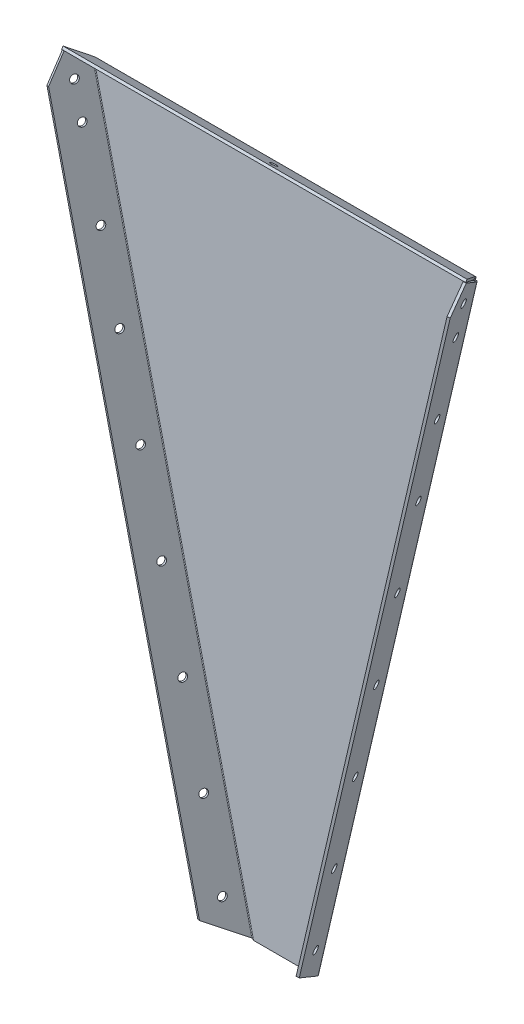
ISO-10303-21;
HEADER;
FILE_DESCRIPTION(('STEP AP214'),'2;1');
FILE_NAME('part.step','',(''),(''),'','','');
FILE_SCHEMA(('AUTOMOTIVE_DESIGN { 1 0 10303 214 1 1 1 1 }'));
ENDSEC;
DATA;
#1=APPLICATION_CONTEXT('core data for automotive mechanical design processes');
#2=APPLICATION_PROTOCOL_DEFINITION('international standard','automotive_design',2000,#1);
#3=PRODUCT_CONTEXT('',#1,'mechanical');
#4=PRODUCT('Part','Part','',(#3));
#5=PRODUCT_RELATED_PRODUCT_CATEGORY('part','',(#4));
#6=PRODUCT_DEFINITION_FORMATION('','',#4);
#7=PRODUCT_DEFINITION_CONTEXT('part definition',#1,'design');
#8=PRODUCT_DEFINITION('design','',#6,#7);
#9=PRODUCT_DEFINITION_SHAPE('','',#8);
#10=(LENGTH_UNIT() NAMED_UNIT(*) SI_UNIT(.MILLI.,.METRE.));
#11=(NAMED_UNIT(*) PLANE_ANGLE_UNIT() SI_UNIT($,.RADIAN.));
#12=(NAMED_UNIT(*) SI_UNIT($,.STERADIAN.) SOLID_ANGLE_UNIT());
#13=UNCERTAINTY_MEASURE_WITH_UNIT(LENGTH_MEASURE(1.E-05),#10,'distance_accuracy_value','');
#14=(GEOMETRIC_REPRESENTATION_CONTEXT(3) GLOBAL_UNCERTAINTY_ASSIGNED_CONTEXT((#13)) GLOBAL_UNIT_ASSIGNED_CONTEXT((#10,
#11,#12)) REPRESENTATION_CONTEXT('',''));
#15=CARTESIAN_POINT('',(0.,0.,0.));
#16=DIRECTION('',(0.,0.,1.));
#17=DIRECTION('',(1.,0.,0.));
#18=AXIS2_PLACEMENT_3D('',#15,#16,#17);
#19=CARTESIAN_POINT('',(111.918750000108,-4.44089209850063E-13,0.));
#20=DIRECTION('',(0.,0.,1.));
#21=DIRECTION('',(1.,0.,0.));
#22=AXIS2_PLACEMENT_3D('',#19,#20,#21);
#23=PLANE('',#22);
#24=DIRECTION('',(0.227248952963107,0.973836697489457,0.));
#25=VECTOR('',#24,1.);
#26=CARTESIAN_POINT('',(700.326291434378,2521.52033906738,0.));
#27=LINE('',#26,#25);
#28=CARTESIAN_POINT('',(700.326291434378,2521.52033906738,-7.6292651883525E-08));
#29=VERTEX_POINT('',#28);
#30=CARTESIAN_POINT('',(701.674999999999,2527.3,0.));
#31=VERTEX_POINT('',#30);
#32=EDGE_CURVE('E1020',#29,#31,#27,.T.);
#33=ORIENTED_EDGE('',*,*,#32,.T.);
#34=DIRECTION('',(-1.,0.,0.));
#35=VECTOR('',#34,1.);
#36=CARTESIAN_POINT('',(111.918750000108,2527.3,0.));
#37=LINE('',#36,#35);
#38=CARTESIAN_POINT('',(-701.674999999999,2527.3,-1.76909242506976E-06));
#39=VERTEX_POINT('',#38);
#40=EDGE_CURVE('E1393',#31,#39,#37,.T.);
#41=ORIENTED_EDGE('',*,*,#40,.T.);
#42=DIRECTION('',(0.227248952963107,-0.973836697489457,0.));
#43=VECTOR('',#42,1.);
#44=CARTESIAN_POINT('',(-700.326291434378,2521.52033906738,0.));
#45=LINE('',#44,#43);
#46=CARTESIAN_POINT('',(-700.326291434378,2521.52033906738,0.));
#47=VERTEX_POINT('',#46);
#48=EDGE_CURVE('E1027',#39,#47,#45,.T.);
#49=ORIENTED_EDGE('',*,*,#48,.T.);
#50=DIRECTION('',(-0.227248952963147,0.973836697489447,0.));
#51=VECTOR('',#50,1.);
#52=CARTESIAN_POINT('',(-100.359314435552,-49.5359930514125,0.));
#53=LINE('',#52,#51);
#54=CARTESIAN_POINT('',(-111.91875,-1.77002847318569E-13,-7.62926527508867E-08));
#55=VERTEX_POINT('',#54);
#56=EDGE_CURVE('E1160',#55,#47,#53,.T.);
#57=ORIENTED_EDGE('',*,*,#56,.F.);
#58=DIRECTION('',(1.,0.,0.));
#59=VECTOR('',#58,1.);
#60=CARTESIAN_POINT('',(-111.91875,0.,0.));
#61=LINE('',#60,#59);
#62=CARTESIAN_POINT('',(111.91875,0.,0.));
#63=VERTEX_POINT('',#62);
#64=EDGE_CURVE('E1033',#55,#63,#61,.T.);
#65=ORIENTED_EDGE('',*,*,#64,.T.);
#66=DIRECTION('',(0.227248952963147,0.973836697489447,0.));
#67=VECTOR('',#66,1.);
#68=CARTESIAN_POINT('',(111.918750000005,2.37511949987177E-11,0.));
#69=LINE('',#68,#67);
#70=EDGE_CURVE('E1028',#63,#29,#69,.T.);
#71=ORIENTED_EDGE('',*,*,#70,.T.);
#72=EDGE_LOOP('',(#33,#41,#49,#57,#65,#71));
#73=FACE_BOUND('',#72,.T.);
#74=ADVANCED_FACE('F410',(#73),#23,.T.);
#75=CARTESIAN_POINT('',(111.918750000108,-4.44089209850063E-13,-9.525));
#76=DIRECTION('',(0.,0.,1.));
#77=DIRECTION('',(1.,0.,0.));
#78=AXIS2_PLACEMENT_3D('',#75,#76,#77);
#79=PLANE('',#78);
#80=DIRECTION('',(-1.,0.,0.));
#81=VECTOR('',#80,1.);
#82=CARTESIAN_POINT('',(111.918750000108,2527.3,-9.525));
#83=LINE('',#82,#81);
#84=CARTESIAN_POINT('',(701.674999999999,2527.3,-9.525));
#85=VERTEX_POINT('',#84);
#86=CARTESIAN_POINT('',(-701.674999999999,2527.3,-9.525));
#87=VERTEX_POINT('',#86);
#88=EDGE_CURVE('E421',#85,#87,#83,.T.);
#89=ORIENTED_EDGE('',*,*,#88,.F.);
#90=DIRECTION('',(0.227248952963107,0.973836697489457,0.));
#91=VECTOR('',#90,1.);
#92=CARTESIAN_POINT('',(700.326291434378,2521.52033906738,-9.525));
#93=LINE('',#92,#91);
#94=CARTESIAN_POINT('',(700.326291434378,2521.52033906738,-9.525));
#95=VERTEX_POINT('',#94);
#96=EDGE_CURVE('E436',#95,#85,#93,.T.);
#97=ORIENTED_EDGE('',*,*,#96,.F.);
#98=DIRECTION('',(0.227248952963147,0.973836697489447,0.));
#99=VECTOR('',#98,1.);
#100=CARTESIAN_POINT('',(111.918750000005,2.37546298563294E-11,-9.525));
#101=LINE('',#100,#99);
#102=CARTESIAN_POINT('',(111.91875,0.,-9.525));
#103=VERTEX_POINT('',#102);
#104=EDGE_CURVE('E1040',#103,#95,#101,.T.);
#105=ORIENTED_EDGE('',*,*,#104,.F.);
#106=DIRECTION('',(1.,0.,0.));
#107=VECTOR('',#106,1.);
#108=CARTESIAN_POINT('',(-111.91875,0.,-9.525));
#109=LINE('',#108,#107);
#110=CARTESIAN_POINT('',(-111.91875,0.,-9.525));
#111=VERTEX_POINT('',#110);
#112=EDGE_CURVE('E1230',#111,#103,#109,.T.);
#113=ORIENTED_EDGE('',*,*,#112,.F.);
#114=DIRECTION('',(-0.227248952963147,0.973836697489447,0.));
#115=VECTOR('',#114,1.);
#116=CARTESIAN_POINT('',(-100.359314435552,-49.5359930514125,-9.525));
#117=LINE('',#116,#115);
#118=CARTESIAN_POINT('',(-700.326291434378,2521.52033906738,-9.525));
#119=VERTEX_POINT('',#118);
#120=EDGE_CURVE('E1436',#111,#119,#117,.T.);
#121=ORIENTED_EDGE('',*,*,#120,.T.);
#122=DIRECTION('',(0.227248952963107,-0.973836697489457,0.));
#123=VECTOR('',#122,1.);
#124=CARTESIAN_POINT('',(-700.326291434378,2521.52033906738,-9.525));
#125=LINE('',#124,#123);
#126=EDGE_CURVE('E428',#87,#119,#125,.T.);
#127=ORIENTED_EDGE('',*,*,#126,.F.);
#128=EDGE_LOOP('',(#89,#97,#105,#113,#121,#127));
#129=FACE_BOUND('',#128,.T.);
#130=ADVANCED_FACE('F412',(#129),#79,.F.);
#131=CARTESIAN_POINT('',(120.866642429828,-2.08802891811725,-10.2093188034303));
#132=DIRECTION('',(-0.931284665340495,0.217319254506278,0.292371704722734));
#133=DIRECTION('',(0.32891510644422,0.156600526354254,0.931284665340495));
#134=AXIS2_PLACEMENT_3D('',#131,#132,#133);
#135=PLANE('',#134);
#136=CARTESIAN_POINT('',(175.839231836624,141.578293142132,58.1067022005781));
#137=DIRECTION('',(-0.931284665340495,0.217319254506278,0.292371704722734));
#138=DIRECTION('',(0.32891510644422,0.156600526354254,0.931284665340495));
#139=AXIS2_PLACEMENT_3D('',#136,#137,#138);
#140=CIRCLE('',#139,14.2875);
#141=CARTESIAN_POINT('',(180.538606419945,143.815723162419,71.4124318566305));
#142=VERTEX_POINT('',#141);
#143=EDGE_CURVE('E1279',#142,#142,#140,.T.);
#144=ORIENTED_EDGE('',*,*,#143,.T.);
#145=EDGE_LOOP('',(#144));
#146=FACE_BOUND('',#145,.T.);
#147=CARTESIAN_POINT('',(245.104712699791,438.403718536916,58.1067022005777));
#148=DIRECTION('',(-0.931284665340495,0.217319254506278,0.292371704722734));
#149=DIRECTION('',(0.32891510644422,0.156600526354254,0.931284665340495));
#150=AXIS2_PLACEMENT_3D('',#147,#148,#149);
#151=CIRCLE('',#150,14.2875);
#152=CARTESIAN_POINT('',(249.804087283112,440.641148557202,71.41243185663));
#153=VERTEX_POINT('',#152);
#154=EDGE_CURVE('E1273',#153,#153,#151,.T.);
#155=ORIENTED_EDGE('',*,*,#154,.T.);
#156=EDGE_LOOP('',(#155));
#157=FACE_BOUND('',#156,.T.);
#158=CARTESIAN_POINT('',(323.028378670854,772.332322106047,58.1067022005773));
#159=DIRECTION('',(-0.931284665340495,0.217319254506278,0.292371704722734));
#160=DIRECTION('',(0.32891510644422,0.156600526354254,0.931284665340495));
#161=AXIS2_PLACEMENT_3D('',#158,#159,#160);
#162=CIRCLE('',#161,14.2875);
#163=CARTESIAN_POINT('',(327.727753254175,774.569752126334,71.4124318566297));
#164=VERTEX_POINT('',#163);
#165=EDGE_CURVE('E1267',#164,#164,#162,.T.);
#166=ORIENTED_EDGE('',*,*,#165,.T.);
#167=EDGE_LOOP('',(#166));
#168=FACE_BOUND('',#167,.T.);
#169=CARTESIAN_POINT('',(400.952044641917,1106.26092567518,58.1067022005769));
#170=DIRECTION('',(-0.931284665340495,0.217319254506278,0.292371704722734));
#171=DIRECTION('',(0.32891510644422,0.156600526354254,0.931284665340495));
#172=AXIS2_PLACEMENT_3D('',#169,#170,#171);
#173=CIRCLE('',#172,14.2875);
#174=CARTESIAN_POINT('',(405.651419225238,1108.49835569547,71.4124318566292));
#175=VERTEX_POINT('',#174);
#176=EDGE_CURVE('E1261',#175,#175,#173,.T.);
#177=ORIENTED_EDGE('',*,*,#176,.T.);
#178=EDGE_LOOP('',(#177));
#179=FACE_BOUND('',#178,.T.);
#180=CARTESIAN_POINT('',(478.87571061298,1440.18952924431,58.1067022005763));
#181=DIRECTION('',(-0.931284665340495,0.217319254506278,0.292371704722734));
#182=DIRECTION('',(0.32891510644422,0.156600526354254,0.931284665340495));
#183=AXIS2_PLACEMENT_3D('',#180,#181,#182);
#184=CIRCLE('',#183,14.2875);
#185=CARTESIAN_POINT('',(483.575085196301,1442.4269592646,71.4124318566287));
#186=VERTEX_POINT('',#185);
#187=EDGE_CURVE('E1255',#186,#186,#184,.T.);
#188=ORIENTED_EDGE('',*,*,#187,.T.);
#189=EDGE_LOOP('',(#188));
#190=FACE_BOUND('',#189,.T.);
#191=CARTESIAN_POINT('',(556.799376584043,1774.11813281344,58.1067022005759));
#192=DIRECTION('',(-0.931284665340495,0.217319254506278,0.292371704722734));
#193=DIRECTION('',(0.32891510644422,0.156600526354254,0.931284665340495));
#194=AXIS2_PLACEMENT_3D('',#191,#192,#193);
#195=CIRCLE('',#194,14.2875);
#196=CARTESIAN_POINT('',(561.498751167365,1776.35556283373,71.4124318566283));
#197=VERTEX_POINT('',#196);
#198=EDGE_CURVE('E1249',#197,#197,#195,.T.);
#199=ORIENTED_EDGE('',*,*,#198,.T.);
#200=EDGE_LOOP('',(#199));
#201=FACE_BOUND('',#200,.T.);
#202=CARTESIAN_POINT('',(626.06485744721,2070.94355820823,58.1067022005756));
#203=DIRECTION('',(-0.931284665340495,0.217319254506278,0.292371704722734));
#204=DIRECTION('',(0.32891510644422,0.156600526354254,0.931284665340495));
#205=AXIS2_PLACEMENT_3D('',#202,#203,#204);
#206=CIRCLE('',#205,14.2875000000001);
#207=CARTESIAN_POINT('',(630.764232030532,2073.18098822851,71.412431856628));
#208=VERTEX_POINT('',#207);
#209=EDGE_CURVE('E1243',#208,#208,#206,.T.);
#210=ORIENTED_EDGE('',*,*,#209,.T.);
#211=EDGE_LOOP('',(#210));
#212=FACE_BOUND('',#211,.T.);
#213=CARTESIAN_POINT('',(695.330338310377,2367.76898360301,58.1067022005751));
#214=DIRECTION('',(-0.931284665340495,0.217319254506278,0.292371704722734));
#215=DIRECTION('',(0.32891510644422,0.156600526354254,0.931284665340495));
#216=AXIS2_PLACEMENT_3D('',#213,#214,#215);
#217=CIRCLE('',#216,14.2875000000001);
#218=CARTESIAN_POINT('',(700.029712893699,2370.0064136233,71.4124318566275));
#219=VERTEX_POINT('',#218);
#220=EDGE_CURVE('E1237',#219,#219,#217,.T.);
#221=ORIENTED_EDGE('',*,*,#220,.T.);
#222=EDGE_LOOP('',(#221));
#223=FACE_BOUND('',#222,.T.);
#224=CARTESIAN_POINT('',(724.190955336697,2491.44624418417,58.1067022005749));
#225=DIRECTION('',(-0.931284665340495,0.217319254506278,0.292371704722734));
#226=DIRECTION('',(0.32891510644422,0.156600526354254,0.931284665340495));
#227=AXIS2_PLACEMENT_3D('',#224,#225,#226);
#228=CIRCLE('',#227,14.2875000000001);
#229=CARTESIAN_POINT('',(728.890329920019,2493.68367420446,71.4124318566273));
#230=VERTEX_POINT('',#229);
#231=EDGE_CURVE('E1222',#230,#230,#228,.T.);
#232=ORIENTED_EDGE('',*,*,#231,.T.);
#233=EDGE_LOOP('',(#232));
#234=FACE_BOUND('',#233,.T.);
#235=DIRECTION('',(0.364079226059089,0.527789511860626,0.767388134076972));
#236=VECTOR('',#235,1.);
#237=CARTESIAN_POINT('',(120.866642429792,-2.08802891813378,-10.2093188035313));
#238=LINE('',#237,#236);
#239=CARTESIAN_POINT('',(125.455040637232,4.56356852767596,-0.538120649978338));
#240=VERTEX_POINT('',#239);
#241=CARTESIAN_POINT('',(187.851064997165,95.01631859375,130.977124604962));
#242=VERTEX_POINT('',#241);
#243=EDGE_CURVE('E1140',#240,#242,#238,.T.);
#244=ORIENTED_EDGE('',*,*,#243,.F.);
#245=DIRECTION('',(0.227248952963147,0.973836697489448,0.));
#246=VECTOR('',#245,1.);
#247=CARTESIAN_POINT('',(123.746065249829,-2.75995453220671,-0.538120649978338));
#248=LINE('',#247,#246);
#249=CARTESIAN_POINT('',(713.862582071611,2526.08390759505,-0.538120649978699));
#250=VERTEX_POINT('',#249);
#251=EDGE_CURVE('E1128',#240,#250,#248,.T.);
#252=ORIENTED_EDGE('',*,*,#251,.T.);
#253=DIRECTION('',(-0.364079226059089,-0.52778951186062,-0.767388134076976));
#254=VECTOR('',#253,1.);
#255=CARTESIAN_POINT('',(709.274183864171,2519.43231014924,-10.2093188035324));
#256=LINE('',#255,#254);
#257=CARTESIAN_POINT('',(748.57653631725,2576.4071879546,72.6302302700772));
#258=VERTEX_POINT('',#257);
#259=EDGE_CURVE('E1146',#258,#250,#256,.T.);
#260=ORIENTED_EDGE('',*,*,#259,.F.);
#261=DIRECTION('',(0.0124574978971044,0.821103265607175,-0.570643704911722));
#262=VECTOR('',#261,1.);
#263=CARTESIAN_POINT('',(748.57653631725,2576.4071879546,72.6302302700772));
#264=LINE('',#263,#262);
#265=CARTESIAN_POINT('',(747.302788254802,2492.45142875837,130.97712460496));
#266=VERTEX_POINT('',#265);
#267=EDGE_CURVE('E1149',#266,#258,#264,.T.);
#268=ORIENTED_EDGE('',*,*,#267,.F.);
#269=DIRECTION('',(0.227248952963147,0.973836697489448,0.));
#270=VECTOR('',#269,1.);
#271=CARTESIAN_POINT('',(747.302788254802,2492.45142875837,130.97712460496));
#272=LINE('',#271,#270);
#273=EDGE_CURVE('E1142',#242,#266,#272,.T.);
#274=ORIENTED_EDGE('',*,*,#273,.F.);
#275=EDGE_LOOP('',(#244,#252,#260,#268,#274));
#276=FACE_BOUND('',#275,.T.);
#277=ADVANCED_FACE('F1111',(#146,#157,#168,#179,#190,#201,#212,#223,#234,#276),#135,.F.);
#278=CARTESIAN_POINT('',(111.99615599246,-0.0180630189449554,-7.42447831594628));
#279=DIRECTION('',(-0.931284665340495,0.217319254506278,0.292371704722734));
#280=DIRECTION('',(0.32891510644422,0.156600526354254,0.931284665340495));
#281=AXIS2_PLACEMENT_3D('',#278,#279,#280);
#282=PLANE('',#281);
#283=DIRECTION('',(0.227248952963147,0.973836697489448,0.));
#284=VECTOR('',#283,1.);
#285=CARTESIAN_POINT('',(114.875578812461,-0.689988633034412,2.2467198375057));
#286=LINE('',#285,#284);
#287=CARTESIAN_POINT('',(116.584554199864,6.63353442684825,2.2467198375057));
#288=VERTEX_POINT('',#287);
#289=CARTESIAN_POINT('',(704.992095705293,2528.15387347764,2.24671981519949));
#290=VERTEX_POINT('',#289);
#291=EDGE_CURVE('E1295',#288,#290,#286,.T.);
#292=ORIENTED_EDGE('',*,*,#291,.F.);
#293=DIRECTION('',(0.364079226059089,0.527789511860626,0.767388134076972));
#294=VECTOR('',#293,1.);
#295=CARTESIAN_POINT('',(111.996155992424,-0.0180630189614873,-7.42447831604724));
#296=LINE('',#295,#294);
#297=CARTESIAN_POINT('',(178.980578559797,97.0862844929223,133.761965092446));
#298=VERTEX_POINT('',#297);
#299=EDGE_CURVE('E1282',#288,#298,#296,.T.);
#300=ORIENTED_EDGE('',*,*,#299,.T.);
#301=DIRECTION('',(0.227248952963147,0.973836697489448,0.));
#302=VECTOR('',#301,1.);
#303=CARTESIAN_POINT('',(738.432301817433,2494.52139465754,133.761965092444));
#304=LINE('',#303,#302);
#305=CARTESIAN_POINT('',(738.432301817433,2494.52139465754,133.761965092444));
#306=VERTEX_POINT('',#305);
#307=EDGE_CURVE('E1283',#298,#306,#304,.T.);
#308=ORIENTED_EDGE('',*,*,#307,.T.);
#309=DIRECTION('',(0.0124574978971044,0.821103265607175,-0.570643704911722));
#310=VECTOR('',#309,1.);
#311=CARTESIAN_POINT('',(739.706049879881,2578.47715385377,75.4150707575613));
#312=LINE('',#311,#310);
#313=CARTESIAN_POINT('',(739.706049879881,2578.47715385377,75.4150707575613));
#314=VERTEX_POINT('',#313);
#315=EDGE_CURVE('E1286',#306,#314,#312,.T.);
#316=ORIENTED_EDGE('',*,*,#315,.T.);
#317=DIRECTION('',(-0.364079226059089,-0.52778951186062,-0.767388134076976));
#318=VECTOR('',#317,1.);
#319=CARTESIAN_POINT('',(700.403697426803,2521.50227604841,-7.42447831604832));
#320=LINE('',#319,#318);
#321=EDGE_CURVE('E1143',#314,#290,#320,.T.);
#322=ORIENTED_EDGE('',*,*,#321,.T.);
#323=EDGE_LOOP('',(#292,#300,#308,#316,#322));
#324=FACE_BOUND('',#323,.T.);
#325=CARTESIAN_POINT('',(166.968745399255,143.648259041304,60.8915426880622));
#326=DIRECTION('',(-0.931284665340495,0.217319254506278,0.292371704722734));
#327=DIRECTION('',(0.32891510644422,0.156600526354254,0.931284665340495));
#328=AXIS2_PLACEMENT_3D('',#325,#326,#327);
#329=CIRCLE('',#328,14.2875);
#330=CARTESIAN_POINT('',(171.668119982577,145.885689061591,74.1972723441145));
#331=VERTEX_POINT('',#330);
#332=EDGE_CURVE('E1276',#331,#331,#329,.T.);
#333=ORIENTED_EDGE('',*,*,#332,.F.);
#334=EDGE_LOOP('',(#333));
#335=FACE_BOUND('',#334,.T.);
#336=CARTESIAN_POINT('',(236.234226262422,440.473684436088,60.8915426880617));
#337=DIRECTION('',(-0.931284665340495,0.217319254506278,0.292371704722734));
#338=DIRECTION('',(0.32891510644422,0.156600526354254,0.931284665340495));
#339=AXIS2_PLACEMENT_3D('',#336,#337,#338);
#340=CIRCLE('',#339,14.2875);
#341=CARTESIAN_POINT('',(240.933600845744,442.711114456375,74.1972723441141));
#342=VERTEX_POINT('',#341);
#343=EDGE_CURVE('E1270',#342,#342,#340,.T.);
#344=ORIENTED_EDGE('',*,*,#343,.F.);
#345=EDGE_LOOP('',(#344));
#346=FACE_BOUND('',#345,.T.);
#347=CARTESIAN_POINT('',(314.157892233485,774.40228800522,60.8915426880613));
#348=DIRECTION('',(-0.931284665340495,0.217319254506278,0.292371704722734));
#349=DIRECTION('',(0.32891510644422,0.156600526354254,0.931284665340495));
#350=AXIS2_PLACEMENT_3D('',#347,#348,#349);
#351=CIRCLE('',#350,14.2875);
#352=CARTESIAN_POINT('',(318.857266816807,776.639718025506,74.1972723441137));
#353=VERTEX_POINT('',#352);
#354=EDGE_CURVE('E1264',#353,#353,#351,.T.);
#355=ORIENTED_EDGE('',*,*,#354,.F.);
#356=EDGE_LOOP('',(#355));
#357=FACE_BOUND('',#356,.T.);
#358=CARTESIAN_POINT('',(392.081558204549,1108.33089157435,60.8915426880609));
#359=DIRECTION('',(-0.931284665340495,0.217319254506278,0.292371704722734));
#360=DIRECTION('',(0.32891510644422,0.156600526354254,0.931284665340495));
#361=AXIS2_PLACEMENT_3D('',#358,#359,#360);
#362=CIRCLE('',#361,14.2875);
#363=CARTESIAN_POINT('',(396.78093278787,1110.56832159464,74.1972723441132));
#364=VERTEX_POINT('',#363);
#365=EDGE_CURVE('E1258',#364,#364,#362,.T.);
#366=ORIENTED_EDGE('',*,*,#365,.F.);
#367=EDGE_LOOP('',(#366));
#368=FACE_BOUND('',#367,.T.);
#369=CARTESIAN_POINT('',(470.005224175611,1442.25949514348,60.8915426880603));
#370=DIRECTION('',(-0.931284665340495,0.217319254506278,0.292371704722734));
#371=DIRECTION('',(0.32891510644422,0.156600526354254,0.931284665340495));
#372=AXIS2_PLACEMENT_3D('',#369,#370,#371);
#373=CIRCLE('',#372,14.2875);
#374=CARTESIAN_POINT('',(474.704598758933,1444.49692516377,74.1972723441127));
#375=VERTEX_POINT('',#374);
#376=EDGE_CURVE('E1252',#375,#375,#373,.T.);
#377=ORIENTED_EDGE('',*,*,#376,.F.);
#378=EDGE_LOOP('',(#377));
#379=FACE_BOUND('',#378,.T.);
#380=CARTESIAN_POINT('',(547.928890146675,1776.18809871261,60.8915426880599));
#381=DIRECTION('',(-0.931284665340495,0.217319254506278,0.292371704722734));
#382=DIRECTION('',(0.32891510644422,0.156600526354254,0.931284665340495));
#383=AXIS2_PLACEMENT_3D('',#380,#381,#382);
#384=CIRCLE('',#383,14.2875);
#385=CARTESIAN_POINT('',(552.628264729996,1778.4255287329,74.1972723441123));
#386=VERTEX_POINT('',#385);
#387=EDGE_CURVE('E1246',#386,#386,#384,.T.);
#388=ORIENTED_EDGE('',*,*,#387,.F.);
#389=EDGE_LOOP('',(#388));
#390=FACE_BOUND('',#389,.T.);
#391=CARTESIAN_POINT('',(617.194371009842,2073.0135241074,60.8915426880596));
#392=DIRECTION('',(-0.931284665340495,0.217319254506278,0.292371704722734));
#393=DIRECTION('',(0.32891510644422,0.156600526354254,0.931284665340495));
#394=AXIS2_PLACEMENT_3D('',#391,#392,#393);
#395=CIRCLE('',#394,14.2875000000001);
#396=CARTESIAN_POINT('',(621.893745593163,2075.25095412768,74.197272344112));
#397=VERTEX_POINT('',#396);
#398=EDGE_CURVE('E1240',#397,#397,#395,.T.);
#399=ORIENTED_EDGE('',*,*,#398,.F.);
#400=EDGE_LOOP('',(#399));
#401=FACE_BOUND('',#400,.T.);
#402=CARTESIAN_POINT('',(686.459851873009,2369.83894950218,60.8915426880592));
#403=DIRECTION('',(-0.931284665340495,0.217319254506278,0.292371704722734));
#404=DIRECTION('',(0.32891510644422,0.156600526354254,0.931284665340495));
#405=AXIS2_PLACEMENT_3D('',#402,#403,#404);
#406=CIRCLE('',#405,14.2875000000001);
#407=CARTESIAN_POINT('',(691.159226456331,2372.07637952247,74.1972723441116));
#408=VERTEX_POINT('',#407);
#409=EDGE_CURVE('E1228',#408,#408,#406,.T.);
#410=ORIENTED_EDGE('',*,*,#409,.F.);
#411=EDGE_LOOP('',(#410));
#412=FACE_BOUND('',#411,.T.);
#413=CARTESIAN_POINT('',(715.320468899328,2493.51621008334,60.8915426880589));
#414=DIRECTION('',(-0.931284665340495,0.217319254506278,0.292371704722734));
#415=DIRECTION('',(0.32891510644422,0.156600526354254,0.931284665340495));
#416=AXIS2_PLACEMENT_3D('',#413,#414,#415);
#417=CIRCLE('',#416,14.2875000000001);
#418=CARTESIAN_POINT('',(720.01984348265,2495.75364010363,74.1972723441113));
#419=VERTEX_POINT('',#418);
#420=EDGE_CURVE('E1225',#419,#419,#417,.T.);
#421=ORIENTED_EDGE('',*,*,#420,.F.);
#422=EDGE_LOOP('',(#421));
#423=FACE_BOUND('',#422,.T.);
#424=ADVANCED_FACE('F1172',(#324,#335,#346,#357,#368,#379,#390,#401,#412,#423),#282,.T.);
#425=CARTESIAN_POINT('',(709.274183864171,2519.43231014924,-10.2093188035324));
#426=DIRECTION('',(0.0124574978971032,0.821103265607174,-0.570643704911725));
#427=DIRECTION('',(-0.364079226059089,-0.52778951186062,-0.767388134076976));
#428=AXIS2_PLACEMENT_3D('',#425,#426,#427);
#429=PLANE('',#428);
#430=CARTESIAN_POINT('',(704.992095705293,2528.15387347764,2.24671981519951));
#431=CARTESIAN_POINT('',(713.862582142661,2526.08390757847,-0.53812067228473));
#432=B_SPLINE_CURVE_WITH_KNOTS('',1,(#430,#431),.UNSPECIFIED.,.F.,.F.,(2,2),(0.,1.),.UNSPECIFIED.);
#433=EDGE_CURVE('E1137',#290,#250,#432,.T.);
#434=ORIENTED_EDGE('',*,*,#433,.F.);
#435=ORIENTED_EDGE('',*,*,#321,.F.);
#436=DIRECTION('',(-0.931284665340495,0.217319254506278,0.292371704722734));
#437=VECTOR('',#436,1.);
#438=CARTESIAN_POINT('',(748.57653631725,2576.4071879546,72.6302302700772));
#439=LINE('',#438,#437);
#440=EDGE_CURVE('E1293',#258,#314,#439,.T.);
#441=ORIENTED_EDGE('',*,*,#440,.F.);
#442=ORIENTED_EDGE('',*,*,#259,.T.);
#443=EDGE_LOOP('',(#434,#435,#441,#442));
#444=FACE_BOUND('',#443,.T.);
#445=ADVANCED_FACE('F1162',(#444),#429,.T.);
#446=CARTESIAN_POINT('',(748.57653631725,2576.4071879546,72.6302302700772));
#447=DIRECTION('',(0.364079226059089,0.527789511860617,0.767388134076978));
#448=DIRECTION('',(0.0124574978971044,0.821103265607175,-0.570643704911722));
#449=AXIS2_PLACEMENT_3D('',#446,#447,#448);
#450=PLANE('',#449);
#451=ORIENTED_EDGE('',*,*,#315,.F.);
#452=DIRECTION('',(-0.931284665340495,0.217319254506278,0.292371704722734));
#453=VECTOR('',#452,1.);
#454=CARTESIAN_POINT('',(747.302788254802,2492.45142875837,130.97712460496));
#455=LINE('',#454,#453);
#456=EDGE_CURVE('E1296',#266,#306,#455,.T.);
#457=ORIENTED_EDGE('',*,*,#456,.F.);
#458=ORIENTED_EDGE('',*,*,#267,.T.);
#459=ORIENTED_EDGE('',*,*,#440,.T.);
#460=EDGE_LOOP('',(#451,#457,#458,#459));
#461=FACE_BOUND('',#460,.T.);
#462=ADVANCED_FACE('F1171',(#461),#450,.T.);
#463=CARTESIAN_POINT('',(747.302788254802,2492.45142875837,130.97712460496));
#464=DIRECTION('',(0.284722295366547,-0.0664411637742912,0.956304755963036));
#465=DIRECTION('',(0.227248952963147,0.973836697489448,0.));
#466=AXIS2_PLACEMENT_3D('',#463,#464,#465);
#467=PLANE('',#466);
#468=ORIENTED_EDGE('',*,*,#307,.F.);
#469=DIRECTION('',(-0.931284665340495,0.217319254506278,0.292371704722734));
#470=VECTOR('',#469,1.);
#471=CARTESIAN_POINT('',(187.851064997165,95.01631859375,130.977124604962));
#472=LINE('',#471,#470);
#473=EDGE_CURVE('E1148',#242,#298,#472,.T.);
#474=ORIENTED_EDGE('',*,*,#473,.F.);
#475=ORIENTED_EDGE('',*,*,#273,.T.);
#476=ORIENTED_EDGE('',*,*,#456,.T.);
#477=EDGE_LOOP('',(#468,#474,#475,#476));
#478=FACE_BOUND('',#477,.T.);
#479=ADVANCED_FACE('F1118',(#478),#467,.T.);
#480=CARTESIAN_POINT('',(120.866642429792,-2.08802891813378,-10.2093188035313));
#481=DIRECTION('',(-0.0124574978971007,-0.82110326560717,0.57064370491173));
#482=DIRECTION('',(0.364079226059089,0.527789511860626,0.767388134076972));
#483=AXIS2_PLACEMENT_3D('',#480,#481,#482);
#484=PLANE('',#483);
#485=CARTESIAN_POINT('',(125.455040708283,4.56356851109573,-0.538120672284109));
#486=CARTESIAN_POINT('',(116.584554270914,6.63353441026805,2.24671981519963));
#487=B_SPLINE_CURVE_WITH_KNOTS('',1,(#485,#486),.UNSPECIFIED.,.F.,.F.,(2,2),(0.,1.),.UNSPECIFIED.);
#488=EDGE_CURVE('E1136',#240,#288,#487,.T.);
#489=ORIENTED_EDGE('',*,*,#488,.F.);
#490=ORIENTED_EDGE('',*,*,#243,.T.);
#491=ORIENTED_EDGE('',*,*,#473,.T.);
#492=ORIENTED_EDGE('',*,*,#299,.F.);
#493=EDGE_LOOP('',(#489,#490,#491,#492));
#494=FACE_BOUND('',#493,.T.);
#495=ADVANCED_FACE('F1113',(#494),#484,.T.);
#496=CARTESIAN_POINT('',(175.839231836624,141.578293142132,58.1067022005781));
#497=DIRECTION('',(-0.931284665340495,0.217319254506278,0.292371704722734));
#498=DIRECTION('',(0.32891510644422,0.156600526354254,0.931284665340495));
#499=AXIS2_PLACEMENT_3D('',#496,#497,#498);
#500=CYLINDRICAL_SURFACE('',#499,14.2875);
#501=CARTESIAN_POINT('',(180.538606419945,143.815723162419,71.4124318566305));
#502=CARTESIAN_POINT('',(180.446205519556,143.837285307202,71.4414406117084));
#503=CARTESIAN_POINT('',(180.353804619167,143.858847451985,71.4704493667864));
#504=CARTESIAN_POINT('',(180.169002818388,143.901971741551,71.5284668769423));
#505=CARTESIAN_POINT('',(180.076601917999,143.923533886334,71.5574756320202));
#506=CARTESIAN_POINT('',(179.891800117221,143.9666581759,71.6154931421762));
#507=CARTESIAN_POINT('',(179.799399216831,143.988220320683,71.6445018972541));
#508=CARTESIAN_POINT('',(179.614597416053,144.031344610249,71.70251940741));
#509=CARTESIAN_POINT('',(179.522196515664,144.052906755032,71.731528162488));
#510=CARTESIAN_POINT('',(179.337394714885,144.096031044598,71.7895456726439));
#511=CARTESIAN_POINT('',(179.244993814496,144.117593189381,71.8185544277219));
#512=CARTESIAN_POINT('',(179.060192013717,144.160717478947,71.8765719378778));
#513=CARTESIAN_POINT('',(178.967791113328,144.18227962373,71.9055806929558));
#514=CARTESIAN_POINT('',(178.78298931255,144.225403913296,71.9635982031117));
#515=CARTESIAN_POINT('',(178.69058841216,144.246966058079,71.9926069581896));
#516=CARTESIAN_POINT('',(178.505786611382,144.290090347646,72.0506244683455));
#517=CARTESIAN_POINT('',(178.413385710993,144.311652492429,72.0796332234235));
#518=CARTESIAN_POINT('',(178.228583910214,144.354776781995,72.1376507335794));
#519=CARTESIAN_POINT('',(178.136183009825,144.376338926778,72.1666594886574));
#520=CARTESIAN_POINT('',(177.951381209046,144.419463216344,72.2246769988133));
#521=CARTESIAN_POINT('',(177.858980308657,144.441025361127,72.2536857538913));
#522=CARTESIAN_POINT('',(177.674178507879,144.484149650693,72.3117032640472));
#523=CARTESIAN_POINT('',(177.581777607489,144.505711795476,72.3407120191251));
#524=CARTESIAN_POINT('',(177.396975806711,144.548836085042,72.398729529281));
#525=CARTESIAN_POINT('',(177.304574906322,144.570398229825,72.427738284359));
#526=CARTESIAN_POINT('',(177.119773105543,144.613522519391,72.4857557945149));
#527=CARTESIAN_POINT('',(177.027372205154,144.635084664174,72.5147645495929));
#528=CARTESIAN_POINT('',(176.842570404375,144.67820895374,72.5727820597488));
#529=CARTESIAN_POINT('',(176.750169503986,144.699771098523,72.6017908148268));
#530=CARTESIAN_POINT('',(176.565367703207,144.742895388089,72.6598083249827));
#531=CARTESIAN_POINT('',(176.472966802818,144.764457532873,72.6888170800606));
#532=CARTESIAN_POINT('',(176.28816500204,144.807581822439,72.7468345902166));
#533=CARTESIAN_POINT('',(176.19576410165,144.829143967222,72.7758433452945));
#534=CARTESIAN_POINT('',(176.010962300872,144.872268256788,72.8338608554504));
#535=CARTESIAN_POINT('',(175.918561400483,144.893830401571,72.8628696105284));
#536=CARTESIAN_POINT('',(175.733759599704,144.936954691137,72.9208871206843));
#537=CARTESIAN_POINT('',(175.641358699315,144.95851683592,72.9498958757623));
#538=CARTESIAN_POINT('',(175.456556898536,145.001641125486,73.0079133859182));
#539=CARTESIAN_POINT('',(175.364155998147,145.023203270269,73.0369221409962));
#540=CARTESIAN_POINT('',(175.179354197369,145.066327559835,73.0949396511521));
#541=CARTESIAN_POINT('',(175.086953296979,145.087889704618,73.12394840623));
#542=CARTESIAN_POINT('',(174.902151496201,145.131013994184,73.1819659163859));
#543=CARTESIAN_POINT('',(174.809750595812,145.152576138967,73.2109746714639));
#544=CARTESIAN_POINT('',(174.624948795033,145.195700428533,73.2689921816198));
#545=CARTESIAN_POINT('',(174.532547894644,145.217262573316,73.2980009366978));
#546=CARTESIAN_POINT('',(174.347746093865,145.260386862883,73.3560184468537));
#547=CARTESIAN_POINT('',(174.255345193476,145.281949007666,73.3850272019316));
#548=CARTESIAN_POINT('',(174.070543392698,145.325073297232,73.4430447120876));
#549=CARTESIAN_POINT('',(173.978142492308,145.346635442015,73.4720534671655));
#550=CARTESIAN_POINT('',(173.79334069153,145.389759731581,73.5300709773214));
#551=CARTESIAN_POINT('',(173.700939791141,145.411321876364,73.5590797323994));
#552=CARTESIAN_POINT('',(173.516137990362,145.45444616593,73.6170972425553));
#553=CARTESIAN_POINT('',(173.423737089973,145.476008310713,73.6461059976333));
#554=CARTESIAN_POINT('',(173.238935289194,145.519132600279,73.7041235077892));
#555=CARTESIAN_POINT('',(173.146534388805,145.540694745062,73.7331322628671));
#556=CARTESIAN_POINT('',(172.961732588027,145.583819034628,73.7911497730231));
#557=CARTESIAN_POINT('',(172.869331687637,145.605381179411,73.820158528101));
#558=CARTESIAN_POINT('',(172.684529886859,145.648505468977,73.8781760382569));
#559=CARTESIAN_POINT('',(172.59212898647,145.67006761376,73.9071847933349));
#560=CARTESIAN_POINT('',(172.407327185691,145.713191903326,73.9652023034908));
#561=CARTESIAN_POINT('',(172.314926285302,145.73475404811,73.9942110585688));
#562=CARTESIAN_POINT('',(172.130124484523,145.777878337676,74.0522285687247));
#563=CARTESIAN_POINT('',(172.037723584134,145.799440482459,74.0812373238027));
#564=CARTESIAN_POINT('',(171.852921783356,145.842564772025,74.1392548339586));
#565=CARTESIAN_POINT('',(171.760520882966,145.864126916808,74.1682635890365));
#566=CARTESIAN_POINT('',(171.668119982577,145.885689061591,74.1972723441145));
#567=B_SPLINE_CURVE_WITH_KNOTS('',3,(#501,#502,#503,#504,#505,#506,#507,#508,#509,#510,#511,
#512,#513,#514,#515,#516,#517,#518,#519,#520,#521,#522,#523,#524,#525,#526,#527,#528,#529,#530,
#531,#532,#533,#534,#535,#536,#537,#538,#539,#540,#541,#542,#543,#544,#545,#546,#547,#548,#549,
#550,#551,#552,#553,#554,#555,#556,#557,#558,#559,#560,#561,#562,#563,#564,#565,#566),
.UNSPECIFIED.,.F.,.F.,(4,2,2,2,2,2,2,2,2,2,2,2,2,2,2,2,2,2,2,2,2,2,2,2,2,2,2,2,2,2,2,2,4),(0.,
0.297656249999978,0.595312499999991,0.892968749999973,1.19062499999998,1.48828124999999,
1.78593749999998,2.08359374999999,2.38125,2.67890624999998,2.97656249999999,3.27421874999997,
3.57187499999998,3.86953124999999,4.16718749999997,4.46484374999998,4.7625,5.06015624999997,
5.35781249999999,5.65546874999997,5.95312499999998,6.25078124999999,6.54843749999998,
6.84609374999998,7.14374999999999,7.44140624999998,7.73906249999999,8.03671874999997,
8.33437499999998,8.63203124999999,8.92968749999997,9.22734374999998,9.52499999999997),.UNSPECIFIED.);
#568=EDGE_CURVE('BSEAM1117',#142,#331,#567,.T.);
#569=ORIENTED_EDGE('',*,*,#143,.F.);
#570=ORIENTED_EDGE('',*,*,#332,.T.);
#571=ORIENTED_EDGE('',*,*,#568,.T.);
#572=ORIENTED_EDGE('',*,*,#568,.F.);
#573=EDGE_LOOP('',(#569,#571,#570,#572));
#574=FACE_BOUND('',#573,.T.);
#575=ADVANCED_FACE('F1117',(#574),#500,.F.);
#576=CARTESIAN_POINT('',(245.104712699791,438.403718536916,58.1067022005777));
#577=DIRECTION('',(-0.931284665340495,0.217319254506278,0.292371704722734));
#578=DIRECTION('',(0.32891510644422,0.156600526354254,0.931284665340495));
#579=AXIS2_PLACEMENT_3D('',#576,#577,#578);
#580=CYLINDRICAL_SURFACE('',#579,14.2875);
#581=CARTESIAN_POINT('',(249.804087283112,440.641148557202,71.41243185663));
#582=CARTESIAN_POINT('',(249.711686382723,440.662710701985,71.441440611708));
#583=CARTESIAN_POINT('',(249.619285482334,440.684272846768,71.470449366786));
#584=CARTESIAN_POINT('',(249.434483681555,440.727397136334,71.5284668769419));
#585=CARTESIAN_POINT('',(249.342082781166,440.748959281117,71.5574756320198));
#586=CARTESIAN_POINT('',(249.157280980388,440.792083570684,71.6154931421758));
#587=CARTESIAN_POINT('',(249.064880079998,440.813645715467,71.6445018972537));
#588=CARTESIAN_POINT('',(248.88007827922,440.856770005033,71.7025194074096));
#589=CARTESIAN_POINT('',(248.787677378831,440.878332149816,71.7315281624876));
#590=CARTESIAN_POINT('',(248.602875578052,440.921456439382,71.7895456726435));
#591=CARTESIAN_POINT('',(248.510474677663,440.943018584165,71.8185544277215));
#592=CARTESIAN_POINT('',(248.325672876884,440.986142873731,71.8765719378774));
#593=CARTESIAN_POINT('',(248.233271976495,441.007705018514,71.9055806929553));
#594=CARTESIAN_POINT('',(248.048470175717,441.05082930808,71.9635982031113));
#595=CARTESIAN_POINT('',(247.956069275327,441.072391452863,71.9926069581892));
#596=CARTESIAN_POINT('',(247.771267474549,441.115515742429,72.0506244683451));
#597=CARTESIAN_POINT('',(247.67886657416,441.137077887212,72.0796332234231));
#598=CARTESIAN_POINT('',(247.494064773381,441.180202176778,72.137650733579));
#599=CARTESIAN_POINT('',(247.401663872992,441.201764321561,72.166659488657));
#600=CARTESIAN_POINT('',(247.216862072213,441.244888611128,72.2246769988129));
#601=CARTESIAN_POINT('',(247.124461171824,441.266450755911,72.2536857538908));
#602=CARTESIAN_POINT('',(246.939659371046,441.309575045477,72.3117032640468));
#603=CARTESIAN_POINT('',(246.847258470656,441.33113719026,72.3407120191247));
#604=CARTESIAN_POINT('',(246.662456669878,441.374261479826,72.3987295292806));
#605=CARTESIAN_POINT('',(246.570055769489,441.395823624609,72.4277382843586));
#606=CARTESIAN_POINT('',(246.38525396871,441.438947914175,72.4857557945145));
#607=CARTESIAN_POINT('',(246.292853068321,441.460510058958,72.5147645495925));
#608=CARTESIAN_POINT('',(246.108051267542,441.503634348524,72.5727820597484));
#609=CARTESIAN_POINT('',(246.015650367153,441.525196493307,72.6017908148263));
#610=CARTESIAN_POINT('',(245.830848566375,441.568320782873,72.6598083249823));
#611=CARTESIAN_POINT('',(245.738447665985,441.589882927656,72.6888170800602));
#612=CARTESIAN_POINT('',(245.553645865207,441.633007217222,72.7468345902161));
#613=CARTESIAN_POINT('',(245.461244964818,441.654569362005,72.7758433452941));
#614=CARTESIAN_POINT('',(245.276443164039,441.697693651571,72.83386085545));
#615=CARTESIAN_POINT('',(245.18404226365,441.719255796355,72.862869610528));
#616=CARTESIAN_POINT('',(244.999240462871,441.762380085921,72.9208871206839));
#617=CARTESIAN_POINT('',(244.906839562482,441.783942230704,72.9498958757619));
#618=CARTESIAN_POINT('',(244.722037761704,441.82706652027,73.0079133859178));
#619=CARTESIAN_POINT('',(244.629636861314,441.848628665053,73.0369221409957));
#620=CARTESIAN_POINT('',(244.444835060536,441.891752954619,73.0949396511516));
#621=CARTESIAN_POINT('',(244.352434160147,441.913315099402,73.1239484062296));
#622=CARTESIAN_POINT('',(244.167632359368,441.956439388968,73.1819659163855));
#623=CARTESIAN_POINT('',(244.075231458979,441.978001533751,73.2109746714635));
#624=CARTESIAN_POINT('',(243.8904296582,442.021125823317,73.2689921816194));
#625=CARTESIAN_POINT('',(243.798028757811,442.0426879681,73.2980009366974));
#626=CARTESIAN_POINT('',(243.613226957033,442.085812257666,73.3560184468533));
#627=CARTESIAN_POINT('',(243.520826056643,442.107374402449,73.3850272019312));
#628=CARTESIAN_POINT('',(243.336024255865,442.150498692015,73.4430447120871));
#629=CARTESIAN_POINT('',(243.243623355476,442.172060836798,73.4720534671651));
#630=CARTESIAN_POINT('',(243.058821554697,442.215185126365,73.530070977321));
#631=CARTESIAN_POINT('',(242.966420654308,442.236747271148,73.559079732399));
#632=CARTESIAN_POINT('',(242.781618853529,442.279871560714,73.6170972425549));
#633=CARTESIAN_POINT('',(242.68921795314,442.301433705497,73.6461059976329));
#634=CARTESIAN_POINT('',(242.504416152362,442.344557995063,73.7041235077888));
#635=CARTESIAN_POINT('',(242.412015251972,442.366120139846,73.7331322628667));
#636=CARTESIAN_POINT('',(242.227213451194,442.409244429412,73.7911497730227));
#637=CARTESIAN_POINT('',(242.134812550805,442.430806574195,73.8201585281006));
#638=CARTESIAN_POINT('',(241.950010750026,442.473930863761,73.8781760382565));
#639=CARTESIAN_POINT('',(241.857609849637,442.495493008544,73.9071847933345));
#640=CARTESIAN_POINT('',(241.672808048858,442.53861729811,73.9652023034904));
#641=CARTESIAN_POINT('',(241.580407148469,442.560179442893,73.9942110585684));
#642=CARTESIAN_POINT('',(241.395605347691,442.603303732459,74.0522285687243));
#643=CARTESIAN_POINT('',(241.303204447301,442.624865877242,74.0812373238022));
#644=CARTESIAN_POINT('',(241.118402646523,442.667990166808,74.1392548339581));
#645=CARTESIAN_POINT('',(241.026001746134,442.689552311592,74.1682635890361));
#646=CARTESIAN_POINT('',(240.933600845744,442.711114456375,74.1972723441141));
#647=B_SPLINE_CURVE_WITH_KNOTS('',3,(#581,#582,#583,#584,#585,#586,#587,#588,#589,#590,#591,
#592,#593,#594,#595,#596,#597,#598,#599,#600,#601,#602,#603,#604,#605,#606,#607,#608,#609,#610,
#611,#612,#613,#614,#615,#616,#617,#618,#619,#620,#621,#622,#623,#624,#625,#626,#627,#628,#629,
#630,#631,#632,#633,#634,#635,#636,#637,#638,#639,#640,#641,#642,#643,#644,#645,#646),
.UNSPECIFIED.,.F.,.F.,(4,2,2,2,2,2,2,2,2,2,2,2,2,2,2,2,2,2,2,2,2,2,2,2,2,2,2,2,2,2,2,2,4),(0.,
0.297656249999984,0.595312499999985,0.892968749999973,1.19062499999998,1.48828125,
1.78593749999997,2.08359374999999,2.38125,2.67890624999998,2.97656249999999,3.27421874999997,
3.57187499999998,3.86953125,4.16718749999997,4.46484374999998,4.7625,5.06015624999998,
5.35781249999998,5.65546874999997,5.95312499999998,6.25078124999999,6.54843749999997,
6.84609374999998,7.14374999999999,7.44140624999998,7.73906249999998,8.03671874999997,
8.33437499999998,8.63203125,8.92968749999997,9.22734374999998,9.52499999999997),.UNSPECIFIED.);
#648=EDGE_CURVE('BSEAM1184',#153,#342,#647,.T.);
#649=ORIENTED_EDGE('',*,*,#154,.F.);
#650=ORIENTED_EDGE('',*,*,#343,.T.);
#651=ORIENTED_EDGE('',*,*,#648,.T.);
#652=ORIENTED_EDGE('',*,*,#648,.F.);
#653=EDGE_LOOP('',(#649,#651,#650,#652));
#654=FACE_BOUND('',#653,.T.);
#655=ADVANCED_FACE('F1184',(#654),#580,.F.);
#656=CARTESIAN_POINT('',(323.028378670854,772.332322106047,58.1067022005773));
#657=DIRECTION('',(-0.931284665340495,0.217319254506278,0.292371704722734));
#658=DIRECTION('',(0.32891510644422,0.156600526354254,0.931284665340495));
#659=AXIS2_PLACEMENT_3D('',#656,#657,#658);
#660=CYLINDRICAL_SURFACE('',#659,14.2875);
#661=CARTESIAN_POINT('',(327.727753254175,774.569752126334,71.4124318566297));
#662=CARTESIAN_POINT('',(327.635352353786,774.591314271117,71.4414406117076));
#663=CARTESIAN_POINT('',(327.542951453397,774.6128764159,71.4704493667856));
#664=CARTESIAN_POINT('',(327.358149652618,774.656000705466,71.5284668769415));
#665=CARTESIAN_POINT('',(327.265748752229,774.677562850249,71.5574756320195));
#666=CARTESIAN_POINT('',(327.080946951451,774.720687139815,71.6154931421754));
#667=CARTESIAN_POINT('',(326.988546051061,774.742249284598,71.6445018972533));
#668=CARTESIAN_POINT('',(326.803744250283,774.785373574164,71.7025194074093));
#669=CARTESIAN_POINT('',(326.711343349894,774.806935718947,71.7315281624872));
#670=CARTESIAN_POINT('',(326.526541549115,774.850060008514,71.7895456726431));
#671=CARTESIAN_POINT('',(326.434140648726,774.871622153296,71.8185544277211));
#672=CARTESIAN_POINT('',(326.249338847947,774.914746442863,71.876571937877));
#673=CARTESIAN_POINT('',(326.156937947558,774.936308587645,71.905580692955));
#674=CARTESIAN_POINT('',(325.97213614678,774.979432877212,71.9635982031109));
#675=CARTESIAN_POINT('',(325.87973524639,775.000995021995,71.9926069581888));
#676=CARTESIAN_POINT('',(325.694933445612,775.044119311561,72.0506244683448));
#677=CARTESIAN_POINT('',(325.602532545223,775.065681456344,72.0796332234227));
#678=CARTESIAN_POINT('',(325.417730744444,775.10880574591,72.1376507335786));
#679=CARTESIAN_POINT('',(325.325329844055,775.130367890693,72.1666594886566));
#680=CARTESIAN_POINT('',(325.140528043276,775.173492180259,72.2246769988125));
#681=CARTESIAN_POINT('',(325.048127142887,775.195054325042,72.2536857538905));
#682=CARTESIAN_POINT('',(324.863325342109,775.238178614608,72.3117032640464));
#683=CARTESIAN_POINT('',(324.770924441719,775.259740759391,72.3407120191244));
#684=CARTESIAN_POINT('',(324.586122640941,775.302865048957,72.3987295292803));
#685=CARTESIAN_POINT('',(324.493721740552,775.32442719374,72.4277382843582));
#686=CARTESIAN_POINT('',(324.308919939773,775.367551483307,72.4857557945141));
#687=CARTESIAN_POINT('',(324.216519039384,775.38911362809,72.5147645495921));
#688=CARTESIAN_POINT('',(324.031717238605,775.432237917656,72.572782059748));
#689=CARTESIAN_POINT('',(323.939316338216,775.453800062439,72.601790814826));
#690=CARTESIAN_POINT('',(323.754514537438,775.496924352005,72.6598083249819));
#691=CARTESIAN_POINT('',(323.662113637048,775.518486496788,72.6888170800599));
#692=CARTESIAN_POINT('',(323.47731183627,775.561610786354,72.7468345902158));
#693=CARTESIAN_POINT('',(323.384910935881,775.583172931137,72.7758433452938));
#694=CARTESIAN_POINT('',(323.200109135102,775.626297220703,72.8338608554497));
#695=CARTESIAN_POINT('',(323.107708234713,775.647859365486,72.8628696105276));
#696=CARTESIAN_POINT('',(322.922906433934,775.690983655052,72.9208871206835));
#697=CARTESIAN_POINT('',(322.830505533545,775.712545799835,72.9498958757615));
#698=CARTESIAN_POINT('',(322.645703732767,775.755670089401,73.0079133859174));
#699=CARTESIAN_POINT('',(322.553302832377,775.777232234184,73.0369221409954));
#700=CARTESIAN_POINT('',(322.368501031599,775.82035652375,73.0949396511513));
#701=CARTESIAN_POINT('',(322.27610013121,775.841918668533,73.1239484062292));
#702=CARTESIAN_POINT('',(322.091298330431,775.8850429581,73.1819659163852));
#703=CARTESIAN_POINT('',(321.998897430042,775.906605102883,73.2109746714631));
#704=CARTESIAN_POINT('',(321.814095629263,775.949729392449,73.268992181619));
#705=CARTESIAN_POINT('',(321.721694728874,775.971291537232,73.298000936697));
#706=CARTESIAN_POINT('',(321.536892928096,776.014415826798,73.3560184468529));
#707=CARTESIAN_POINT('',(321.444492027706,776.035977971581,73.3850272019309));
#708=CARTESIAN_POINT('',(321.259690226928,776.079102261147,73.4430447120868));
#709=CARTESIAN_POINT('',(321.167289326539,776.10066440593,73.4720534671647));
#710=CARTESIAN_POINT('',(320.98248752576,776.143788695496,73.5300709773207));
#711=CARTESIAN_POINT('',(320.890086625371,776.165350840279,73.5590797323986));
#712=CARTESIAN_POINT('',(320.705284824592,776.208475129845,73.6170972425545));
#713=CARTESIAN_POINT('',(320.612883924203,776.230037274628,73.6461059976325));
#714=CARTESIAN_POINT('',(320.428082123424,776.273161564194,73.7041235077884));
#715=CARTESIAN_POINT('',(320.335681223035,776.294723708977,73.7331322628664));
#716=CARTESIAN_POINT('',(320.150879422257,776.337847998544,73.7911497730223));
#717=CARTESIAN_POINT('',(320.058478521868,776.359410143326,73.8201585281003));
#718=CARTESIAN_POINT('',(319.873676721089,776.402534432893,73.8781760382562));
#719=CARTESIAN_POINT('',(319.7812758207,776.424096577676,73.9071847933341));
#720=CARTESIAN_POINT('',(319.596474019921,776.467220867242,73.96520230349));
#721=CARTESIAN_POINT('',(319.504073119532,776.488783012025,73.994211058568));
#722=CARTESIAN_POINT('',(319.319271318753,776.531907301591,74.0522285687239));
#723=CARTESIAN_POINT('',(319.226870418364,776.553469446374,74.0812373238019));
#724=CARTESIAN_POINT('',(319.042068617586,776.59659373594,74.1392548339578));
#725=CARTESIAN_POINT('',(318.949667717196,776.618155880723,74.1682635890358));
#726=CARTESIAN_POINT('',(318.857266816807,776.639718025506,74.1972723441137));
#727=B_SPLINE_CURVE_WITH_KNOTS('',3,(#661,#662,#663,#664,#665,#666,#667,#668,#669,#670,#671,
#672,#673,#674,#675,#676,#677,#678,#679,#680,#681,#682,#683,#684,#685,#686,#687,#688,#689,#690,
#691,#692,#693,#694,#695,#696,#697,#698,#699,#700,#701,#702,#703,#704,#705,#706,#707,#708,#709,
#710,#711,#712,#713,#714,#715,#716,#717,#718,#719,#720,#721,#722,#723,#724,#725,#726),
.UNSPECIFIED.,.F.,.F.,(4,2,2,2,2,2,2,2,2,2,2,2,2,2,2,2,2,2,2,2,2,2,2,2,2,2,2,2,2,2,2,2,4),(0.,
0.297656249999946,0.595312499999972,0.892968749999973,1.19062499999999,1.48828125,
1.78593749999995,2.08359374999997,2.38124999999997,2.67890624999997,2.9765625,3.27421874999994,
3.57187499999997,3.86953124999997,4.16718749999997,4.46484374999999,4.7625,5.06015624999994,
5.35781249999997,5.65546874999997,5.95312499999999,6.25078124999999,6.54843749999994,
6.84609374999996,7.14374999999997,7.44140624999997,7.73906249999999,8.03671874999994,
8.33437499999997,8.63203124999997,8.92968749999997,9.22734374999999,9.525),.UNSPECIFIED.);
#728=EDGE_CURVE('BSEAM1188',#164,#353,#727,.T.);
#729=ORIENTED_EDGE('',*,*,#165,.F.);
#730=ORIENTED_EDGE('',*,*,#354,.T.);
#731=ORIENTED_EDGE('',*,*,#728,.T.);
#732=ORIENTED_EDGE('',*,*,#728,.F.);
#733=EDGE_LOOP('',(#729,#731,#730,#732));
#734=FACE_BOUND('',#733,.T.);
#735=ADVANCED_FACE('F1188',(#734),#660,.F.);
#736=CARTESIAN_POINT('',(400.952044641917,1106.26092567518,58.1067022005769));
#737=DIRECTION('',(-0.931284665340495,0.217319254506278,0.292371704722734));
#738=DIRECTION('',(0.32891510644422,0.156600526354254,0.931284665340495));
#739=AXIS2_PLACEMENT_3D('',#736,#737,#738);
#740=CYLINDRICAL_SURFACE('',#739,14.2875);
#741=CARTESIAN_POINT('',(405.651419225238,1108.49835569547,71.4124318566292));
#742=CARTESIAN_POINT('',(405.559018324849,1108.51991784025,71.4414406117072));
#743=CARTESIAN_POINT('',(405.46661742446,1108.54147998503,71.4704493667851));
#744=CARTESIAN_POINT('',(405.281815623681,1108.5846042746,71.528466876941));
#745=CARTESIAN_POINT('',(405.189414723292,1108.60616641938,71.557475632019));
#746=CARTESIAN_POINT('',(405.004612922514,1108.64929070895,71.6154931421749));
#747=CARTESIAN_POINT('',(404.912212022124,1108.67085285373,71.6445018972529));
#748=CARTESIAN_POINT('',(404.727410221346,1108.7139771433,71.7025194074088));
#749=CARTESIAN_POINT('',(404.635009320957,1108.73553928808,71.7315281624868));
#750=CARTESIAN_POINT('',(404.450207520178,1108.77866357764,71.7895456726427));
#751=CARTESIAN_POINT('',(404.357806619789,1108.80022572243,71.8185544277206));
#752=CARTESIAN_POINT('',(404.17300481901,1108.84335001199,71.8765719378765));
#753=CARTESIAN_POINT('',(404.080603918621,1108.86491215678,71.9055806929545));
#754=CARTESIAN_POINT('',(403.895802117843,1108.90803644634,71.9635982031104));
#755=CARTESIAN_POINT('',(403.803401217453,1108.92959859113,71.9926069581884));
#756=CARTESIAN_POINT('',(403.618599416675,1108.97272288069,72.0506244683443));
#757=CARTESIAN_POINT('',(403.526198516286,1108.99428502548,72.0796332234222));
#758=CARTESIAN_POINT('',(403.341396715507,1109.03740931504,72.1376507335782));
#759=CARTESIAN_POINT('',(403.248995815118,1109.05897145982,72.1666594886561));
#760=CARTESIAN_POINT('',(403.064194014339,1109.10209574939,72.2246769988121));
#761=CARTESIAN_POINT('',(402.97179311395,1109.12365789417,72.25368575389));
#762=CARTESIAN_POINT('',(402.786991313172,1109.16678218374,72.3117032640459));
#763=CARTESIAN_POINT('',(402.694590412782,1109.18834432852,72.3407120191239));
#764=CARTESIAN_POINT('',(402.509788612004,1109.23146861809,72.3987295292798));
#765=CARTESIAN_POINT('',(402.417387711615,1109.25303076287,72.4277382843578));
#766=CARTESIAN_POINT('',(402.232585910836,1109.29615505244,72.4857557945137));
#767=CARTESIAN_POINT('',(402.140185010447,1109.31771719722,72.5147645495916));
#768=CARTESIAN_POINT('',(401.955383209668,1109.36084148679,72.5727820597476));
#769=CARTESIAN_POINT('',(401.862982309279,1109.38240363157,72.6017908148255));
#770=CARTESIAN_POINT('',(401.678180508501,1109.42552792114,72.6598083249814));
#771=CARTESIAN_POINT('',(401.585779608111,1109.44709006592,72.6888170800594));
#772=CARTESIAN_POINT('',(401.400977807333,1109.49021435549,72.7468345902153));
#773=CARTESIAN_POINT('',(401.308576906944,1109.51177650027,72.7758433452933));
#774=CARTESIAN_POINT('',(401.123775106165,1109.55490078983,72.8338608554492));
#775=CARTESIAN_POINT('',(401.031374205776,1109.57646293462,72.8628696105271));
#776=CARTESIAN_POINT('',(400.846572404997,1109.61958722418,72.920887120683));
#777=CARTESIAN_POINT('',(400.754171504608,1109.64114936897,72.949895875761));
#778=CARTESIAN_POINT('',(400.56936970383,1109.68427365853,73.007913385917));
#779=CARTESIAN_POINT('',(400.47696880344,1109.70583580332,73.0369221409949));
#780=CARTESIAN_POINT('',(400.292167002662,1109.74896009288,73.0949396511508));
#781=CARTESIAN_POINT('',(400.199766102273,1109.77052223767,73.1239484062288));
#782=CARTESIAN_POINT('',(400.014964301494,1109.81364652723,73.1819659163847));
#783=CARTESIAN_POINT('',(399.922563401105,1109.83520867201,73.2109746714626));
#784=CARTESIAN_POINT('',(399.737761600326,1109.87833296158,73.2689921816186));
#785=CARTESIAN_POINT('',(399.645360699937,1109.89989510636,73.2980009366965));
#786=CARTESIAN_POINT('',(399.460558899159,1109.94301939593,73.3560184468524));
#787=CARTESIAN_POINT('',(399.368157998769,1109.96458154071,73.3850272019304));
#788=CARTESIAN_POINT('',(399.183356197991,1110.00770583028,73.4430447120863));
#789=CARTESIAN_POINT('',(399.090955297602,1110.02926797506,73.4720534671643));
#790=CARTESIAN_POINT('',(398.906153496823,1110.07239226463,73.5300709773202));
#791=CARTESIAN_POINT('',(398.813752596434,1110.09395440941,73.5590797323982));
#792=CARTESIAN_POINT('',(398.628950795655,1110.13707869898,73.6170972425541));
#793=CARTESIAN_POINT('',(398.536549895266,1110.15864084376,73.646105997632));
#794=CARTESIAN_POINT('',(398.351748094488,1110.20176513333,73.7041235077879));
#795=CARTESIAN_POINT('',(398.259347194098,1110.22332727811,73.7331322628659));
#796=CARTESIAN_POINT('',(398.07454539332,1110.26645156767,73.7911497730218));
#797=CARTESIAN_POINT('',(397.982144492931,1110.28801371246,73.8201585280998));
#798=CARTESIAN_POINT('',(397.797342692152,1110.33113800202,73.8781760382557));
#799=CARTESIAN_POINT('',(397.704941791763,1110.35270014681,73.9071847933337));
#800=CARTESIAN_POINT('',(397.520139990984,1110.39582443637,73.9652023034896));
#801=CARTESIAN_POINT('',(397.427739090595,1110.41738658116,73.9942110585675));
#802=CARTESIAN_POINT('',(397.242937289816,1110.46051087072,74.0522285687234));
#803=CARTESIAN_POINT('',(397.150536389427,1110.48207301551,74.0812373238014));
#804=CARTESIAN_POINT('',(396.965734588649,1110.52519730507,74.1392548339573));
#805=CARTESIAN_POINT('',(396.873333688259,1110.54675944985,74.1682635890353));
#806=CARTESIAN_POINT('',(396.78093278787,1110.56832159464,74.1972723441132));
#807=B_SPLINE_CURVE_WITH_KNOTS('',3,(#741,#742,#743,#744,#745,#746,#747,#748,#749,#750,#751,
#752,#753,#754,#755,#756,#757,#758,#759,#760,#761,#762,#763,#764,#765,#766,#767,#768,#769,#770,
#771,#772,#773,#774,#775,#776,#777,#778,#779,#780,#781,#782,#783,#784,#785,#786,#787,#788,#789,
#790,#791,#792,#793,#794,#795,#796,#797,#798,#799,#800,#801,#802,#803,#804,#805,#806),
.UNSPECIFIED.,.F.,.F.,(4,2,2,2,2,2,2,2,2,2,2,2,2,2,2,2,2,2,2,2,2,2,2,2,2,2,2,2,2,2,2,2,4),(0.,
0.29765624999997,0.595312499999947,0.892968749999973,1.19062499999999,1.48828124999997,
1.78593749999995,2.08359374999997,2.38124999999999,2.67890624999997,2.9765625,3.27421874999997,
3.57187499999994,3.86953124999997,4.16718749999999,4.46484374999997,4.7625,5.06015624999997,
5.35781249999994,5.65546874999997,5.95312499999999,6.25078124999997,6.54843749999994,
6.84609374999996,7.14374999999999,7.44140624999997,7.73906249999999,8.03671874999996,
8.33437499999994,8.63203124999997,8.92968749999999,9.22734374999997,9.52499999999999),.UNSPECIFIED.);
#808=EDGE_CURVE('BSEAM1192',#175,#364,#807,.T.);
#809=ORIENTED_EDGE('',*,*,#176,.F.);
#810=ORIENTED_EDGE('',*,*,#365,.T.);
#811=ORIENTED_EDGE('',*,*,#808,.T.);
#812=ORIENTED_EDGE('',*,*,#808,.F.);
#813=EDGE_LOOP('',(#809,#811,#810,#812));
#814=FACE_BOUND('',#813,.T.);
#815=ADVANCED_FACE('F1192',(#814),#740,.F.);
#816=CARTESIAN_POINT('',(478.87571061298,1440.18952924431,58.1067022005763));
#817=DIRECTION('',(-0.931284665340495,0.217319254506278,0.292371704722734));
#818=DIRECTION('',(0.32891510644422,0.156600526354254,0.931284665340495));
#819=AXIS2_PLACEMENT_3D('',#816,#817,#818);
#820=CYLINDRICAL_SURFACE('',#819,14.2875);
#821=CARTESIAN_POINT('',(483.575085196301,1442.4269592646,71.4124318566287));
#822=CARTESIAN_POINT('',(483.482684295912,1442.44852140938,71.4414406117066));
#823=CARTESIAN_POINT('',(483.390283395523,1442.47008355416,71.4704493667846));
#824=CARTESIAN_POINT('',(483.205481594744,1442.51320784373,71.5284668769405));
#825=CARTESIAN_POINT('',(483.113080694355,1442.53476998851,71.5574756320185));
#826=CARTESIAN_POINT('',(482.928278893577,1442.57789427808,71.6154931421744));
#827=CARTESIAN_POINT('',(482.835877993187,1442.59945642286,71.6445018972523));
#828=CARTESIAN_POINT('',(482.651076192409,1442.64258071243,71.7025194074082));
#829=CARTESIAN_POINT('',(482.55867529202,1442.66414285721,71.7315281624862));
#830=CARTESIAN_POINT('',(482.373873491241,1442.70726714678,71.7895456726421));
#831=CARTESIAN_POINT('',(482.281472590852,1442.72882929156,71.8185544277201));
#832=CARTESIAN_POINT('',(482.096670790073,1442.77195358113,71.876571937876));
#833=CARTESIAN_POINT('',(482.004269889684,1442.79351572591,71.905580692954));
#834=CARTESIAN_POINT('',(481.819468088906,1442.83664001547,71.9635982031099));
#835=CARTESIAN_POINT('',(481.727067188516,1442.85820216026,71.9926069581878));
#836=CARTESIAN_POINT('',(481.542265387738,1442.90132644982,72.0506244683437));
#837=CARTESIAN_POINT('',(481.449864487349,1442.92288859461,72.0796332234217));
#838=CARTESIAN_POINT('',(481.26506268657,1442.96601288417,72.1376507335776));
#839=CARTESIAN_POINT('',(481.172661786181,1442.98757502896,72.1666594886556));
#840=CARTESIAN_POINT('',(480.987859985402,1443.03069931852,72.2246769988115));
#841=CARTESIAN_POINT('',(480.895459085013,1443.05226146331,72.2536857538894));
#842=CARTESIAN_POINT('',(480.710657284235,1443.09538575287,72.3117032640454));
#843=CARTESIAN_POINT('',(480.618256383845,1443.11694789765,72.3407120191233));
#844=CARTESIAN_POINT('',(480.433454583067,1443.16007218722,72.3987295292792));
#845=CARTESIAN_POINT('',(480.341053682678,1443.181634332,72.4277382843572));
#846=CARTESIAN_POINT('',(480.156251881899,1443.22475862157,72.4857557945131));
#847=CARTESIAN_POINT('',(480.06385098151,1443.24632076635,72.5147645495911));
#848=CARTESIAN_POINT('',(479.879049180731,1443.28944505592,72.572782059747));
#849=CARTESIAN_POINT('',(479.786648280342,1443.3110072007,72.601790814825));
#850=CARTESIAN_POINT('',(479.601846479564,1443.35413149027,72.6598083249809));
#851=CARTESIAN_POINT('',(479.509445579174,1443.37569363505,72.6888170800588));
#852=CARTESIAN_POINT('',(479.324643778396,1443.41881792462,72.7468345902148));
#853=CARTESIAN_POINT('',(479.232242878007,1443.4403800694,72.7758433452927));
#854=CARTESIAN_POINT('',(479.047441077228,1443.48350435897,72.8338608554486));
#855=CARTESIAN_POINT('',(478.955040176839,1443.50506650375,72.8628696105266));
#856=CARTESIAN_POINT('',(478.77023837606,1443.54819079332,72.9208871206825));
#857=CARTESIAN_POINT('',(478.677837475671,1443.5697529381,72.9498958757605));
#858=CARTESIAN_POINT('',(478.493035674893,1443.61287722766,73.0079133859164));
#859=CARTESIAN_POINT('',(478.400634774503,1443.63443937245,73.0369221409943));
#860=CARTESIAN_POINT('',(478.215832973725,1443.67756366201,73.0949396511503));
#861=CARTESIAN_POINT('',(478.123432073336,1443.6991258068,73.1239484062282));
#862=CARTESIAN_POINT('',(477.938630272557,1443.74225009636,73.1819659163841));
#863=CARTESIAN_POINT('',(477.846229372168,1443.76381224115,73.2109746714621));
#864=CARTESIAN_POINT('',(477.661427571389,1443.80693653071,73.268992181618));
#865=CARTESIAN_POINT('',(477.569026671,1443.82849867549,73.298000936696));
#866=CARTESIAN_POINT('',(477.384224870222,1443.87162296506,73.3560184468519));
#867=CARTESIAN_POINT('',(477.291823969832,1443.89318510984,73.3850272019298));
#868=CARTESIAN_POINT('',(477.107022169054,1443.93630939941,73.4430447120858));
#869=CARTESIAN_POINT('',(477.014621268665,1443.95787154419,73.4720534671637));
#870=CARTESIAN_POINT('',(476.829819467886,1444.00099583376,73.5300709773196));
#871=CARTESIAN_POINT('',(476.737418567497,1444.02255797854,73.5590797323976));
#872=CARTESIAN_POINT('',(476.552616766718,1444.06568226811,73.6170972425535));
#873=CARTESIAN_POINT('',(476.460215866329,1444.08724441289,73.6461059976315));
#874=CARTESIAN_POINT('',(476.275414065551,1444.13036870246,73.7041235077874));
#875=CARTESIAN_POINT('',(476.183013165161,1444.15193084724,73.7331322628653));
#876=CARTESIAN_POINT('',(475.998211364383,1444.19505513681,73.7911497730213));
#877=CARTESIAN_POINT('',(475.905810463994,1444.21661728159,73.8201585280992));
#878=CARTESIAN_POINT('',(475.721008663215,1444.25974157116,73.8781760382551));
#879=CARTESIAN_POINT('',(475.628607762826,1444.28130371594,73.9071847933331));
#880=CARTESIAN_POINT('',(475.443805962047,1444.3244280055,73.965202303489));
#881=CARTESIAN_POINT('',(475.351405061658,1444.34599015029,73.994211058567));
#882=CARTESIAN_POINT('',(475.16660326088,1444.38911443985,74.0522285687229));
#883=CARTESIAN_POINT('',(475.07420236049,1444.41067658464,74.0812373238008));
#884=CARTESIAN_POINT('',(474.889400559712,1444.4538008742,74.1392548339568));
#885=CARTESIAN_POINT('',(474.796999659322,1444.47536301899,74.1682635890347));
#886=CARTESIAN_POINT('',(474.704598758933,1444.49692516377,74.1972723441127));
#887=B_SPLINE_CURVE_WITH_KNOTS('',3,(#821,#822,#823,#824,#825,#826,#827,#828,#829,#830,#831,
#832,#833,#834,#835,#836,#837,#838,#839,#840,#841,#842,#843,#844,#845,#846,#847,#848,#849,#850,
#851,#852,#853,#854,#855,#856,#857,#858,#859,#860,#861,#862,#863,#864,#865,#866,#867,#868,#869,
#870,#871,#872,#873,#874,#875,#876,#877,#878,#879,#880,#881,#882,#883,#884,#885,#886),
.UNSPECIFIED.,.F.,.F.,(4,2,2,2,2,2,2,2,2,2,2,2,2,2,2,2,2,2,2,2,2,2,2,2,2,2,2,2,2,2,2,2,4),(0.,
0.29765624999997,0.595312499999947,0.892968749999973,1.19062499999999,1.48828124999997,
1.78593749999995,2.08359374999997,2.38124999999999,2.67890624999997,2.97656249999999,
3.27421874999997,3.57187499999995,3.86953124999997,4.16718749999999,4.46484374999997,
4.76249999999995,5.06015624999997,5.35781249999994,5.65546874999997,5.95312499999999,
6.25078124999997,6.54843749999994,6.84609374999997,7.14374999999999,7.44140624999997,
7.73906249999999,8.03671874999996,8.33437499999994,8.63203124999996,8.92968749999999,
9.22734374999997,9.52499999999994),.UNSPECIFIED.);
#888=EDGE_CURVE('BSEAM1196',#186,#375,#887,.T.);
#889=ORIENTED_EDGE('',*,*,#187,.F.);
#890=ORIENTED_EDGE('',*,*,#376,.T.);
#891=ORIENTED_EDGE('',*,*,#888,.T.);
#892=ORIENTED_EDGE('',*,*,#888,.F.);
#893=EDGE_LOOP('',(#889,#891,#890,#892));
#894=FACE_BOUND('',#893,.T.);
#895=ADVANCED_FACE('F1196',(#894),#820,.F.);
#896=CARTESIAN_POINT('',(556.799376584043,1774.11813281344,58.1067022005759));
#897=DIRECTION('',(-0.931284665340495,0.217319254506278,0.292371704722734));
#898=DIRECTION('',(0.32891510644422,0.156600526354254,0.931284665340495));
#899=AXIS2_PLACEMENT_3D('',#896,#897,#898);
#900=CYLINDRICAL_SURFACE('',#899,14.2875);
#901=CARTESIAN_POINT('',(561.498751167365,1776.35556283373,71.4124318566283));
#902=CARTESIAN_POINT('',(561.406350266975,1776.37712497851,71.4414406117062));
#903=CARTESIAN_POINT('',(561.313949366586,1776.39868712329,71.4704493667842));
#904=CARTESIAN_POINT('',(561.129147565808,1776.44181141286,71.5284668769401));
#905=CARTESIAN_POINT('',(561.036746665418,1776.46337355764,71.5574756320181));
#906=CARTESIAN_POINT('',(560.85194486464,1776.50649784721,71.615493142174));
#907=CARTESIAN_POINT('',(560.75954396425,1776.52805999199,71.6445018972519));
#908=CARTESIAN_POINT('',(560.574742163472,1776.57118428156,71.7025194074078));
#909=CARTESIAN_POINT('',(560.482341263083,1776.59274642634,71.7315281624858));
#910=CARTESIAN_POINT('',(560.297539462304,1776.63587071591,71.7895456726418));
#911=CARTESIAN_POINT('',(560.205138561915,1776.65743286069,71.8185544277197));
#912=CARTESIAN_POINT('',(560.020336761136,1776.70055715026,71.8765719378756));
#913=CARTESIAN_POINT('',(559.927935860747,1776.72211929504,71.9055806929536));
#914=CARTESIAN_POINT('',(559.743134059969,1776.76524358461,71.9635982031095));
#915=CARTESIAN_POINT('',(559.650733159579,1776.78680572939,71.9926069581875));
#916=CARTESIAN_POINT('',(559.465931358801,1776.82993001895,72.0506244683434));
#917=CARTESIAN_POINT('',(559.373530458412,1776.85149216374,72.0796332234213));
#918=CARTESIAN_POINT('',(559.188728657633,1776.8946164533,72.1376507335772));
#919=CARTESIAN_POINT('',(559.096327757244,1776.91617859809,72.1666594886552));
#920=CARTESIAN_POINT('',(558.911525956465,1776.95930288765,72.2246769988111));
#921=CARTESIAN_POINT('',(558.819125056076,1776.98086503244,72.2536857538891));
#922=CARTESIAN_POINT('',(558.634323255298,1777.023989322,72.311703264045));
#923=CARTESIAN_POINT('',(558.541922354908,1777.04555146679,72.3407120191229));
#924=CARTESIAN_POINT('',(558.35712055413,1777.08867575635,72.3987295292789));
#925=CARTESIAN_POINT('',(558.264719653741,1777.11023790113,72.4277382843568));
#926=CARTESIAN_POINT('',(558.079917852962,1777.1533621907,72.4857557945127));
#927=CARTESIAN_POINT('',(557.987516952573,1777.17492433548,72.5147645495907));
#928=CARTESIAN_POINT('',(557.802715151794,1777.21804862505,72.5727820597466));
#929=CARTESIAN_POINT('',(557.710314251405,1777.23961076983,72.6017908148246));
#930=CARTESIAN_POINT('',(557.525512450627,1777.2827350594,72.6598083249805));
#931=CARTESIAN_POINT('',(557.433111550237,1777.30429720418,72.6888170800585));
#932=CARTESIAN_POINT('',(557.248309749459,1777.34742149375,72.7468345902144));
#933=CARTESIAN_POINT('',(557.15590884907,1777.36898363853,72.7758433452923));
#934=CARTESIAN_POINT('',(556.971107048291,1777.4121079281,72.8338608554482));
#935=CARTESIAN_POINT('',(556.878706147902,1777.43367007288,72.8628696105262));
#936=CARTESIAN_POINT('',(556.693904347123,1777.47679436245,72.9208871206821));
#937=CARTESIAN_POINT('',(556.601503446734,1777.49835650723,72.9498958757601));
#938=CARTESIAN_POINT('',(556.416701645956,1777.5414807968,73.007913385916));
#939=CARTESIAN_POINT('',(556.324300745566,1777.56304294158,73.036922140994));
#940=CARTESIAN_POINT('',(556.139498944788,1777.60616723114,73.0949396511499));
#941=CARTESIAN_POINT('',(556.047098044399,1777.62772937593,73.1239484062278));
#942=CARTESIAN_POINT('',(555.86229624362,1777.67085366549,73.1819659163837));
#943=CARTESIAN_POINT('',(555.769895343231,1777.69241581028,73.2109746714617));
#944=CARTESIAN_POINT('',(555.585093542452,1777.73554009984,73.2689921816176));
#945=CARTESIAN_POINT('',(555.492692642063,1777.75710224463,73.2980009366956));
#946=CARTESIAN_POINT('',(555.307890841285,1777.80022653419,73.3560184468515));
#947=CARTESIAN_POINT('',(555.215489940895,1777.82178867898,73.3850272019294));
#948=CARTESIAN_POINT('',(555.030688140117,1777.86491296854,73.4430447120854));
#949=CARTESIAN_POINT('',(554.938287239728,1777.88647511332,73.4720534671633));
#950=CARTESIAN_POINT('',(554.753485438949,1777.92959940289,73.5300709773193));
#951=CARTESIAN_POINT('',(554.66108453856,1777.95116154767,73.5590797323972));
#952=CARTESIAN_POINT('',(554.476282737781,1777.99428583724,73.6170972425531));
#953=CARTESIAN_POINT('',(554.383881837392,1778.01584798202,73.6461059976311));
#954=CARTESIAN_POINT('',(554.199080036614,1778.05897227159,73.704123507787));
#955=CARTESIAN_POINT('',(554.106679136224,1778.08053441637,73.733132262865));
#956=CARTESIAN_POINT('',(553.921877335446,1778.12365870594,73.7911497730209));
#957=CARTESIAN_POINT('',(553.829476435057,1778.14522085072,73.8201585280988));
#958=CARTESIAN_POINT('',(553.644674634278,1778.18834514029,73.8781760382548));
#959=CARTESIAN_POINT('',(553.552273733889,1778.20990728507,73.9071847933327));
#960=CARTESIAN_POINT('',(553.36747193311,1778.25303157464,73.9652023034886));
#961=CARTESIAN_POINT('',(553.275071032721,1778.27459371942,73.9942110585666));
#962=CARTESIAN_POINT('',(553.090269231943,1778.31771800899,74.0522285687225));
#963=CARTESIAN_POINT('',(552.997868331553,1778.33928015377,74.0812373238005));
#964=CARTESIAN_POINT('',(552.813066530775,1778.38240444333,74.1392548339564));
#965=CARTESIAN_POINT('',(552.720665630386,1778.40396658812,74.1682635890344));
#966=CARTESIAN_POINT('',(552.628264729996,1778.4255287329,74.1972723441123));
#967=B_SPLINE_CURVE_WITH_KNOTS('',3,(#901,#902,#903,#904,#905,#906,#907,#908,#909,#910,#911,
#912,#913,#914,#915,#916,#917,#918,#919,#920,#921,#922,#923,#924,#925,#926,#927,#928,#929,#930,
#931,#932,#933,#934,#935,#936,#937,#938,#939,#940,#941,#942,#943,#944,#945,#946,#947,#948,#949,
#950,#951,#952,#953,#954,#955,#956,#957,#958,#959,#960,#961,#962,#963,#964,#965,#966),
.UNSPECIFIED.,.F.,.F.,(4,2,2,2,2,2,2,2,2,2,2,2,2,2,2,2,2,2,2,2,2,2,2,2,2,2,2,2,2,2,2,2,4),(0.,
0.297656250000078,0.595312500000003,0.892968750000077,1.19062500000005,1.48828125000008,
1.78593750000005,2.08359375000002,2.3812500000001,2.67890625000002,2.9765625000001,
3.27421875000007,3.571875,3.86953125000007,4.16718750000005,4.46484375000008,4.76250000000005,
5.06015625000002,5.35781250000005,5.65546875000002,5.9531250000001,6.25078125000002,
6.54843749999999,6.84609375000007,7.14375000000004,7.44140625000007,7.73906250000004,
8.03671875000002,8.33437500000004,8.63203125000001,8.92968750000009,9.22734375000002,
9.52499999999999),.UNSPECIFIED.);
#968=EDGE_CURVE('BSEAM1200',#197,#386,#967,.T.);
#969=ORIENTED_EDGE('',*,*,#198,.F.);
#970=ORIENTED_EDGE('',*,*,#387,.T.);
#971=ORIENTED_EDGE('',*,*,#968,.T.);
#972=ORIENTED_EDGE('',*,*,#968,.F.);
#973=EDGE_LOOP('',(#969,#971,#970,#972));
#974=FACE_BOUND('',#973,.T.);
#975=ADVANCED_FACE('F1200',(#974),#900,.F.);
#976=CARTESIAN_POINT('',(626.06485744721,2070.94355820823,58.1067022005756));
#977=DIRECTION('',(-0.931284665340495,0.217319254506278,0.292371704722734));
#978=DIRECTION('',(0.32891510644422,0.156600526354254,0.931284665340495));
#979=AXIS2_PLACEMENT_3D('',#976,#977,#978);
#980=CYLINDRICAL_SURFACE('',#979,14.2875000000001);
#981=CARTESIAN_POINT('',(630.764232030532,2073.18098822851,71.412431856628));
#982=CARTESIAN_POINT('',(630.671831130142,2073.2025503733,71.4414406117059));
#983=CARTESIAN_POINT('',(630.579430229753,2073.22411251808,71.4704493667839));
#984=CARTESIAN_POINT('',(630.394628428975,2073.26723680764,71.5284668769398));
#985=CARTESIAN_POINT('',(630.302227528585,2073.28879895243,71.5574756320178));
#986=CARTESIAN_POINT('',(630.117425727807,2073.33192324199,71.6154931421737));
#987=CARTESIAN_POINT('',(630.025024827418,2073.35348538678,71.6445018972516));
#988=CARTESIAN_POINT('',(629.840223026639,2073.39660967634,71.7025194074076));
#989=CARTESIAN_POINT('',(629.74782212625,2073.41817182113,71.7315281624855));
#990=CARTESIAN_POINT('',(629.563020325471,2073.46129611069,71.7895456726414));
#991=CARTESIAN_POINT('',(629.470619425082,2073.48285825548,71.8185544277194));
#992=CARTESIAN_POINT('',(629.285817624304,2073.52598254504,71.8765719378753));
#993=CARTESIAN_POINT('',(629.193416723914,2073.54754468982,71.9055806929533));
#994=CARTESIAN_POINT('',(629.008614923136,2073.59066897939,71.9635982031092));
#995=CARTESIAN_POINT('',(628.916214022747,2073.61223112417,71.9926069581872));
#996=CARTESIAN_POINT('',(628.731412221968,2073.65535541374,72.0506244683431));
#997=CARTESIAN_POINT('',(628.639011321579,2073.67691755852,72.079633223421));
#998=CARTESIAN_POINT('',(628.4542095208,2073.72004184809,72.1376507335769));
#999=CARTESIAN_POINT('',(628.361808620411,2073.74160399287,72.1666594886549));
#1000=CARTESIAN_POINT('',(628.177006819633,2073.78472828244,72.2246769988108));
#1001=CARTESIAN_POINT('',(628.084605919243,2073.80629042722,72.2536857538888));
#1002=CARTESIAN_POINT('',(627.899804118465,2073.84941471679,72.3117032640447));
#1003=CARTESIAN_POINT('',(627.807403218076,2073.87097686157,72.3407120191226));
#1004=CARTESIAN_POINT('',(627.622601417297,2073.91410115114,72.3987295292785));
#1005=CARTESIAN_POINT('',(627.530200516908,2073.93566329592,72.4277382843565));
#1006=CARTESIAN_POINT('',(627.345398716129,2073.97878758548,72.4857557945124));
#1007=CARTESIAN_POINT('',(627.25299781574,2074.00034973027,72.5147645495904));
#1008=CARTESIAN_POINT('',(627.068196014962,2074.04347401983,72.5727820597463));
#1009=CARTESIAN_POINT('',(626.975795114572,2074.06503616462,72.6017908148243));
#1010=CARTESIAN_POINT('',(626.790993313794,2074.10816045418,72.6598083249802));
#1011=CARTESIAN_POINT('',(626.698592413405,2074.12972259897,72.6888170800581));
#1012=CARTESIAN_POINT('',(626.513790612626,2074.17284688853,72.746834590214));
#1013=CARTESIAN_POINT('',(626.421389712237,2074.19440903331,72.775843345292));
#1014=CARTESIAN_POINT('',(626.236587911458,2074.23753332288,72.833860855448));
#1015=CARTESIAN_POINT('',(626.144187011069,2074.25909546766,72.8628696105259));
#1016=CARTESIAN_POINT('',(625.959385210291,2074.30221975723,72.9208871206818));
#1017=CARTESIAN_POINT('',(625.866984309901,2074.32378190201,72.9498958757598));
#1018=CARTESIAN_POINT('',(625.682182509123,2074.36690619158,73.0079133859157));
#1019=CARTESIAN_POINT('',(625.589781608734,2074.38846833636,73.0369221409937));
#1020=CARTESIAN_POINT('',(625.404979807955,2074.43159262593,73.0949396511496));
#1021=CARTESIAN_POINT('',(625.312578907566,2074.45315477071,73.1239484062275));
#1022=CARTESIAN_POINT('',(625.127777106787,2074.49627906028,73.1819659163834));
#1023=CARTESIAN_POINT('',(625.035376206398,2074.51784120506,73.2109746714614));
#1024=CARTESIAN_POINT('',(624.85057440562,2074.56096549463,73.2689921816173));
#1025=CARTESIAN_POINT('',(624.75817350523,2074.58252763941,73.2980009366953));
#1026=CARTESIAN_POINT('',(624.573371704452,2074.62565192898,73.3560184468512));
#1027=CARTESIAN_POINT('',(624.480970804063,2074.64721407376,73.3850272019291));
#1028=CARTESIAN_POINT('',(624.296169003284,2074.69033836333,73.4430447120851));
#1029=CARTESIAN_POINT('',(624.203768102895,2074.71190050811,73.472053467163));
#1030=CARTESIAN_POINT('',(624.018966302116,2074.75502479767,73.530070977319));
#1031=CARTESIAN_POINT('',(623.926565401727,2074.77658694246,73.5590797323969));
#1032=CARTESIAN_POINT('',(623.741763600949,2074.81971123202,73.6170972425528));
#1033=CARTESIAN_POINT('',(623.649362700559,2074.84127337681,73.6461059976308));
#1034=CARTESIAN_POINT('',(623.464560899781,2074.88439766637,73.7041235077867));
#1035=CARTESIAN_POINT('',(623.372159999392,2074.90595981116,73.7331322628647));
#1036=CARTESIAN_POINT('',(623.187358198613,2074.94908410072,73.7911497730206));
#1037=CARTESIAN_POINT('',(623.094957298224,2074.97064624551,73.8201585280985));
#1038=CARTESIAN_POINT('',(622.910155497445,2075.01377053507,73.8781760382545));
#1039=CARTESIAN_POINT('',(622.817754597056,2075.03533267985,73.9071847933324));
#1040=CARTESIAN_POINT('',(622.632952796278,2075.07845696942,73.9652023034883));
#1041=CARTESIAN_POINT('',(622.540551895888,2075.1000191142,73.9942110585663));
#1042=CARTESIAN_POINT('',(622.35575009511,2075.14314340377,74.0522285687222));
#1043=CARTESIAN_POINT('',(622.26334919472,2075.16470554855,74.0812373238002));
#1044=CARTESIAN_POINT('',(622.078547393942,2075.20782983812,74.1392548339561));
#1045=CARTESIAN_POINT('',(621.986146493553,2075.2293919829,74.168263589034));
#1046=CARTESIAN_POINT('',(621.893745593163,2075.25095412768,74.197272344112));
#1047=B_SPLINE_CURVE_WITH_KNOTS('',3,(#981,#982,#983,#984,#985,#986,#987,#988,#989,#990,#991,
#992,#993,#994,#995,#996,#997,#998,#999,#1000,#1001,#1002,#1003,#1004,#1005,#1006,#1007,#1008,
#1009,#1010,#1011,#1012,#1013,#1014,#1015,#1016,#1017,#1018,#1019,#1020,#1021,#1022,#1023,#1024,
#1025,#1026,#1027,#1028,#1029,#1030,#1031,#1032,#1033,#1034,#1035,#1036,#1037,#1038,#1039,#1040,
#1041,#1042,#1043,#1044,#1045,#1046),.UNSPECIFIED.,.F.,.F.,(4,2,2,2,2,2,2,2,2,2,2,2,2,2,2,2,2,2,
2,2,2,2,2,2,2,2,2,2,2,2,2,2,4),(0.,0.297656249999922,0.595312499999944,0.892968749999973,
1.19062499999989,1.48828125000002,1.78593749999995,2.08359374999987,2.38124999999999,
2.67890624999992,2.97656249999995,3.27421874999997,3.57187499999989,3.86953124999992,
4.16718749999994,4.46484374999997,4.76249999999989,5.06015624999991,5.35781249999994,
5.65546874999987,5.95312499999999,6.25078124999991,6.54843749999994,6.84609374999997,
7.14374999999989,7.44140625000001,7.73906249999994,8.03671874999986,8.33437499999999,
8.63203124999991,8.92968749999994,9.22734374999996,9.52499999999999),.UNSPECIFIED.);
#1048=EDGE_CURVE('BSEAM1204',#208,#397,#1047,.T.);
#1049=ORIENTED_EDGE('',*,*,#209,.F.);
#1050=ORIENTED_EDGE('',*,*,#398,.T.);
#1051=ORIENTED_EDGE('',*,*,#1048,.T.);
#1052=ORIENTED_EDGE('',*,*,#1048,.F.);
#1053=EDGE_LOOP('',(#1049,#1051,#1050,#1052));
#1054=FACE_BOUND('',#1053,.T.);
#1055=ADVANCED_FACE('F1204',(#1054),#980,.F.);
#1056=CARTESIAN_POINT('',(695.330338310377,2367.76898360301,58.1067022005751));
#1057=DIRECTION('',(-0.931284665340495,0.217319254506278,0.292371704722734));
#1058=DIRECTION('',(0.32891510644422,0.156600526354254,0.931284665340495));
#1059=AXIS2_PLACEMENT_3D('',#1056,#1057,#1058);
#1060=CYLINDRICAL_SURFACE('',#1059,14.2875000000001);
#1061=CARTESIAN_POINT('',(700.029712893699,2370.0064136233,71.4124318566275));
#1062=CARTESIAN_POINT('',(699.93731199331,2370.02797576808,71.4414406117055));
#1063=CARTESIAN_POINT('',(699.84491109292,2370.04953791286,71.4704493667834));
#1064=CARTESIAN_POINT('',(699.660109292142,2370.09266220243,71.5284668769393));
#1065=CARTESIAN_POINT('',(699.567708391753,2370.11422434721,71.5574756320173));
#1066=CARTESIAN_POINT('',(699.382906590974,2370.15734863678,71.6154931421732));
#1067=CARTESIAN_POINT('',(699.290505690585,2370.17891078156,71.6445018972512));
#1068=CARTESIAN_POINT('',(699.105703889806,2370.22203507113,71.7025194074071));
#1069=CARTESIAN_POINT('',(699.013302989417,2370.24359721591,71.7315281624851));
#1070=CARTESIAN_POINT('',(698.828501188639,2370.28672150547,71.789545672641));
#1071=CARTESIAN_POINT('',(698.736100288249,2370.30828365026,71.8185544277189));
#1072=CARTESIAN_POINT('',(698.551298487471,2370.35140793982,71.8765719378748));
#1073=CARTESIAN_POINT('',(698.458897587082,2370.37297008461,71.9055806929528));
#1074=CARTESIAN_POINT('',(698.274095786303,2370.41609437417,71.9635982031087));
#1075=CARTESIAN_POINT('',(698.181694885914,2370.43765651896,71.9926069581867));
#1076=CARTESIAN_POINT('',(697.996893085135,2370.48078080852,72.0506244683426));
#1077=CARTESIAN_POINT('',(697.904492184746,2370.50234295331,72.0796332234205));
#1078=CARTESIAN_POINT('',(697.719690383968,2370.54546724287,72.1376507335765));
#1079=CARTESIAN_POINT('',(697.627289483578,2370.56702938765,72.1666594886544));
#1080=CARTESIAN_POINT('',(697.4424876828,2370.61015367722,72.2246769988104));
#1081=CARTESIAN_POINT('',(697.35008678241,2370.631715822,72.2536857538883));
#1082=CARTESIAN_POINT('',(697.165284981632,2370.67484011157,72.3117032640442));
#1083=CARTESIAN_POINT('',(697.072884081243,2370.69640225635,72.3407120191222));
#1084=CARTESIAN_POINT('',(696.888082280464,2370.73952654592,72.3987295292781));
#1085=CARTESIAN_POINT('',(696.795681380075,2370.7610886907,72.4277382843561));
#1086=CARTESIAN_POINT('',(696.610879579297,2370.80421298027,72.485755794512));
#1087=CARTESIAN_POINT('',(696.518478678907,2370.82577512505,72.51476454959));
#1088=CARTESIAN_POINT('',(696.333676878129,2370.86889941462,72.5727820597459));
#1089=CARTESIAN_POINT('',(696.24127597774,2370.8904615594,72.6017908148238));
#1090=CARTESIAN_POINT('',(696.056474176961,2370.93358584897,72.6598083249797));
#1091=CARTESIAN_POINT('',(695.964073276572,2370.95514799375,72.6888170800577));
#1092=CARTESIAN_POINT('',(695.779271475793,2370.99827228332,72.7468345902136));
#1093=CARTESIAN_POINT('',(695.686870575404,2371.0198344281,72.7758433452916));
#1094=CARTESIAN_POINT('',(695.502068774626,2371.06295871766,72.8338608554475));
#1095=CARTESIAN_POINT('',(695.409667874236,2371.08452086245,72.8628696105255));
#1096=CARTESIAN_POINT('',(695.224866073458,2371.12764515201,72.9208871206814));
#1097=CARTESIAN_POINT('',(695.132465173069,2371.1492072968,72.9498958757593));
#1098=CARTESIAN_POINT('',(694.94766337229,2371.19233158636,73.0079133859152));
#1099=CARTESIAN_POINT('',(694.855262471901,2371.21389373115,73.0369221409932));
#1100=CARTESIAN_POINT('',(694.670460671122,2371.25701802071,73.0949396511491));
#1101=CARTESIAN_POINT('',(694.578059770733,2371.2785801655,73.1239484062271));
#1102=CARTESIAN_POINT('',(694.393257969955,2371.32170445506,73.181965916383));
#1103=CARTESIAN_POINT('',(694.300857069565,2371.34326659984,73.210974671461));
#1104=CARTESIAN_POINT('',(694.116055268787,2371.38639088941,73.2689921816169));
#1105=CARTESIAN_POINT('',(694.023654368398,2371.40795303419,73.2980009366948));
#1106=CARTESIAN_POINT('',(693.838852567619,2371.45107732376,73.3560184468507));
#1107=CARTESIAN_POINT('',(693.74645166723,2371.47263946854,73.3850272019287));
#1108=CARTESIAN_POINT('',(693.561649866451,2371.51576375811,73.4430447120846));
#1109=CARTESIAN_POINT('',(693.469248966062,2371.53732590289,73.4720534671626));
#1110=CARTESIAN_POINT('',(693.284447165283,2371.58045019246,73.5300709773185));
#1111=CARTESIAN_POINT('',(693.192046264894,2371.60201233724,73.5590797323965));
#1112=CARTESIAN_POINT('',(693.007244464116,2371.64513662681,73.6170972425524));
#1113=CARTESIAN_POINT('',(692.914843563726,2371.66669877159,73.6461059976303));
#1114=CARTESIAN_POINT('',(692.730041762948,2371.70982306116,73.7041235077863));
#1115=CARTESIAN_POINT('',(692.637640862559,2371.73138520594,73.7331322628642));
#1116=CARTESIAN_POINT('',(692.45283906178,2371.77450949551,73.7911497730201));
#1117=CARTESIAN_POINT('',(692.360438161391,2371.79607164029,73.8201585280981));
#1118=CARTESIAN_POINT('',(692.175636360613,2371.83919592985,73.878176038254));
#1119=CARTESIAN_POINT('',(692.083235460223,2371.86075807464,73.907184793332));
#1120=CARTESIAN_POINT('',(691.898433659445,2371.9038823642,73.9652023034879));
#1121=CARTESIAN_POINT('',(691.806032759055,2371.92544450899,73.9942110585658));
#1122=CARTESIAN_POINT('',(691.621230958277,2371.96856879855,74.0522285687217));
#1123=CARTESIAN_POINT('',(691.528830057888,2371.99013094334,74.0812373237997));
#1124=CARTESIAN_POINT('',(691.344028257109,2372.0332552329,74.1392548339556));
#1125=CARTESIAN_POINT('',(691.25162735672,2372.05481737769,74.1682635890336));
#1126=CARTESIAN_POINT('',(691.159226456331,2372.07637952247,74.1972723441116));
#1127=B_SPLINE_CURVE_WITH_KNOTS('',3,(#1061,#1062,#1063,#1064,#1065,#1066,#1067,#1068,#1069,
#1070,#1071,#1072,#1073,#1074,#1075,#1076,#1077,#1078,#1079,#1080,#1081,#1082,#1083,#1084,#1085,
#1086,#1087,#1088,#1089,#1090,#1091,#1092,#1093,#1094,#1095,#1096,#1097,#1098,#1099,#1100,#1101,
#1102,#1103,#1104,#1105,#1106,#1107,#1108,#1109,#1110,#1111,#1112,#1113,#1114,#1115,#1116,#1117,
#1118,#1119,#1120,#1121,#1122,#1123,#1124,#1125,#1126),.UNSPECIFIED.,.F.,.F.,(4,2,2,2,2,2,2,2,2,
2,2,2,2,2,2,2,2,2,2,2,2,2,2,2,2,2,2,2,2,2,2,2,4),(0.,0.297656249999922,0.595312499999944,
0.892968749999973,1.19062499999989,1.48828125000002,1.78593749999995,2.08359374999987,
2.38124999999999,2.67890624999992,2.97656249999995,3.27421874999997,3.57187499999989,
3.86953124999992,4.16718749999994,4.46484374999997,4.76249999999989,5.06015624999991,
5.35781249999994,5.65546874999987,5.95312499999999,6.25078124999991,6.54843749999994,
6.84609374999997,7.14374999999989,7.44140625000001,7.73906249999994,8.03671874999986,
8.33437499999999,8.63203124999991,8.92968749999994,9.22734374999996,9.52499999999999),.UNSPECIFIED.);
#1128=EDGE_CURVE('BSEAM1208',#219,#408,#1127,.T.);
#1129=ORIENTED_EDGE('',*,*,#220,.F.);
#1130=ORIENTED_EDGE('',*,*,#409,.T.);
#1131=ORIENTED_EDGE('',*,*,#1128,.T.);
#1132=ORIENTED_EDGE('',*,*,#1128,.F.);
#1133=EDGE_LOOP('',(#1129,#1131,#1130,#1132));
#1134=FACE_BOUND('',#1133,.T.);
#1135=ADVANCED_FACE('F1208',(#1134),#1060,.F.);
#1136=CARTESIAN_POINT('',(724.190955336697,2491.44624418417,58.1067022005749));
#1137=DIRECTION('',(-0.931284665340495,0.217319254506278,0.292371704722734));
#1138=DIRECTION('',(0.32891510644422,0.156600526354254,0.931284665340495));
#1139=AXIS2_PLACEMENT_3D('',#1136,#1137,#1138);
#1140=CYLINDRICAL_SURFACE('',#1139,14.2875000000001);
#1141=CARTESIAN_POINT('',(728.890329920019,2493.68367420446,71.4124318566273));
#1142=CARTESIAN_POINT('',(728.797929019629,2493.70523634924,71.4414406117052));
#1143=CARTESIAN_POINT('',(728.70552811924,2493.72679849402,71.4704493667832));
#1144=CARTESIAN_POINT('',(728.520726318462,2493.76992278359,71.5284668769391));
#1145=CARTESIAN_POINT('',(728.428325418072,2493.79148492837,71.5574756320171));
#1146=CARTESIAN_POINT('',(728.243523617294,2493.83460921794,71.615493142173));
#1147=CARTESIAN_POINT('',(728.151122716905,2493.85617136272,71.6445018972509));
#1148=CARTESIAN_POINT('',(727.966320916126,2493.89929565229,71.7025194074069));
#1149=CARTESIAN_POINT('',(727.873920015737,2493.92085779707,71.7315281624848));
#1150=CARTESIAN_POINT('',(727.689118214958,2493.96398208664,71.7895456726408));
#1151=CARTESIAN_POINT('',(727.596717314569,2493.98554423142,71.8185544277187));
#1152=CARTESIAN_POINT('',(727.411915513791,2494.02866852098,71.8765719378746));
#1153=CARTESIAN_POINT('',(727.319514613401,2494.05023066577,71.9055806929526));
#1154=CARTESIAN_POINT('',(727.134712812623,2494.09335495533,71.9635982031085));
#1155=CARTESIAN_POINT('',(727.042311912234,2494.11491710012,71.9926069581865));
#1156=CARTESIAN_POINT('',(726.857510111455,2494.15804138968,72.0506244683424));
#1157=CARTESIAN_POINT('',(726.765109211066,2494.17960353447,72.0796332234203));
#1158=CARTESIAN_POINT('',(726.580307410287,2494.22272782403,72.1376507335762));
#1159=CARTESIAN_POINT('',(726.487906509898,2494.24428996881,72.1666594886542));
#1160=CARTESIAN_POINT('',(726.30310470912,2494.28741425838,72.2246769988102));
#1161=CARTESIAN_POINT('',(726.21070380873,2494.30897640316,72.2536857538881));
#1162=CARTESIAN_POINT('',(726.025902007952,2494.35210069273,72.311703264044));
#1163=CARTESIAN_POINT('',(725.933501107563,2494.37366283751,72.340712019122));
#1164=CARTESIAN_POINT('',(725.748699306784,2494.41678712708,72.3987295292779));
#1165=CARTESIAN_POINT('',(725.656298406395,2494.43834927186,72.4277382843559));
#1166=CARTESIAN_POINT('',(725.471496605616,2494.48147356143,72.4857557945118));
#1167=CARTESIAN_POINT('',(725.379095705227,2494.50303570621,72.5147645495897));
#1168=CARTESIAN_POINT('',(725.194293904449,2494.54615999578,72.5727820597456));
#1169=CARTESIAN_POINT('',(725.101893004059,2494.56772214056,72.6017908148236));
#1170=CARTESIAN_POINT('',(724.917091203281,2494.61084643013,72.6598083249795));
#1171=CARTESIAN_POINT('',(724.824690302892,2494.63240857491,72.6888170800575));
#1172=CARTESIAN_POINT('',(724.639888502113,2494.67553286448,72.7468345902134));
#1173=CARTESIAN_POINT('',(724.547487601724,2494.69709500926,72.7758433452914));
#1174=CARTESIAN_POINT('',(724.362685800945,2494.74021929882,72.8338608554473));
#1175=CARTESIAN_POINT('',(724.270284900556,2494.76178144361,72.8628696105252));
#1176=CARTESIAN_POINT('',(724.085483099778,2494.80490573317,72.9208871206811));
#1177=CARTESIAN_POINT('',(723.993082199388,2494.82646787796,72.9498958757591));
#1178=CARTESIAN_POINT('',(723.80828039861,2494.86959216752,73.007913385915));
#1179=CARTESIAN_POINT('',(723.71587949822,2494.89115431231,73.036922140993));
#1180=CARTESIAN_POINT('',(723.531077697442,2494.93427860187,73.0949396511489));
#1181=CARTESIAN_POINT('',(723.438676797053,2494.95584074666,73.1239484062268));
#1182=CARTESIAN_POINT('',(723.253874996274,2494.99896503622,73.1819659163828));
#1183=CARTESIAN_POINT('',(723.161474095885,2495.020527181,73.2109746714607));
#1184=CARTESIAN_POINT('',(722.976672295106,2495.06365147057,73.2689921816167));
#1185=CARTESIAN_POINT('',(722.884271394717,2495.08521361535,73.2980009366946));
#1186=CARTESIAN_POINT('',(722.699469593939,2495.12833790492,73.3560184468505));
#1187=CARTESIAN_POINT('',(722.60706869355,2495.1499000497,73.3850272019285));
#1188=CARTESIAN_POINT('',(722.422266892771,2495.19302433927,73.4430447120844));
#1189=CARTESIAN_POINT('',(722.329865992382,2495.21458648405,73.4720534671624));
#1190=CARTESIAN_POINT('',(722.145064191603,2495.25771077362,73.5300709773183));
#1191=CARTESIAN_POINT('',(722.052663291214,2495.2792729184,73.5590797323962));
#1192=CARTESIAN_POINT('',(721.867861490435,2495.32239720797,73.6170972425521));
#1193=CARTESIAN_POINT('',(721.775460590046,2495.34395935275,73.6461059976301));
#1194=CARTESIAN_POINT('',(721.590658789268,2495.38708364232,73.7041235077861));
#1195=CARTESIAN_POINT('',(721.498257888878,2495.4086457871,73.733132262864));
#1196=CARTESIAN_POINT('',(721.3134560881,2495.45177007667,73.7911497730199));
#1197=CARTESIAN_POINT('',(721.221055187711,2495.47333222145,73.8201585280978));
#1198=CARTESIAN_POINT('',(721.036253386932,2495.51645651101,73.8781760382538));
#1199=CARTESIAN_POINT('',(720.943852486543,2495.5380186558,73.9071847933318));
#1200=CARTESIAN_POINT('',(720.759050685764,2495.58114294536,73.9652023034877));
#1201=CARTESIAN_POINT('',(720.666649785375,2495.60270509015,73.9942110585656));
#1202=CARTESIAN_POINT('',(720.481847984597,2495.64582937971,74.0522285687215));
#1203=CARTESIAN_POINT('',(720.389447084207,2495.6673915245,74.0812373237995));
#1204=CARTESIAN_POINT('',(720.204645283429,2495.71051581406,74.1392548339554));
#1205=CARTESIAN_POINT('',(720.11224438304,2495.73207795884,74.1682635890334));
#1206=CARTESIAN_POINT('',(720.01984348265,2495.75364010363,74.1972723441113));
#1207=B_SPLINE_CURVE_WITH_KNOTS('',3,(#1141,#1142,#1143,#1144,#1145,#1146,#1147,#1148,#1149,
#1150,#1151,#1152,#1153,#1154,#1155,#1156,#1157,#1158,#1159,#1160,#1161,#1162,#1163,#1164,#1165,
#1166,#1167,#1168,#1169,#1170,#1171,#1172,#1173,#1174,#1175,#1176,#1177,#1178,#1179,#1180,#1181,
#1182,#1183,#1184,#1185,#1186,#1187,#1188,#1189,#1190,#1191,#1192,#1193,#1194,#1195,#1196,#1197,
#1198,#1199,#1200,#1201,#1202,#1203,#1204,#1205,#1206),.UNSPECIFIED.,.F.,.F.,(4,2,2,2,2,2,2,2,2,
2,2,2,2,2,2,2,2,2,2,2,2,2,2,2,2,2,2,2,2,2,2,2,4),(0.,0.297656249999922,0.595312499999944,
0.892968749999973,1.19062499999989,1.48828125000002,1.78593749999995,2.08359374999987,
2.38124999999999,2.67890624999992,2.97656249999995,3.27421874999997,3.57187499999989,
3.86953124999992,4.16718749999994,4.46484374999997,4.76249999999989,5.06015624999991,
5.35781249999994,5.65546874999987,5.95312499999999,6.25078124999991,6.54843749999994,
6.84609374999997,7.14374999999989,7.44140625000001,7.73906249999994,8.03671874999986,
8.33437499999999,8.63203124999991,8.92968749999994,9.22734374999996,9.52499999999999),.UNSPECIFIED.);
#1208=EDGE_CURVE('BSEAM1211',#230,#419,#1207,.T.);
#1209=ORIENTED_EDGE('',*,*,#231,.F.);
#1210=ORIENTED_EDGE('',*,*,#420,.T.);
#1211=ORIENTED_EDGE('',*,*,#1208,.T.);
#1212=ORIENTED_EDGE('',*,*,#1208,.F.);
#1213=EDGE_LOOP('',(#1209,#1211,#1210,#1212));
#1214=FACE_BOUND('',#1213,.T.);
#1215=ADVANCED_FACE('F1211',(#1214),#1140,.F.);
#1216=CARTESIAN_POINT('',(-700.326291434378,2521.52033906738,-9.525));
#1217=DIRECTION('',(-0.973836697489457,-0.227248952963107,0.));
#1218=DIRECTION('',(0.227248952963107,-0.973836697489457,0.));
#1219=AXIS2_PLACEMENT_3D('',#1216,#1217,#1218);
#1220=PLANE('',#1219);
#1221=ORIENTED_EDGE('',*,*,#48,.F.);
#1222=CARTESIAN_POINT('',(-701.674999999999,2527.3,-9.52500176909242));
#1223=CARTESIAN_POINT('',(-701.674999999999,2527.3,-1.76909242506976E-06));
#1224=B_SPLINE_CURVE_WITH_KNOTS('',1,(#1222,#1223),.UNSPECIFIED.,.F.,.F.,(2,2),(0.,1.),.UNSPECIFIED.);
#1225=EDGE_CURVE('E13',#87,#39,#1224,.T.);
#1226=ORIENTED_EDGE('',*,*,#1225,.F.);
#1227=ORIENTED_EDGE('',*,*,#126,.T.);
#1228=CARTESIAN_POINT('',(-700.326291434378,2521.52033906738,-7.62926527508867E-08));
#1229=CARTESIAN_POINT('',(-700.32629143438,2521.52033906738,-9.52500007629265));
#1230=B_SPLINE_CURVE_WITH_KNOTS('',1,(#1228,#1229),.UNSPECIFIED.,.F.,.F.,(2,2),(0.,1.),.UNSPECIFIED.);
#1231=EDGE_CURVE('E891',#119,#47,#1230,.F.);
#1232=ORIENTED_EDGE('',*,*,#1231,.T.);
#1233=EDGE_LOOP('',(#1221,#1226,#1227,#1232));
#1234=FACE_BOUND('',#1233,.T.);
#1235=ADVANCED_FACE('F975',(#1234),#1220,.T.);
#1236=CARTESIAN_POINT('',(700.326291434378,2521.52033906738,-9.525));
#1237=DIRECTION('',(0.973836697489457,-0.227248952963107,0.));
#1238=DIRECTION('',(0.227248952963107,0.973836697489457,0.));
#1239=AXIS2_PLACEMENT_3D('',#1236,#1237,#1238);
#1240=PLANE('',#1239);
#1241=ORIENTED_EDGE('',*,*,#32,.F.);
#1242=CARTESIAN_POINT('',(700.326291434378,2521.52033906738,-9.52500007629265));
#1243=CARTESIAN_POINT('',(700.326291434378,2521.52033906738,-7.6292651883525E-08));
#1244=B_SPLINE_CURVE_WITH_KNOTS('',1,(#1242,#1243),.UNSPECIFIED.,.F.,.F.,(2,2),(0.,1.),.UNSPECIFIED.);
#1245=EDGE_CURVE('E1016',#95,#29,#1244,.T.);
#1246=ORIENTED_EDGE('',*,*,#1245,.F.);
#1247=ORIENTED_EDGE('',*,*,#96,.T.);
#1248=CARTESIAN_POINT('',(701.674999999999,2527.3,-1.76909242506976E-06));
#1249=CARTESIAN_POINT('',(701.674999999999,2527.3,-9.52500176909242));
#1250=B_SPLINE_CURVE_WITH_KNOTS('',1,(#1248,#1249),.UNSPECIFIED.,.F.,.F.,(2,2),(0.,1.),.UNSPECIFIED.);
#1251=EDGE_CURVE('E685',#85,#31,#1250,.F.);
#1252=ORIENTED_EDGE('',*,*,#1251,.T.);
#1253=EDGE_LOOP('',(#1241,#1246,#1247,#1252));
#1254=FACE_BOUND('',#1253,.T.);
#1255=ADVANCED_FACE('F1042',(#1254),#1240,.T.);
#1256=CARTESIAN_POINT('',(-111.91875,0.,-9.525));
#1257=DIRECTION('',(0.,-1.,0.));
#1258=DIRECTION('',(0.,0.,-1.));
#1259=AXIS2_PLACEMENT_3D('',#1256,#1257,#1258);
#1260=PLANE('',#1259);
#1261=ORIENTED_EDGE('',*,*,#64,.F.);
#1262=CARTESIAN_POINT('',(-111.918750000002,-7.11173422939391E-13,-9.52500007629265));
#1263=CARTESIAN_POINT('',(-111.91875,-1.77002847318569E-13,-7.62926527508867E-08));
#1264=B_SPLINE_CURVE_WITH_KNOTS('',1,(#1262,#1263),.UNSPECIFIED.,.F.,.F.,(2,2),(0.,1.),.UNSPECIFIED.);
#1265=EDGE_CURVE('E1401',#111,#55,#1264,.T.);
#1266=ORIENTED_EDGE('',*,*,#1265,.F.);
#1267=ORIENTED_EDGE('',*,*,#112,.T.);
#1268=CARTESIAN_POINT('',(111.918749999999,-5.19840214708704E-13,-7.6292651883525E-08));
#1269=CARTESIAN_POINT('',(111.91875,-7.77889451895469E-13,-9.52500007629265));
#1270=B_SPLINE_CURVE_WITH_KNOTS('',1,(#1268,#1269),.UNSPECIFIED.,.F.,.F.,(2,2),(0.,1.),.UNSPECIFIED.);
#1271=EDGE_CURVE('E1002',#103,#63,#1270,.F.);
#1272=ORIENTED_EDGE('',*,*,#1271,.T.);
#1273=EDGE_LOOP('',(#1261,#1266,#1267,#1272));
#1274=FACE_BOUND('',#1273,.T.);
#1275=ADVANCED_FACE('F974',(#1274),#1260,.T.);
#1276=CARTESIAN_POINT('',(111.91875,-7.77889451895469E-13,-9.52500007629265));
#1277=CARTESIAN_POINT('',(113.374391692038,0.303887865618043,-9.5250000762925));
#1278=CARTESIAN_POINT('',(114.829621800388,0.60778892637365,-9.30845290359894));
#1279=CARTESIAN_POINT('',(117.608614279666,1.24635245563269,-8.46390504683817));
#1280=CARTESIAN_POINT('',(118.931857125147,1.58109473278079,-7.83604855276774));
#1281=CARTESIAN_POINT('',(121.327828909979,2.30903777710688,-6.23191582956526));
#1282=CARTESIAN_POINT('',(122.400197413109,2.70232265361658,-5.25591347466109));
#1283=CARTESIAN_POINT('',(124.200763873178,3.56920607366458,-3.05357444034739));
#1284=CARTESIAN_POINT('',(124.928669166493,4.04283148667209,-1.82769677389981));
#1285=CARTESIAN_POINT('',(125.455040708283,4.56356851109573,-0.538120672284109));
#1286=CARTESIAN_POINT('',(111.918749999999,-5.19840214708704E-13,-7.6292651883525E-08));
#1287=CARTESIAN_POINT('',(112.389456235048,0.533696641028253,-7.6292616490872E-08));
#1288=CARTESIAN_POINT('',(112.860089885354,1.06738761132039,0.0541367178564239));
#1289=CARTESIAN_POINT('',(113.768459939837,2.1424688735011,0.265273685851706));
#1290=CARTESIAN_POINT('',(114.20608161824,2.68387463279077,0.422237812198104));
#1291=CARTESIAN_POINT('',(115.018696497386,3.78130077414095,0.823271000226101));
#1292=CARTESIAN_POINT('',(115.393599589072,4.33734218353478,1.06727159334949));
#1293=CARTESIAN_POINT('',(116.057363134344,5.46950341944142,1.6178563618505));
#1294=CARTESIAN_POINT('',(116.346154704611,6.04562801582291,1.9243408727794));
#1295=CARTESIAN_POINT('',(116.584554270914,6.63353441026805,2.24671981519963));
#1296=B_SPLINE_SURFACE_WITH_KNOTS('',1,3,((#1276,#1277,#1278,#1279,#1280,#1281,#1282,#1283,
#1284,#1285),(#1286,#1287,#1288,#1289,#1290,#1291,#1292,#1293,#1294,#1295)),.UNSPECIFIED.,.F.,
.F.,.F.,(2,2),(4,2,2,2,4),(0.,1.),(0.,0.25,0.5,0.75,1.),.UNSPECIFIED.);
#1297=CARTESIAN_POINT('',(111.91875,-7.77889451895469E-13,-9.52500007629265));
#1298=CARTESIAN_POINT('',(113.374391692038,0.303887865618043,-9.5250000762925));
#1299=CARTESIAN_POINT('',(114.829621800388,0.60778892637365,-9.30845290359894));
#1300=CARTESIAN_POINT('',(117.608614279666,1.24635245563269,-8.46390504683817));
#1301=CARTESIAN_POINT('',(118.931857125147,1.58109473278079,-7.83604855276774));
#1302=CARTESIAN_POINT('',(121.327828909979,2.30903777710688,-6.23191582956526));
#1303=CARTESIAN_POINT('',(122.400197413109,2.70232265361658,-5.25591347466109));
#1304=CARTESIAN_POINT('',(124.200763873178,3.56920607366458,-3.05357444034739));
#1305=CARTESIAN_POINT('',(124.928669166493,4.04283148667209,-1.82769677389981));
#1306=CARTESIAN_POINT('',(125.455040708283,4.56356851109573,-0.538120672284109));
#1307=B_SPLINE_CURVE_WITH_KNOTS('',3,(#1297,#1298,#1299,#1300,#1301,#1302,#1303,#1304,#1305,
#1306),.UNSPECIFIED.,.F.,.F.,(4,2,2,2,4),(0.,0.25,0.5,0.75,1.),.UNSPECIFIED.);
#1308=EDGE_CURVE('E946',#103,#240,#1307,.T.);
#1309=CARTESIAN_POINT('',(116.584554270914,6.63353441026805,2.24671981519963));
#1310=CARTESIAN_POINT('',(116.346154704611,6.04562801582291,1.9243408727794));
#1311=CARTESIAN_POINT('',(116.057363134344,5.46950341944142,1.6178563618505));
#1312=CARTESIAN_POINT('',(115.393599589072,4.33734218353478,1.06727159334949));
#1313=CARTESIAN_POINT('',(115.018696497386,3.78130077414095,0.823271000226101));
#1314=CARTESIAN_POINT('',(114.20608161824,2.68387463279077,0.422237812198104));
#1315=CARTESIAN_POINT('',(113.768459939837,2.1424688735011,0.265273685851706));
#1316=CARTESIAN_POINT('',(112.860089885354,1.06738761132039,0.0541367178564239));
#1317=CARTESIAN_POINT('',(112.389456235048,0.533696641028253,-7.6292616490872E-08));
#1318=CARTESIAN_POINT('',(111.918749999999,-5.19840214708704E-13,-7.6292651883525E-08));
#1319=B_SPLINE_CURVE_WITH_KNOTS('',3,(#1309,#1310,#1311,#1312,#1313,#1314,#1315,#1316,#1317,
#1318),.UNSPECIFIED.,.F.,.F.,(4,2,2,2,4),(0.,0.25,0.5,0.75,1.),.UNSPECIFIED.);
#1320=EDGE_CURVE('E939',#63,#288,#1319,.F.);
#1321=ORIENTED_EDGE('',*,*,#1271,.F.);
#1322=ORIENTED_EDGE('',*,*,#1308,.T.);
#1323=ORIENTED_EDGE('',*,*,#488,.T.);
#1324=ORIENTED_EDGE('',*,*,#1320,.F.);
#1325=EDGE_LOOP('',(#1321,#1322,#1323,#1324));
#1326=FACE_BOUND('',#1325,.T.);
#1327=ADVANCED_FACE('F963',(#1326),#1296,.F.);
#1328=CARTESIAN_POINT('',(713.862582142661,2526.08390757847,-0.53812067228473));
#1329=CARTESIAN_POINT('',(713.336210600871,2525.56317055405,-1.8276967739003));
#1330=CARTESIAN_POINT('',(712.608305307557,2525.08954514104,-3.05357444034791));
#1331=CARTESIAN_POINT('',(710.807738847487,2524.22266172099,-5.2559134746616));
#1332=CARTESIAN_POINT('',(709.735370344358,2523.82937684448,-6.23191582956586));
#1333=CARTESIAN_POINT('',(707.339398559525,2523.10143380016,-7.83604855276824));
#1334=CARTESIAN_POINT('',(706.016155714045,2522.76669152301,-8.46390504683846));
#1335=CARTESIAN_POINT('',(703.237163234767,2522.12812799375,-9.3084529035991));
#1336=CARTESIAN_POINT('',(701.781933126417,2521.824226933,-9.52500007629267));
#1337=CARTESIAN_POINT('',(700.326291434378,2521.52033906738,-9.52500007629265));
#1338=CARTESIAN_POINT('',(704.992095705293,2528.15387347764,2.24671981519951));
#1339=CARTESIAN_POINT('',(704.75369613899,2527.5659670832,1.92434087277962));
#1340=CARTESIAN_POINT('',(704.464904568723,2526.98984248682,1.61785636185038));
#1341=CARTESIAN_POINT('',(703.80114102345,2525.85768125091,1.06727159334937));
#1342=CARTESIAN_POINT('',(703.426237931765,2525.30163984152,0.823271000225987));
#1343=CARTESIAN_POINT('',(702.613623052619,2524.20421370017,0.42223781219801));
#1344=CARTESIAN_POINT('',(702.176001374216,2523.66280794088,0.265273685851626));
#1345=CARTESIAN_POINT('',(701.267631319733,2522.5877266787,0.0541367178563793));
#1346=CARTESIAN_POINT('',(700.796997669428,2522.05403570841,-7.62926401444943E-08));
#1347=CARTESIAN_POINT('',(700.326291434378,2521.52033906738,-7.6292651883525E-08));
#1348=B_SPLINE_SURFACE_WITH_KNOTS('',1,3,((#1328,#1329,#1330,#1331,#1332,#1333,#1334,#1335,
#1336,#1337),(#1338,#1339,#1340,#1341,#1342,#1343,#1344,#1345,#1346,#1347)),.UNSPECIFIED.,.F.,
.F.,.F.,(2,2),(4,2,2,2,4),(0.,1.),(0.,0.25,0.5,0.75,1.),.UNSPECIFIED.);
#1349=CARTESIAN_POINT('',(713.862582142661,2526.08390757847,-0.53812067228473));
#1350=CARTESIAN_POINT('',(713.336210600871,2525.56317055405,-1.8276967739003));
#1351=CARTESIAN_POINT('',(712.608305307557,2525.08954514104,-3.05357444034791));
#1352=CARTESIAN_POINT('',(710.807738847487,2524.22266172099,-5.2559134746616));
#1353=CARTESIAN_POINT('',(709.735370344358,2523.82937684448,-6.23191582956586));
#1354=CARTESIAN_POINT('',(707.339398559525,2523.10143380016,-7.83604855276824));
#1355=CARTESIAN_POINT('',(706.016155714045,2522.76669152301,-8.46390504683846));
#1356=CARTESIAN_POINT('',(703.237163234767,2522.12812799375,-9.3084529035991));
#1357=CARTESIAN_POINT('',(701.781933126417,2521.824226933,-9.52500007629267));
#1358=CARTESIAN_POINT('',(700.326291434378,2521.52033906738,-9.52500007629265));
#1359=B_SPLINE_CURVE_WITH_KNOTS('',3,(#1349,#1350,#1351,#1352,#1353,#1354,#1355,#1356,#1357,
#1358),.UNSPECIFIED.,.F.,.F.,(4,2,2,2,4),(0.,0.25,0.5,0.75,1.),.UNSPECIFIED.);
#1360=EDGE_CURVE('E1329',#250,#95,#1359,.T.);
#1361=CARTESIAN_POINT('',(700.326291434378,2521.52033906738,-7.6292651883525E-08));
#1362=CARTESIAN_POINT('',(700.796997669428,2522.05403570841,-7.62926401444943E-08));
#1363=CARTESIAN_POINT('',(701.267631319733,2522.5877266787,0.0541367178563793));
#1364=CARTESIAN_POINT('',(702.176001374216,2523.66280794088,0.265273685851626));
#1365=CARTESIAN_POINT('',(702.613623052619,2524.20421370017,0.42223781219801));
#1366=CARTESIAN_POINT('',(703.426237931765,2525.30163984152,0.823271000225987));
#1367=CARTESIAN_POINT('',(703.80114102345,2525.85768125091,1.06727159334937));
#1368=CARTESIAN_POINT('',(704.464904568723,2526.98984248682,1.61785636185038));
#1369=CARTESIAN_POINT('',(704.75369613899,2527.5659670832,1.92434087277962));
#1370=CARTESIAN_POINT('',(704.992095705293,2528.15387347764,2.24671981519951));
#1371=B_SPLINE_CURVE_WITH_KNOTS('',3,(#1361,#1362,#1363,#1364,#1365,#1366,#1367,#1368,#1369,
#1370),.UNSPECIFIED.,.F.,.F.,(4,2,2,2,4),(0.,0.25,0.5,0.75,1.),.UNSPECIFIED.);
#1372=EDGE_CURVE('E1314',#290,#29,#1371,.F.);
#1373=ORIENTED_EDGE('',*,*,#433,.T.);
#1374=ORIENTED_EDGE('',*,*,#1360,.T.);
#1375=ORIENTED_EDGE('',*,*,#1245,.T.);
#1376=ORIENTED_EDGE('',*,*,#1372,.F.);
#1377=EDGE_LOOP('',(#1373,#1374,#1375,#1376));
#1378=FACE_BOUND('',#1377,.T.);
#1379=ADVANCED_FACE('F914',(#1378),#1348,.F.);
#1380=CARTESIAN_POINT('',(-184.002440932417,-1268.11988146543,3.17500000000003));
#1381=DIRECTION('',(0.227248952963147,0.973836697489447,0.));
#1382=DIRECTION('',(-0.973836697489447,0.227248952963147,0.));
#1383=AXIS2_PLACEMENT_3D('',#1380,#1381,#1382);
#1384=CYLINDRICAL_SURFACE('',#1383,3.17500007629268);
#1385=ORIENTED_EDGE('',*,*,#1372,.T.);
#1386=ORIENTED_EDGE('',*,*,#70,.F.);
#1387=ORIENTED_EDGE('',*,*,#1320,.T.);
#1388=ORIENTED_EDGE('',*,*,#291,.T.);
#1389=EDGE_LOOP('',(#1385,#1386,#1387,#1388));
#1390=FACE_BOUND('',#1389,.T.);
#1391=ADVANCED_FACE('F905',(#1390),#1384,.F.);
#1392=CARTESIAN_POINT('',(-184.002440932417,-1268.11988146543,3.17500000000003));
#1393=DIRECTION('',(0.227248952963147,0.973836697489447,0.));
#1394=DIRECTION('',(-0.973836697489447,0.227248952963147,0.));
#1395=AXIS2_PLACEMENT_3D('',#1392,#1393,#1394);
#1396=CYLINDRICAL_SURFACE('',#1395,12.7000000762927);
#1397=ORIENTED_EDGE('',*,*,#1360,.F.);
#1398=ORIENTED_EDGE('',*,*,#251,.F.);
#1399=ORIENTED_EDGE('',*,*,#1308,.F.);
#1400=ORIENTED_EDGE('',*,*,#104,.T.);
#1401=EDGE_LOOP('',(#1397,#1398,#1399,#1400));
#1402=FACE_BOUND('',#1401,.T.);
#1403=ADVANCED_FACE('F864',(#1402),#1396,.T.);
#1404=CARTESIAN_POINT('',(-125.455040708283,4.56356851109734,-0.538120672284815));
#1405=CARTESIAN_POINT('',(-124.928669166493,4.04283148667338,-1.82769677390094));
#1406=CARTESIAN_POINT('',(-124.200763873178,3.56920607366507,-3.05357444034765));
#1407=CARTESIAN_POINT('',(-122.400197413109,2.70232265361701,-5.255913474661));
#1408=CARTESIAN_POINT('',(-121.32782890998,2.30903777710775,-6.23191582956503));
#1409=CARTESIAN_POINT('',(-118.931857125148,1.58109473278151,-7.83604855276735));
#1410=CARTESIAN_POINT('',(-117.608614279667,1.24635245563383,-8.46390504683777));
#1411=CARTESIAN_POINT('',(-114.82962180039,0.607788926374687,-9.30845290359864));
#1412=CARTESIAN_POINT('',(-113.37439169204,0.303887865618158,-9.52500007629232));
#1413=CARTESIAN_POINT('',(-111.918750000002,-7.11173422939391E-13,-9.52500007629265));
#1414=CARTESIAN_POINT('',(-116.584554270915,6.63353441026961,2.24671981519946));
#1415=CARTESIAN_POINT('',(-116.346154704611,6.04562801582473,1.92434087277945));
#1416=CARTESIAN_POINT('',(-116.057363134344,5.46950341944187,1.61785636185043));
#1417=CARTESIAN_POINT('',(-115.393599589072,4.33734218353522,1.06727159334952));
#1418=CARTESIAN_POINT('',(-115.018696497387,3.78130077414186,0.823271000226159));
#1419=CARTESIAN_POINT('',(-114.206081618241,2.68387463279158,0.422237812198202));
#1420=CARTESIAN_POINT('',(-113.768459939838,2.14246887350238,0.265273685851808));
#1421=CARTESIAN_POINT('',(-112.860089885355,1.06738761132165,0.0541367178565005));
#1422=CARTESIAN_POINT('',(-112.389456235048,0.533696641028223,-7.6292570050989E-08));
#1423=CARTESIAN_POINT('',(-111.91875,-1.77002847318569E-13,-7.62926527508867E-08));
#1424=B_SPLINE_SURFACE_WITH_KNOTS('',1,3,((#1404,#1405,#1406,#1407,#1408,#1409,#1410,#1411,
#1412,#1413),(#1414,#1415,#1416,#1417,#1418,#1419,#1420,#1421,#1422,#1423)),.UNSPECIFIED.,.F.,
.F.,.F.,(2,2),(4,2,2,2,4),(0.,1.),(0.,0.25,0.5,0.75,1.),.UNSPECIFIED.);
#1425=CARTESIAN_POINT('',(-116.584554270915,6.63353441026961,2.24671981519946));
#1426=CARTESIAN_POINT('',(-125.455040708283,4.56356851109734,-0.538120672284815));
#1427=B_SPLINE_CURVE_WITH_KNOTS('',1,(#1425,#1426),.UNSPECIFIED.,.F.,.F.,(2,2),(0.,1.),.UNSPECIFIED.);
#1428=CARTESIAN_POINT('',(-125.455040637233,4.5635685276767,-0.538120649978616));
#1429=VERTEX_POINT('',#1428);
#1430=CARTESIAN_POINT('',(-116.584554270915,6.63353441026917,2.24671981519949));
#1431=VERTEX_POINT('',#1430);
#1432=EDGE_CURVE('E1852',#1429,#1431,#1427,.F.);
#1433=CARTESIAN_POINT('',(-125.455040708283,4.56356851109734,-0.538120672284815));
#1434=CARTESIAN_POINT('',(-124.928669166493,4.04283148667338,-1.82769677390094));
#1435=CARTESIAN_POINT('',(-124.200763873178,3.56920607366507,-3.05357444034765));
#1436=CARTESIAN_POINT('',(-122.400197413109,2.70232265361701,-5.255913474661));
#1437=CARTESIAN_POINT('',(-121.32782890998,2.30903777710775,-6.23191582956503));
#1438=CARTESIAN_POINT('',(-118.931857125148,1.58109473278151,-7.83604855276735));
#1439=CARTESIAN_POINT('',(-117.608614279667,1.24635245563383,-8.46390504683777));
#1440=CARTESIAN_POINT('',(-114.82962180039,0.607788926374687,-9.30845290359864));
#1441=CARTESIAN_POINT('',(-113.37439169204,0.303887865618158,-9.52500007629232));
#1442=CARTESIAN_POINT('',(-111.918750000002,-7.11173422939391E-13,-9.52500007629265));
#1443=B_SPLINE_CURVE_WITH_KNOTS('',3,(#1433,#1434,#1435,#1436,#1437,#1438,#1439,#1440,#1441,
#1442),.UNSPECIFIED.,.F.,.F.,(4,2,2,2,4),(0.,0.25,0.5,0.75,1.),.UNSPECIFIED.);
#1444=EDGE_CURVE('E1848',#1429,#111,#1443,.T.);
#1445=CARTESIAN_POINT('',(-111.91875,-1.77002847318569E-13,-7.62926527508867E-08));
#1446=CARTESIAN_POINT('',(-112.389456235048,0.533696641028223,-7.6292570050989E-08));
#1447=CARTESIAN_POINT('',(-112.860089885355,1.06738761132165,0.0541367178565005));
#1448=CARTESIAN_POINT('',(-113.768459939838,2.14246887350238,0.265273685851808));
#1449=CARTESIAN_POINT('',(-114.206081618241,2.68387463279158,0.422237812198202));
#1450=CARTESIAN_POINT('',(-115.018696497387,3.78130077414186,0.823271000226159));
#1451=CARTESIAN_POINT('',(-115.393599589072,4.33734218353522,1.06727159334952));
#1452=CARTESIAN_POINT('',(-116.057363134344,5.46950341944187,1.61785636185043));
#1453=CARTESIAN_POINT('',(-116.346154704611,6.04562801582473,1.92434087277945));
#1454=CARTESIAN_POINT('',(-116.584554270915,6.63353441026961,2.24671981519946));
#1455=B_SPLINE_CURVE_WITH_KNOTS('',3,(#1445,#1446,#1447,#1448,#1449,#1450,#1451,#1452,#1453,
#1454),.UNSPECIFIED.,.F.,.F.,(4,2,2,2,4),(0.,0.25,0.5,0.75,1.),.UNSPECIFIED.);
#1456=EDGE_CURVE('E1851',#1431,#55,#1455,.F.);
#1457=ORIENTED_EDGE('',*,*,#1432,.F.);
#1458=ORIENTED_EDGE('',*,*,#1444,.T.);
#1459=ORIENTED_EDGE('',*,*,#1265,.T.);
#1460=ORIENTED_EDGE('',*,*,#1456,.F.);
#1461=EDGE_LOOP('',(#1457,#1458,#1459,#1460));
#1462=FACE_BOUND('',#1461,.T.);
#1463=ADVANCED_FACE('F804',(#1462),#1424,.F.);
#1464=CARTESIAN_POINT('',(-700.32629143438,2521.52033906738,-9.52500007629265));
#1465=CARTESIAN_POINT('',(-701.781933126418,2521.82422693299,-9.52500007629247));
#1466=CARTESIAN_POINT('',(-703.237163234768,2522.12812799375,-9.3084529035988));
#1467=CARTESIAN_POINT('',(-706.016155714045,2522.76669152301,-8.463905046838));
#1468=CARTESIAN_POINT('',(-707.339398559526,2523.10143380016,-7.83604855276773));
#1469=CARTESIAN_POINT('',(-709.735370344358,2523.82937684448,-6.2319158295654));
#1470=CARTESIAN_POINT('',(-710.807738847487,2524.22266172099,-5.25591347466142));
#1471=CARTESIAN_POINT('',(-712.608305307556,2525.08954514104,-3.05357444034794));
#1472=CARTESIAN_POINT('',(-713.336210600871,2525.56317055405,-1.82769677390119));
#1473=CARTESIAN_POINT('',(-713.862582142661,2526.08390757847,-0.538120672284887));
#1474=CARTESIAN_POINT('',(-700.326291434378,2521.52033906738,-7.62926527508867E-08));
#1475=CARTESIAN_POINT('',(-700.796997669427,2522.0540357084,-7.62926053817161E-08));
#1476=CARTESIAN_POINT('',(-701.267631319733,2522.5877266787,0.0541367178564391));
#1477=CARTESIAN_POINT('',(-702.176001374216,2523.66280794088,0.265273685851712));
#1478=CARTESIAN_POINT('',(-702.61362305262,2524.20421370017,0.422237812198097));
#1479=CARTESIAN_POINT('',(-703.426237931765,2525.30163984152,0.823271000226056));
#1480=CARTESIAN_POINT('',(-703.80114102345,2525.85768125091,1.06727159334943));
#1481=CARTESIAN_POINT('',(-704.464904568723,2526.98984248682,1.61785636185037));
#1482=CARTESIAN_POINT('',(-704.75369613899,2527.5659670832,1.92434087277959));
#1483=CARTESIAN_POINT('',(-704.992095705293,2528.15387347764,2.24671981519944));
#1484=B_SPLINE_SURFACE_WITH_KNOTS('',1,3,((#1464,#1465,#1466,#1467,#1468,#1469,#1470,#1471,
#1472,#1473),(#1474,#1475,#1476,#1477,#1478,#1479,#1480,#1481,#1482,#1483)),.UNSPECIFIED.,.F.,
.F.,.F.,(2,2),(4,2,2,2,4),(0.,1.),(0.,0.25,0.5,0.75,1.),.UNSPECIFIED.);
#1485=CARTESIAN_POINT('',(-700.32629143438,2521.52033906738,-9.52500007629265));
#1486=CARTESIAN_POINT('',(-701.781933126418,2521.82422693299,-9.52500007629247));
#1487=CARTESIAN_POINT('',(-703.237163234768,2522.12812799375,-9.3084529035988));
#1488=CARTESIAN_POINT('',(-706.016155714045,2522.76669152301,-8.463905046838));
#1489=CARTESIAN_POINT('',(-707.339398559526,2523.10143380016,-7.83604855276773));
#1490=CARTESIAN_POINT('',(-709.735370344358,2523.82937684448,-6.2319158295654));
#1491=CARTESIAN_POINT('',(-710.807738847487,2524.22266172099,-5.25591347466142));
#1492=CARTESIAN_POINT('',(-712.608305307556,2525.08954514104,-3.05357444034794));
#1493=CARTESIAN_POINT('',(-713.336210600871,2525.56317055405,-1.82769677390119));
#1494=CARTESIAN_POINT('',(-713.862582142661,2526.08390757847,-0.538120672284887));
#1495=B_SPLINE_CURVE_WITH_KNOTS('',3,(#1485,#1486,#1487,#1488,#1489,#1490,#1491,#1492,#1493,
#1494),.UNSPECIFIED.,.F.,.F.,(4,2,2,2,4),(0.,0.25,0.5,0.75,1.),.UNSPECIFIED.);
#1496=CARTESIAN_POINT('',(-713.862582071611,2526.08390759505,-0.538120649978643));
#1497=VERTEX_POINT('',#1496);
#1498=EDGE_CURVE('E837',#119,#1497,#1495,.T.);
#1499=CARTESIAN_POINT('',(-713.862582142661,2526.08390757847,-0.538120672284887));
#1500=CARTESIAN_POINT('',(-704.992095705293,2528.15387347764,2.24671981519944));
#1501=B_SPLINE_CURVE_WITH_KNOTS('',1,(#1499,#1500),.UNSPECIFIED.,.F.,.F.,(2,2),(0.,1.),.UNSPECIFIED.);
#1502=CARTESIAN_POINT('',(-704.992095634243,2528.15387349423,2.24671983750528));
#1503=VERTEX_POINT('',#1502);
#1504=EDGE_CURVE('E714',#1503,#1497,#1501,.F.);
#1505=CARTESIAN_POINT('',(-704.992095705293,2528.15387347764,2.24671981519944));
#1506=CARTESIAN_POINT('',(-704.75369613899,2527.5659670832,1.92434087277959));
#1507=CARTESIAN_POINT('',(-704.464904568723,2526.98984248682,1.61785636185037));
#1508=CARTESIAN_POINT('',(-703.80114102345,2525.85768125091,1.06727159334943));
#1509=CARTESIAN_POINT('',(-703.426237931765,2525.30163984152,0.823271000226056));
#1510=CARTESIAN_POINT('',(-702.61362305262,2524.20421370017,0.422237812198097));
#1511=CARTESIAN_POINT('',(-702.176001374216,2523.66280794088,0.265273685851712));
#1512=CARTESIAN_POINT('',(-701.267631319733,2522.5877266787,0.0541367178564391));
#1513=CARTESIAN_POINT('',(-700.796997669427,2522.0540357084,-7.62926053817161E-08));
#1514=CARTESIAN_POINT('',(-700.326291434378,2521.52033906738,-7.62926527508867E-08));
#1515=B_SPLINE_CURVE_WITH_KNOTS('',3,(#1505,#1506,#1507,#1508,#1509,#1510,#1511,#1512,#1513,
#1514),.UNSPECIFIED.,.F.,.F.,(4,2,2,2,4),(0.,0.25,0.5,0.75,1.),.UNSPECIFIED.);
#1516=EDGE_CURVE('E830',#47,#1503,#1515,.F.);
#1517=ORIENTED_EDGE('',*,*,#1498,.T.);
#1518=ORIENTED_EDGE('',*,*,#1504,.F.);
#1519=ORIENTED_EDGE('',*,*,#1516,.F.);
#1520=ORIENTED_EDGE('',*,*,#1231,.F.);
#1521=EDGE_LOOP('',(#1517,#1518,#1519,#1520));
#1522=FACE_BOUND('',#1521,.T.);
#1523=ADVANCED_FACE('F802',(#1522),#1484,.F.);
#1524=CARTESIAN_POINT('',(-996.247482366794,3789.6402205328,3.17500000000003));
#1525=DIRECTION('',(0.227248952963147,-0.973836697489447,0.));
#1526=DIRECTION('',(0.973836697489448,0.227248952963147,0.));
#1527=AXIS2_PLACEMENT_3D('',#1524,#1525,#1526);
#1528=CYLINDRICAL_SURFACE('',#1527,3.17500007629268);
#1529=ORIENTED_EDGE('',*,*,#56,.T.);
#1530=ORIENTED_EDGE('',*,*,#1516,.T.);
#1531=DIRECTION('',(-0.227248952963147,0.973836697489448,0.));
#1532=VECTOR('',#1531,1.);
#1533=CARTESIAN_POINT('',(-103.316143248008,-50.2259816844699,2.24671983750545));
#1534=LINE('',#1533,#1532);
#1535=EDGE_CURVE('E1352',#1431,#1503,#1534,.T.);
#1536=ORIENTED_EDGE('',*,*,#1535,.F.);
#1537=ORIENTED_EDGE('',*,*,#1456,.T.);
#1538=EDGE_LOOP('',(#1529,#1530,#1536,#1537));
#1539=FACE_BOUND('',#1538,.T.);
#1540=ADVANCED_FACE('F791',(#1539),#1528,.F.);
#1541=CARTESIAN_POINT('',(-996.247482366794,3789.6402205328,3.17500000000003));
#1542=DIRECTION('',(0.227248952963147,-0.973836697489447,0.));
#1543=DIRECTION('',(0.973836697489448,0.227248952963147,0.));
#1544=AXIS2_PLACEMENT_3D('',#1541,#1542,#1543);
#1545=CYLINDRICAL_SURFACE('',#1544,12.7000000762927);
#1546=ORIENTED_EDGE('',*,*,#120,.F.);
#1547=ORIENTED_EDGE('',*,*,#1444,.F.);
#1548=DIRECTION('',(-0.227248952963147,0.973836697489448,0.));
#1549=VECTOR('',#1548,1.);
#1550=CARTESIAN_POINT('',(-112.186629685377,-52.2959475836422,-0.538120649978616));
#1551=LINE('',#1550,#1549);
#1552=EDGE_CURVE('E784',#1429,#1497,#1551,.T.);
#1553=ORIENTED_EDGE('',*,*,#1552,.T.);
#1554=ORIENTED_EDGE('',*,*,#1498,.F.);
#1555=EDGE_LOOP('',(#1546,#1547,#1553,#1554));
#1556=FACE_BOUND('',#1555,.T.);
#1557=ADVANCED_FACE('F801',(#1556),#1545,.T.);
#1558=CARTESIAN_POINT('',(-747.302788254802,2492.45142875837,130.97712460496));
#1559=DIRECTION('',(-0.284722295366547,-0.0664411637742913,0.956304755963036));
#1560=DIRECTION('',(0.227248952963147,-0.973836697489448,0.));
#1561=AXIS2_PLACEMENT_3D('',#1558,#1559,#1560);
#1562=PLANE('',#1561);
#1563=DIRECTION('',(0.227248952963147,-0.973836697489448,0.));
#1564=VECTOR('',#1563,1.);
#1565=CARTESIAN_POINT('',(-738.432301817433,2494.52139465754,133.761965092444));
#1566=LINE('',#1565,#1564);
#1567=CARTESIAN_POINT('',(-738.432301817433,2494.52139465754,133.761965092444));
#1568=VERTEX_POINT('',#1567);
#1569=CARTESIAN_POINT('',(-178.980578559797,97.0862844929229,133.761965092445));
#1570=VERTEX_POINT('',#1569);
#1571=EDGE_CURVE('E711',#1568,#1570,#1566,.T.);
#1572=ORIENTED_EDGE('',*,*,#1571,.F.);
#1573=DIRECTION('',(0.931284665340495,0.217319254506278,0.292371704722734));
#1574=VECTOR('',#1573,1.);
#1575=CARTESIAN_POINT('',(-747.302788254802,2492.45142875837,130.97712460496));
#1576=LINE('',#1575,#1574);
#1577=CARTESIAN_POINT('',(-747.302788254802,2492.45142875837,130.97712460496));
#1578=VERTEX_POINT('',#1577);
#1579=EDGE_CURVE('E774',#1578,#1568,#1576,.T.);
#1580=ORIENTED_EDGE('',*,*,#1579,.F.);
#1581=DIRECTION('',(0.227248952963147,-0.973836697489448,0.));
#1582=VECTOR('',#1581,1.);
#1583=CARTESIAN_POINT('',(-747.302788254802,2492.45142875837,130.97712460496));
#1584=LINE('',#1583,#1582);
#1585=CARTESIAN_POINT('',(-187.851064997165,95.0163185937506,130.977124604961));
#1586=VERTEX_POINT('',#1585);
#1587=EDGE_CURVE('E781',#1578,#1586,#1584,.T.);
#1588=ORIENTED_EDGE('',*,*,#1587,.T.);
#1589=DIRECTION('',(0.931284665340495,0.217319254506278,0.292371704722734));
#1590=VECTOR('',#1589,1.);
#1591=CARTESIAN_POINT('',(-187.851064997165,95.0163185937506,130.977124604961));
#1592=LINE('',#1591,#1590);
#1593=EDGE_CURVE('E779',#1586,#1570,#1592,.T.);
#1594=ORIENTED_EDGE('',*,*,#1593,.T.);
#1595=EDGE_LOOP('',(#1572,#1580,#1588,#1594));
#1596=FACE_BOUND('',#1595,.T.);
#1597=ADVANCED_FACE('F660',(#1596),#1562,.T.);
#1598=CARTESIAN_POINT('',(-748.57653631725,2576.4071879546,72.6302302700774));
#1599=DIRECTION('',(-0.364079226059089,0.527789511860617,0.767388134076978));
#1600=DIRECTION('',(0.0124574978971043,-0.821103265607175,0.570643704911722));
#1601=AXIS2_PLACEMENT_3D('',#1598,#1599,#1600);
#1602=PLANE('',#1601);
#1603=DIRECTION('',(0.0124574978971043,-0.821103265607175,0.570643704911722));
#1604=VECTOR('',#1603,1.);
#1605=CARTESIAN_POINT('',(-739.706049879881,2578.47715385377,75.4150707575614));
#1606=LINE('',#1605,#1604);
#1607=CARTESIAN_POINT('',(-739.706049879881,2578.47715385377,75.4150707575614));
#1608=VERTEX_POINT('',#1607);
#1609=EDGE_CURVE('E715',#1608,#1568,#1606,.T.);
#1610=ORIENTED_EDGE('',*,*,#1609,.F.);
#1611=DIRECTION('',(0.931284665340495,0.217319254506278,0.292371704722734));
#1612=VECTOR('',#1611,1.);
#1613=CARTESIAN_POINT('',(-748.57653631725,2576.4071879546,72.6302302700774));
#1614=LINE('',#1613,#1612);
#1615=CARTESIAN_POINT('',(-748.57653631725,2576.4071879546,72.6302302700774));
#1616=VERTEX_POINT('',#1615);
#1617=EDGE_CURVE('E701',#1616,#1608,#1614,.T.);
#1618=ORIENTED_EDGE('',*,*,#1617,.F.);
#1619=DIRECTION('',(0.0124574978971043,-0.821103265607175,0.570643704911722));
#1620=VECTOR('',#1619,1.);
#1621=CARTESIAN_POINT('',(-748.57653631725,2576.4071879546,72.6302302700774));
#1622=LINE('',#1621,#1620);
#1623=EDGE_CURVE('E776',#1616,#1578,#1622,.T.);
#1624=ORIENTED_EDGE('',*,*,#1623,.T.);
#1625=ORIENTED_EDGE('',*,*,#1579,.T.);
#1626=EDGE_LOOP('',(#1610,#1618,#1624,#1625));
#1627=FACE_BOUND('',#1626,.T.);
#1628=ADVANCED_FACE('F1634',(#1627),#1602,.T.);
#1629=CARTESIAN_POINT('',(-695.330338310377,2367.76898360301,58.1067022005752));
#1630=DIRECTION('',(0.931284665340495,0.217319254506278,0.292371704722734));
#1631=DIRECTION('',(0.32891510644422,-0.156600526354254,-0.931284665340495));
#1632=AXIS2_PLACEMENT_3D('',#1629,#1630,#1631);
#1633=CYLINDRICAL_SURFACE('',#1632,14.2875000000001);
#1634=CARTESIAN_POINT('',(-695.330338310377,2367.76898360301,58.1067022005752));
#1635=DIRECTION('',(-0.931284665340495,-0.217319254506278,-0.292371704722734));
#1636=DIRECTION('',(-0.32891510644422,0.156600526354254,0.931284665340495));
#1637=AXIS2_PLACEMENT_3D('',#1634,#1635,#1636);
#1638=CIRCLE('',#1637,14.2875000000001);
#1639=CARTESIAN_POINT('',(-700.029712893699,2370.0064136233,71.4124318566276));
#1640=VERTEX_POINT('',#1639);
#1641=EDGE_CURVE('E771',#1640,#1640,#1638,.T.);
#1642=ORIENTED_EDGE('',*,*,#1641,.T.);
#1643=EDGE_LOOP('',(#1642));
#1644=FACE_BOUND('',#1643,.T.);
#1645=CARTESIAN_POINT('',(-686.459851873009,2369.83894950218,60.8915426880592));
#1646=DIRECTION('',(-0.931284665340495,-0.217319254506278,-0.292371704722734));
#1647=DIRECTION('',(-0.32891510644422,0.156600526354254,0.931284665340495));
#1648=AXIS2_PLACEMENT_3D('',#1645,#1646,#1647);
#1649=CIRCLE('',#1648,14.2875000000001);
#1650=CARTESIAN_POINT('',(-691.159226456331,2372.07637952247,74.1972723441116));
#1651=VERTEX_POINT('',#1650);
#1652=EDGE_CURVE('E719',#1651,#1651,#1649,.T.);
#1653=ORIENTED_EDGE('',*,*,#1652,.F.);
#1654=EDGE_LOOP('',(#1653));
#1655=FACE_BOUND('',#1654,.T.);
#1656=ADVANCED_FACE('F1643',(#1644,#1655),#1633,.F.);
#1657=CARTESIAN_POINT('',(-556.799376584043,1774.11813281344,58.106702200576));
#1658=DIRECTION('',(0.931284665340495,0.217319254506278,0.292371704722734));
#1659=DIRECTION('',(0.32891510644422,-0.156600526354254,-0.931284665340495));
#1660=AXIS2_PLACEMENT_3D('',#1657,#1658,#1659);
#1661=CYLINDRICAL_SURFACE('',#1660,14.2875);
#1662=CARTESIAN_POINT('',(-556.799376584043,1774.11813281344,58.106702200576));
#1663=DIRECTION('',(-0.931284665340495,-0.217319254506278,-0.292371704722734));
#1664=DIRECTION('',(-0.32891510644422,0.156600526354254,0.931284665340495));
#1665=AXIS2_PLACEMENT_3D('',#1662,#1663,#1664);
#1666=CIRCLE('',#1665,14.2875);
#1667=CARTESIAN_POINT('',(-561.498751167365,1776.35556283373,71.4124318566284));
#1668=VERTEX_POINT('',#1667);
#1669=EDGE_CURVE('E768',#1668,#1668,#1666,.T.);
#1670=ORIENTED_EDGE('',*,*,#1669,.T.);
#1671=EDGE_LOOP('',(#1670));
#1672=FACE_BOUND('',#1671,.T.);
#1673=CARTESIAN_POINT('',(-547.928890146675,1776.18809871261,60.8915426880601));
#1674=DIRECTION('',(-0.931284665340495,-0.217319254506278,-0.292371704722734));
#1675=DIRECTION('',(-0.32891510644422,0.156600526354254,0.931284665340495));
#1676=AXIS2_PLACEMENT_3D('',#1673,#1674,#1675);
#1677=CIRCLE('',#1676,14.2875);
#1678=CARTESIAN_POINT('',(-552.628264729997,1778.4255287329,74.1972723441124));
#1679=VERTEX_POINT('',#1678);
#1680=EDGE_CURVE('E723',#1679,#1679,#1677,.T.);
#1681=ORIENTED_EDGE('',*,*,#1680,.F.);
#1682=EDGE_LOOP('',(#1681));
#1683=FACE_BOUND('',#1682,.T.);
#1684=ADVANCED_FACE('F1652',(#1672,#1683),#1661,.F.);
#1685=CARTESIAN_POINT('',(-400.952044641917,1106.26092567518,58.1067022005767));
#1686=DIRECTION('',(0.931284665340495,0.217319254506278,0.292371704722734));
#1687=DIRECTION('',(0.32891510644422,-0.156600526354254,-0.931284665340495));
#1688=AXIS2_PLACEMENT_3D('',#1685,#1686,#1687);
#1689=CYLINDRICAL_SURFACE('',#1688,14.2875);
#1690=CARTESIAN_POINT('',(-400.952044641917,1106.26092567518,58.1067022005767));
#1691=DIRECTION('',(-0.931284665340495,-0.217319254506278,-0.292371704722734));
#1692=DIRECTION('',(-0.32891510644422,0.156600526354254,0.931284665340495));
#1693=AXIS2_PLACEMENT_3D('',#1690,#1691,#1692);
#1694=CIRCLE('',#1693,14.2875);
#1695=CARTESIAN_POINT('',(-405.651419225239,1108.49835569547,71.4124318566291));
#1696=VERTEX_POINT('',#1695);
#1697=EDGE_CURVE('E765',#1696,#1696,#1694,.T.);
#1698=ORIENTED_EDGE('',*,*,#1697,.T.);
#1699=EDGE_LOOP('',(#1698));
#1700=FACE_BOUND('',#1699,.T.);
#1701=CARTESIAN_POINT('',(-392.081558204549,1108.33089157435,60.8915426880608));
#1702=DIRECTION('',(-0.931284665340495,-0.217319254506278,-0.292371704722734));
#1703=DIRECTION('',(-0.32891510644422,0.156600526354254,0.931284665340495));
#1704=AXIS2_PLACEMENT_3D('',#1701,#1702,#1703);
#1705=CIRCLE('',#1704,14.2875);
#1706=CARTESIAN_POINT('',(-396.780932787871,1110.56832159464,74.1972723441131));
#1707=VERTEX_POINT('',#1706);
#1708=EDGE_CURVE('E726',#1707,#1707,#1705,.T.);
#1709=ORIENTED_EDGE('',*,*,#1708,.F.);
#1710=EDGE_LOOP('',(#1709));
#1711=FACE_BOUND('',#1710,.T.);
#1712=ADVANCED_FACE('F1662',(#1700,#1711),#1689,.F.);
#1713=CARTESIAN_POINT('',(-245.104712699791,438.403718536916,58.1067022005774));
#1714=DIRECTION('',(0.931284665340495,0.217319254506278,0.292371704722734));
#1715=DIRECTION('',(0.32891510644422,-0.156600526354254,-0.931284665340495));
#1716=AXIS2_PLACEMENT_3D('',#1713,#1714,#1715);
#1717=CYLINDRICAL_SURFACE('',#1716,14.2875);
#1718=CARTESIAN_POINT('',(-245.104712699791,438.403718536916,58.1067022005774));
#1719=DIRECTION('',(-0.931284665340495,-0.217319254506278,-0.292371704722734));
#1720=DIRECTION('',(-0.32891510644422,0.156600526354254,0.931284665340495));
#1721=AXIS2_PLACEMENT_3D('',#1718,#1719,#1720);
#1722=CIRCLE('',#1721,14.2875);
#1723=CARTESIAN_POINT('',(-249.804087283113,440.641148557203,71.4124318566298));
#1724=VERTEX_POINT('',#1723);
#1725=EDGE_CURVE('E762',#1724,#1724,#1722,.T.);
#1726=ORIENTED_EDGE('',*,*,#1725,.T.);
#1727=EDGE_LOOP('',(#1726));
#1728=FACE_BOUND('',#1727,.T.);
#1729=CARTESIAN_POINT('',(-236.234226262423,440.473684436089,60.8915426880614));
#1730=DIRECTION('',(-0.931284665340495,-0.217319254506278,-0.292371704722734));
#1731=DIRECTION('',(-0.32891510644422,0.156600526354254,0.931284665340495));
#1732=AXIS2_PLACEMENT_3D('',#1729,#1730,#1731);
#1733=CIRCLE('',#1732,14.2875);
#1734=CARTESIAN_POINT('',(-240.933600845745,442.711114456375,74.1972723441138));
#1735=VERTEX_POINT('',#1734);
#1736=EDGE_CURVE('E729',#1735,#1735,#1733,.T.);
#1737=ORIENTED_EDGE('',*,*,#1736,.F.);
#1738=EDGE_LOOP('',(#1737));
#1739=FACE_BOUND('',#1738,.T.);
#1740=ADVANCED_FACE('F1672',(#1728,#1739),#1717,.F.);
#1741=CARTESIAN_POINT('',(-175.839231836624,141.578293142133,58.1067022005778));
#1742=DIRECTION('',(0.931284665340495,0.217319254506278,0.292371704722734));
#1743=DIRECTION('',(0.32891510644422,-0.156600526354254,-0.931284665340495));
#1744=AXIS2_PLACEMENT_3D('',#1741,#1742,#1743);
#1745=CYLINDRICAL_SURFACE('',#1744,14.2875);
#1746=CARTESIAN_POINT('',(-175.839231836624,141.578293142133,58.1067022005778));
#1747=DIRECTION('',(-0.931284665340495,-0.217319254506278,-0.292371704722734));
#1748=DIRECTION('',(-0.32891510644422,0.156600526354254,0.931284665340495));
#1749=AXIS2_PLACEMENT_3D('',#1746,#1747,#1748);
#1750=CIRCLE('',#1749,14.2875);
#1751=CARTESIAN_POINT('',(-180.538606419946,143.815723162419,71.4124318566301));
#1752=VERTEX_POINT('',#1751);
#1753=EDGE_CURVE('E759',#1752,#1752,#1750,.T.);
#1754=ORIENTED_EDGE('',*,*,#1753,.T.);
#1755=EDGE_LOOP('',(#1754));
#1756=FACE_BOUND('',#1755,.T.);
#1757=CARTESIAN_POINT('',(-166.968745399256,143.648259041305,60.8915426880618));
#1758=DIRECTION('',(-0.931284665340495,-0.217319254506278,-0.292371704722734));
#1759=DIRECTION('',(-0.32891510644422,0.156600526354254,0.931284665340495));
#1760=AXIS2_PLACEMENT_3D('',#1757,#1758,#1759);
#1761=CIRCLE('',#1760,14.2875);
#1762=CARTESIAN_POINT('',(-171.668119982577,145.885689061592,74.1972723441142));
#1763=VERTEX_POINT('',#1762);
#1764=EDGE_CURVE('E732',#1763,#1763,#1761,.T.);
#1765=ORIENTED_EDGE('',*,*,#1764,.F.);
#1766=EDGE_LOOP('',(#1765));
#1767=FACE_BOUND('',#1766,.T.);
#1768=ADVANCED_FACE('F1682',(#1756,#1767),#1745,.F.);
#1769=CARTESIAN_POINT('',(-323.028378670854,772.332322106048,58.1067022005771));
#1770=DIRECTION('',(0.931284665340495,0.217319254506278,0.292371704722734));
#1771=DIRECTION('',(0.32891510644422,-0.156600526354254,-0.931284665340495));
#1772=AXIS2_PLACEMENT_3D('',#1769,#1770,#1771);
#1773=CYLINDRICAL_SURFACE('',#1772,14.2875);
#1774=CARTESIAN_POINT('',(-323.028378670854,772.332322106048,58.1067022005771));
#1775=DIRECTION('',(-0.931284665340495,-0.217319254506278,-0.292371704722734));
#1776=DIRECTION('',(-0.32891510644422,0.156600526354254,0.931284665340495));
#1777=AXIS2_PLACEMENT_3D('',#1774,#1775,#1776);
#1778=CIRCLE('',#1777,14.2875);
#1779=CARTESIAN_POINT('',(-327.727753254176,774.569752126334,71.4124318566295));
#1780=VERTEX_POINT('',#1779);
#1781=EDGE_CURVE('E756',#1780,#1780,#1778,.T.);
#1782=ORIENTED_EDGE('',*,*,#1781,.T.);
#1783=EDGE_LOOP('',(#1782));
#1784=FACE_BOUND('',#1783,.T.);
#1785=CARTESIAN_POINT('',(-314.157892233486,774.40228800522,60.8915426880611));
#1786=DIRECTION('',(-0.931284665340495,-0.217319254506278,-0.292371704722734));
#1787=DIRECTION('',(-0.32891510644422,0.156600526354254,0.931284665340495));
#1788=AXIS2_PLACEMENT_3D('',#1785,#1786,#1787);
#1789=CIRCLE('',#1788,14.2875);
#1790=CARTESIAN_POINT('',(-318.857266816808,776.639718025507,74.1972723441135));
#1791=VERTEX_POINT('',#1790);
#1792=EDGE_CURVE('E735',#1791,#1791,#1789,.T.);
#1793=ORIENTED_EDGE('',*,*,#1792,.F.);
#1794=EDGE_LOOP('',(#1793));
#1795=FACE_BOUND('',#1794,.T.);
#1796=ADVANCED_FACE('F1692',(#1784,#1795),#1773,.F.);
#1797=CARTESIAN_POINT('',(-478.87571061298,1440.18952924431,58.1067022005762));
#1798=DIRECTION('',(0.931284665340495,0.217319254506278,0.292371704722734));
#1799=DIRECTION('',(0.32891510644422,-0.156600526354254,-0.931284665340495));
#1800=AXIS2_PLACEMENT_3D('',#1797,#1798,#1799);
#1801=CYLINDRICAL_SURFACE('',#1800,14.2875);
#1802=CARTESIAN_POINT('',(-478.87571061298,1440.18952924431,58.1067022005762));
#1803=DIRECTION('',(-0.931284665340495,-0.217319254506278,-0.292371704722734));
#1804=DIRECTION('',(-0.32891510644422,0.156600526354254,0.931284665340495));
#1805=AXIS2_PLACEMENT_3D('',#1802,#1803,#1804);
#1806=CIRCLE('',#1805,14.2875);
#1807=CARTESIAN_POINT('',(-483.575085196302,1442.4269592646,71.4124318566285));
#1808=VERTEX_POINT('',#1807);
#1809=EDGE_CURVE('E753',#1808,#1808,#1806,.T.);
#1810=ORIENTED_EDGE('',*,*,#1809,.T.);
#1811=EDGE_LOOP('',(#1810));
#1812=FACE_BOUND('',#1811,.T.);
#1813=CARTESIAN_POINT('',(-470.005224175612,1442.25949514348,60.8915426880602));
#1814=DIRECTION('',(-0.931284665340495,-0.217319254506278,-0.292371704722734));
#1815=DIRECTION('',(-0.32891510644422,0.156600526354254,0.931284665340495));
#1816=AXIS2_PLACEMENT_3D('',#1813,#1814,#1815);
#1817=CIRCLE('',#1816,14.2875);
#1818=CARTESIAN_POINT('',(-474.704598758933,1444.49692516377,74.1972723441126));
#1819=VERTEX_POINT('',#1818);
#1820=EDGE_CURVE('E738',#1819,#1819,#1817,.T.);
#1821=ORIENTED_EDGE('',*,*,#1820,.F.);
#1822=EDGE_LOOP('',(#1821));
#1823=FACE_BOUND('',#1822,.T.);
#1824=ADVANCED_FACE('F1702',(#1812,#1823),#1801,.F.);
#1825=CARTESIAN_POINT('',(-626.06485744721,2070.94355820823,58.1067022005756));
#1826=DIRECTION('',(0.931284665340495,0.217319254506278,0.292371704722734));
#1827=DIRECTION('',(0.32891510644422,-0.156600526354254,-0.931284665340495));
#1828=AXIS2_PLACEMENT_3D('',#1825,#1826,#1827);
#1829=CYLINDRICAL_SURFACE('',#1828,14.2875000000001);
#1830=CARTESIAN_POINT('',(-626.06485744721,2070.94355820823,58.1067022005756));
#1831=DIRECTION('',(-0.931284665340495,-0.217319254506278,-0.292371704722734));
#1832=DIRECTION('',(-0.32891510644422,0.156600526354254,0.931284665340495));
#1833=AXIS2_PLACEMENT_3D('',#1830,#1831,#1832);
#1834=CIRCLE('',#1833,14.2875000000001);
#1835=CARTESIAN_POINT('',(-630.764232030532,2073.18098822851,71.412431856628));
#1836=VERTEX_POINT('',#1835);
#1837=EDGE_CURVE('E750',#1836,#1836,#1834,.T.);
#1838=ORIENTED_EDGE('',*,*,#1837,.T.);
#1839=EDGE_LOOP('',(#1838));
#1840=FACE_BOUND('',#1839,.T.);
#1841=CARTESIAN_POINT('',(-617.194371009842,2073.0135241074,60.8915426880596));
#1842=DIRECTION('',(-0.931284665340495,-0.217319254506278,-0.292371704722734));
#1843=DIRECTION('',(-0.32891510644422,0.156600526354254,0.931284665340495));
#1844=AXIS2_PLACEMENT_3D('',#1841,#1842,#1843);
#1845=CIRCLE('',#1844,14.2875000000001);
#1846=CARTESIAN_POINT('',(-621.893745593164,2075.25095412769,74.197272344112));
#1847=VERTEX_POINT('',#1846);
#1848=EDGE_CURVE('E741',#1847,#1847,#1845,.T.);
#1849=ORIENTED_EDGE('',*,*,#1848,.F.);
#1850=EDGE_LOOP('',(#1849));
#1851=FACE_BOUND('',#1850,.T.);
#1852=ADVANCED_FACE('F1712',(#1840,#1851),#1829,.F.);
#1853=CARTESIAN_POINT('',(-724.190955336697,2491.44624418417,58.1067022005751));
#1854=DIRECTION('',(0.931284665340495,0.217319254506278,0.292371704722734));
#1855=DIRECTION('',(0.32891510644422,-0.156600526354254,-0.931284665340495));
#1856=AXIS2_PLACEMENT_3D('',#1853,#1854,#1855);
#1857=CYLINDRICAL_SURFACE('',#1856,14.2875000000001);
#1858=CARTESIAN_POINT('',(-724.190955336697,2491.44624418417,58.1067022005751));
#1859=DIRECTION('',(-0.931284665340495,-0.217319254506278,-0.292371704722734));
#1860=DIRECTION('',(-0.32891510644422,0.156600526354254,0.931284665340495));
#1861=AXIS2_PLACEMENT_3D('',#1858,#1859,#1860);
#1862=CIRCLE('',#1861,14.2875000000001);
#1863=CARTESIAN_POINT('',(-728.890329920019,2493.68367420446,71.4124318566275));
#1864=VERTEX_POINT('',#1863);
#1865=EDGE_CURVE('E747',#1864,#1864,#1862,.T.);
#1866=ORIENTED_EDGE('',*,*,#1865,.T.);
#1867=EDGE_LOOP('',(#1866));
#1868=FACE_BOUND('',#1867,.T.);
#1869=CARTESIAN_POINT('',(-715.320468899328,2493.51621008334,60.8915426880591));
#1870=DIRECTION('',(-0.931284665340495,-0.217319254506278,-0.292371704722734));
#1871=DIRECTION('',(-0.32891510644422,0.156600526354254,0.931284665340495));
#1872=AXIS2_PLACEMENT_3D('',#1869,#1870,#1871);
#1873=CIRCLE('',#1872,14.2875000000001);
#1874=CARTESIAN_POINT('',(-720.01984348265,2495.75364010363,74.1972723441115));
#1875=VERTEX_POINT('',#1874);
#1876=EDGE_CURVE('E744',#1875,#1875,#1873,.T.);
#1877=ORIENTED_EDGE('',*,*,#1876,.F.);
#1878=EDGE_LOOP('',(#1877));
#1879=FACE_BOUND('',#1878,.T.);
#1880=ADVANCED_FACE('F1722',(#1868,#1879),#1857,.F.);
#1881=CARTESIAN_POINT('',(-38.3726208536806,-35.0711333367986,-215.880909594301));
#1882=DIRECTION('',(0.931284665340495,0.217319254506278,0.292371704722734));
#1883=DIRECTION('',(0.32891510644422,-0.156600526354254,-0.931284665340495));
#1884=AXIS2_PLACEMENT_3D('',#1881,#1882,#1883);
#1885=PLANE('',#1884);
#1886=ORIENTED_EDGE('',*,*,#1876,.T.);
#1887=EDGE_LOOP('',(#1886));
#1888=FACE_BOUND('',#1887,.T.);
#1889=ORIENTED_EDGE('',*,*,#1848,.T.);
#1890=EDGE_LOOP('',(#1889));
#1891=FACE_BOUND('',#1890,.T.);
#1892=ORIENTED_EDGE('',*,*,#1820,.T.);
#1893=EDGE_LOOP('',(#1892));
#1894=FACE_BOUND('',#1893,.T.);
#1895=ORIENTED_EDGE('',*,*,#1792,.T.);
#1896=EDGE_LOOP('',(#1895));
#1897=FACE_BOUND('',#1896,.T.);
#1898=ORIENTED_EDGE('',*,*,#1764,.T.);
#1899=EDGE_LOOP('',(#1898));
#1900=FACE_BOUND('',#1899,.T.);
#1901=ORIENTED_EDGE('',*,*,#1736,.T.);
#1902=EDGE_LOOP('',(#1901));
#1903=FACE_BOUND('',#1902,.T.);
#1904=ORIENTED_EDGE('',*,*,#1708,.T.);
#1905=EDGE_LOOP('',(#1904));
#1906=FACE_BOUND('',#1905,.T.);
#1907=ORIENTED_EDGE('',*,*,#1680,.T.);
#1908=EDGE_LOOP('',(#1907));
#1909=FACE_BOUND('',#1908,.T.);
#1910=ORIENTED_EDGE('',*,*,#1652,.T.);
#1911=EDGE_LOOP('',(#1910));
#1912=FACE_BOUND('',#1911,.T.);
#1913=DIRECTION('',(0.364079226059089,-0.527789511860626,-0.767388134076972));
#1914=VECTOR('',#1913,1.);
#1915=CARTESIAN_POINT('',(-111.996155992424,-0.0180630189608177,-7.4244783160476));
#1916=LINE('',#1915,#1914);
#1917=EDGE_CURVE('E722',#1570,#1431,#1916,.T.);
#1918=ORIENTED_EDGE('',*,*,#1917,.T.);
#1919=ORIENTED_EDGE('',*,*,#1535,.T.);
#1920=DIRECTION('',(-0.364079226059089,0.52778951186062,0.767388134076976));
#1921=VECTOR('',#1920,1.);
#1922=CARTESIAN_POINT('',(-700.403697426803,2521.50227604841,-7.42447831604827));
#1923=LINE('',#1922,#1921);
#1924=EDGE_CURVE('E718',#1503,#1608,#1923,.T.);
#1925=ORIENTED_EDGE('',*,*,#1924,.T.);
#1926=ORIENTED_EDGE('',*,*,#1609,.T.);
#1927=ORIENTED_EDGE('',*,*,#1571,.T.);
#1928=EDGE_LOOP('',(#1918,#1919,#1925,#1926,#1927));
#1929=FACE_BOUND('',#1928,.T.);
#1930=ADVANCED_FACE('F1381',(#1888,#1891,#1894,#1897,#1900,#1903,#1906,#1909,#1912,#1929),#1885,.T.);
#1931=CARTESIAN_POINT('',(-709.274183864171,2519.43231014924,-10.2093188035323));
#1932=DIRECTION('',(-0.0124574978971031,0.821103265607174,-0.570643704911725));
#1933=DIRECTION('',(-0.364079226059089,0.52778951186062,0.767388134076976));
#1934=AXIS2_PLACEMENT_3D('',#1931,#1932,#1933);
#1935=PLANE('',#1934);
#1936=ORIENTED_EDGE('',*,*,#1924,.F.);
#1937=ORIENTED_EDGE('',*,*,#1504,.T.);
#1938=DIRECTION('',(-0.364079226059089,0.52778951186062,0.767388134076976));
#1939=VECTOR('',#1938,1.);
#1940=CARTESIAN_POINT('',(-709.274183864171,2519.43231014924,-10.2093188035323));
#1941=LINE('',#1940,#1939);
#1942=EDGE_CURVE('E710',#1497,#1616,#1941,.T.);
#1943=ORIENTED_EDGE('',*,*,#1942,.T.);
#1944=ORIENTED_EDGE('',*,*,#1617,.T.);
#1945=EDGE_LOOP('',(#1936,#1937,#1943,#1944));
#1946=FACE_BOUND('',#1945,.T.);
#1947=ADVANCED_FACE('F1370',(#1946),#1935,.T.);
#1948=CARTESIAN_POINT('',(-47.2431072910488,-37.1410992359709,-218.665750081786));
#1949=DIRECTION('',(0.931284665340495,0.217319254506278,0.292371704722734));
#1950=DIRECTION('',(0.32891510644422,-0.156600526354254,-0.931284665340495));
#1951=AXIS2_PLACEMENT_3D('',#1948,#1949,#1950);
#1952=PLANE('',#1951);
#1953=ORIENTED_EDGE('',*,*,#1552,.F.);
#1954=DIRECTION('',(0.364079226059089,-0.527789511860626,-0.767388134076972));
#1955=VECTOR('',#1954,1.);
#1956=CARTESIAN_POINT('',(-120.866642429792,-2.08802891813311,-10.2093188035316));
#1957=LINE('',#1956,#1955);
#1958=EDGE_CURVE('E709',#1586,#1429,#1957,.T.);
#1959=ORIENTED_EDGE('',*,*,#1958,.F.);
#1960=ORIENTED_EDGE('',*,*,#1587,.F.);
#1961=ORIENTED_EDGE('',*,*,#1623,.F.);
#1962=ORIENTED_EDGE('',*,*,#1942,.F.);
#1963=EDGE_LOOP('',(#1953,#1959,#1960,#1961,#1962));
#1964=FACE_BOUND('',#1963,.T.);
#1965=ORIENTED_EDGE('',*,*,#1641,.F.);
#1966=EDGE_LOOP('',(#1965));
#1967=FACE_BOUND('',#1966,.T.);
#1968=ORIENTED_EDGE('',*,*,#1669,.F.);
#1969=EDGE_LOOP('',(#1968));
#1970=FACE_BOUND('',#1969,.T.);
#1971=ORIENTED_EDGE('',*,*,#1697,.F.);
#1972=EDGE_LOOP('',(#1971));
#1973=FACE_BOUND('',#1972,.T.);
#1974=ORIENTED_EDGE('',*,*,#1725,.F.);
#1975=EDGE_LOOP('',(#1974));
#1976=FACE_BOUND('',#1975,.T.);
#1977=ORIENTED_EDGE('',*,*,#1753,.F.);
#1978=EDGE_LOOP('',(#1977));
#1979=FACE_BOUND('',#1978,.T.);
#1980=ORIENTED_EDGE('',*,*,#1781,.F.);
#1981=EDGE_LOOP('',(#1980));
#1982=FACE_BOUND('',#1981,.T.);
#1983=ORIENTED_EDGE('',*,*,#1809,.F.);
#1984=EDGE_LOOP('',(#1983));
#1985=FACE_BOUND('',#1984,.T.);
#1986=ORIENTED_EDGE('',*,*,#1837,.F.);
#1987=EDGE_LOOP('',(#1986));
#1988=FACE_BOUND('',#1987,.T.);
#1989=ORIENTED_EDGE('',*,*,#1865,.F.);
#1990=EDGE_LOOP('',(#1989));
#1991=FACE_BOUND('',#1990,.T.);
#1992=ADVANCED_FACE('F1380',(#1964,#1967,#1970,#1973,#1976,#1979,#1982,#1985,#1988,#1991),#1952,.F.);
#1993=CARTESIAN_POINT('',(-120.866642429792,-2.08802891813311,-10.2093188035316));
#1994=DIRECTION('',(0.0124574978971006,-0.82110326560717,0.57064370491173));
#1995=DIRECTION('',(0.364079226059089,-0.527789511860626,-0.767388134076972));
#1996=AXIS2_PLACEMENT_3D('',#1993,#1994,#1995);
#1997=PLANE('',#1996);
#1998=ORIENTED_EDGE('',*,*,#1958,.T.);
#1999=ORIENTED_EDGE('',*,*,#1432,.T.);
#2000=ORIENTED_EDGE('',*,*,#1917,.F.);
#2001=ORIENTED_EDGE('',*,*,#1593,.F.);
#2002=EDGE_LOOP('',(#1998,#1999,#2000,#2001));
#2003=FACE_BOUND('',#2002,.T.);
#2004=ADVANCED_FACE('F659',(#2003),#1997,.T.);
#2005=CARTESIAN_POINT('',(701.674999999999,2527.3,-9.52500176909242));
#2006=CARTESIAN_POINT('',(702.300548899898,2529.36961291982,-9.52500176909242));
#2007=CARTESIAN_POINT('',(702.9256047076,2531.43565014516,-9.00967745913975));
#2008=CARTESIAN_POINT('',(704.1762094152,2535.08892921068,-7.06719452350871));
#2009=CARTESIAN_POINT('',(704.801265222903,2536.6714657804,-5.64253773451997));
#2010=CARTESIAN_POINT('',(705.426814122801,2537.82877863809,-3.92675086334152));
#2011=CARTESIAN_POINT('',(701.674999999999,2527.3,-1.76909242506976E-06));
#2012=CARTESIAN_POINT('',(702.300411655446,2527.81728992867,-1.76909242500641E-06));
#2013=CARTESIAN_POINT('',(702.9256047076,2528.33391296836,0.128829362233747));
#2014=CARTESIAN_POINT('',(704.1762094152,2529.24723311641,0.614450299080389));
#2015=CARTESIAN_POINT('',(704.801402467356,2529.64293090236,0.97070875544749));
#2016=CARTESIAN_POINT('',(705.426814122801,2529.93219575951,1.39956154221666));
#2017=B_SPLINE_SURFACE_WITH_KNOTS('',1,3,((#2005,#2006,#2007,#2008,#2009,#2010),(#2011,#2012,
#2013,#2014,#2015,#2016)),.UNSPECIFIED.,.F.,.F.,.F.,(2,2),(4,2,4),(0.,1.),(0.,0.5,1.),.UNSPECIFIED.);
#2018=CARTESIAN_POINT('',(701.674999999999,2527.3,-9.52500176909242));
#2019=CARTESIAN_POINT('',(702.300548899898,2529.36961291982,-9.52500176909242));
#2020=CARTESIAN_POINT('',(702.9256047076,2531.43565014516,-9.00967745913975));
#2021=CARTESIAN_POINT('',(704.1762094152,2535.08892921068,-7.06719452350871));
#2022=CARTESIAN_POINT('',(704.801265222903,2536.6714657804,-5.64253773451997));
#2023=CARTESIAN_POINT('',(705.426814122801,2537.82877863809,-3.92675086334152));
#2024=B_SPLINE_CURVE_WITH_KNOTS('',3,(#2018,#2019,#2020,#2021,#2022,#2023),.UNSPECIFIED.,.F.,
.F.,(4,2,4),(0.,0.5,1.),.UNSPECIFIED.);
#2025=CARTESIAN_POINT('',(705.426814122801,2537.82877717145,-3.92674987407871));
#2026=VERTEX_POINT('',#2025);
#2027=EDGE_CURVE('E570',#85,#2026,#2024,.T.);
#2028=CARTESIAN_POINT('',(705.426814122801,2537.82877863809,-3.92675086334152));
#2029=CARTESIAN_POINT('',(705.426814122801,2529.93219575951,1.39956154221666));
#2030=B_SPLINE_CURVE_WITH_KNOTS('',1,(#2028,#2029),.UNSPECIFIED.,.F.,.F.,(2,2),(0.,1.),.UNSPECIFIED.);
#2031=CARTESIAN_POINT('',(705.426814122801,2529.93219429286,1.39956253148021));
#2032=VERTEX_POINT('',#2031);
#2033=EDGE_CURVE('E579',#2026,#2032,#2030,.T.);
#2034=CARTESIAN_POINT('',(705.426814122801,2529.93219575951,1.39956154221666));
#2035=CARTESIAN_POINT('',(704.801402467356,2529.64293090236,0.97070875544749));
#2036=CARTESIAN_POINT('',(704.1762094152,2529.24723311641,0.614450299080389));
#2037=CARTESIAN_POINT('',(702.9256047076,2528.33391296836,0.128829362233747));
#2038=CARTESIAN_POINT('',(702.300411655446,2527.81728992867,-1.76909242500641E-06));
#2039=CARTESIAN_POINT('',(701.674999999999,2527.3,-1.76909242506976E-06));
#2040=B_SPLINE_CURVE_WITH_KNOTS('',3,(#2034,#2035,#2036,#2037,#2038,#2039),.UNSPECIFIED.,.F.,
.F.,(4,2,4),(0.,0.5,1.),.UNSPECIFIED.);
#2041=EDGE_CURVE('E626',#31,#2032,#2040,.F.);
#2042=ORIENTED_EDGE('',*,*,#1251,.F.);
#2043=ORIENTED_EDGE('',*,*,#2027,.T.);
#2044=ORIENTED_EDGE('',*,*,#2033,.T.);
#2045=ORIENTED_EDGE('',*,*,#2041,.F.);
#2046=EDGE_LOOP('',(#2042,#2043,#2044,#2045));
#2047=FACE_BOUND('',#2046,.T.);
#2048=ADVANCED_FACE('F648',(#2047),#2017,.F.);
#2049=CARTESIAN_POINT('',(-705.426814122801,2537.82877863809,-3.92675086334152));
#2050=CARTESIAN_POINT('',(-704.801265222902,2536.6714657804,-5.64253773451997));
#2051=CARTESIAN_POINT('',(-704.1762094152,2535.08892921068,-7.06719452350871));
#2052=CARTESIAN_POINT('',(-702.9256047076,2531.43565014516,-9.00967745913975));
#2053=CARTESIAN_POINT('',(-702.300548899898,2529.36961291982,-9.52500176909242));
#2054=CARTESIAN_POINT('',(-701.674999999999,2527.3,-9.52500176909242));
#2055=CARTESIAN_POINT('',(-705.426814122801,2529.93219575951,1.39956154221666));
#2056=CARTESIAN_POINT('',(-704.801402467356,2529.64293090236,0.97070875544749));
#2057=CARTESIAN_POINT('',(-704.1762094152,2529.24723311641,0.614450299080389));
#2058=CARTESIAN_POINT('',(-702.9256047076,2528.33391296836,0.128829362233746));
#2059=CARTESIAN_POINT('',(-702.300411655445,2527.81728992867,-1.76909242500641E-06));
#2060=CARTESIAN_POINT('',(-701.674999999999,2527.3,-1.76909242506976E-06));
#2061=B_SPLINE_SURFACE_WITH_KNOTS('',1,3,((#2049,#2050,#2051,#2052,#2053,#2054),(#2055,#2056,
#2057,#2058,#2059,#2060)),.UNSPECIFIED.,.F.,.F.,.F.,(2,2),(4,2,4),(0.,1.),(0.,0.5,1.),.UNSPECIFIED.);
#2062=CARTESIAN_POINT('',(-705.426814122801,2529.93219575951,1.39956154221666));
#2063=CARTESIAN_POINT('',(-705.426814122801,2537.82877863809,-3.92675086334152));
#2064=B_SPLINE_CURVE_WITH_KNOTS('',1,(#2062,#2063),.UNSPECIFIED.,.F.,.F.,(2,2),(0.,1.),.UNSPECIFIED.);
#2065=CARTESIAN_POINT('',(-705.426814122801,2529.93219575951,1.39956154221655));
#2066=VERTEX_POINT('',#2065);
#2067=CARTESIAN_POINT('',(-705.426814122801,2537.82877717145,-3.92674987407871));
#2068=VERTEX_POINT('',#2067);
#2069=EDGE_CURVE('E1072',#2066,#2068,#2064,.T.);
#2070=CARTESIAN_POINT('',(-705.426814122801,2537.82877863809,-3.92675086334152));
#2071=CARTESIAN_POINT('',(-704.801265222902,2536.6714657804,-5.64253773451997));
#2072=CARTESIAN_POINT('',(-704.1762094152,2535.08892921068,-7.06719452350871));
#2073=CARTESIAN_POINT('',(-702.9256047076,2531.43565014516,-9.00967745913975));
#2074=CARTESIAN_POINT('',(-702.300548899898,2529.36961291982,-9.52500176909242));
#2075=CARTESIAN_POINT('',(-701.674999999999,2527.3,-9.52500176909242));
#2076=B_SPLINE_CURVE_WITH_KNOTS('',3,(#2070,#2071,#2072,#2073,#2074,#2075),.UNSPECIFIED.,.F.,
.F.,(4,2,4),(0.,0.5,1.),.UNSPECIFIED.);
#2077=EDGE_CURVE('E1823',#2068,#87,#2076,.T.);
#2078=CARTESIAN_POINT('',(-701.674999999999,2527.3,-1.76909242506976E-06));
#2079=CARTESIAN_POINT('',(-702.300411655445,2527.81728992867,-1.76909242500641E-06));
#2080=CARTESIAN_POINT('',(-702.9256047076,2528.33391296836,0.128829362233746));
#2081=CARTESIAN_POINT('',(-704.1762094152,2529.24723311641,0.614450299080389));
#2082=CARTESIAN_POINT('',(-704.801402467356,2529.64293090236,0.97070875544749));
#2083=CARTESIAN_POINT('',(-705.426814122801,2529.93219575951,1.39956154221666));
#2084=B_SPLINE_CURVE_WITH_KNOTS('',3,(#2078,#2079,#2080,#2081,#2082,#2083),.UNSPECIFIED.,.F.,
.F.,(4,2,4),(0.,0.5,1.),.UNSPECIFIED.);
#2085=EDGE_CURVE('E1824',#2066,#39,#2084,.F.);
#2086=ORIENTED_EDGE('',*,*,#2069,.T.);
#2087=ORIENTED_EDGE('',*,*,#2077,.T.);
#2088=ORIENTED_EDGE('',*,*,#1225,.T.);
#2089=ORIENTED_EDGE('',*,*,#2085,.F.);
#2090=EDGE_LOOP('',(#2086,#2087,#2088,#2089));
#2091=FACE_BOUND('',#2090,.T.);
#2092=ADVANCED_FACE('F600',(#2091),#2061,.F.);
#2093=CARTESIAN_POINT('',(1410.90710975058,2527.3,3.17500000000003));
#2094=DIRECTION('',(-1.,0.,0.));
#2095=DIRECTION('',(0.,0.,1.));
#2096=AXIS2_PLACEMENT_3D('',#2093,#2094,#2095);
#2097=CYLINDRICAL_SURFACE('',#2096,3.17500176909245);
#2098=ORIENTED_EDGE('',*,*,#2085,.T.);
#2099=ORIENTED_EDGE('',*,*,#40,.F.);
#2100=ORIENTED_EDGE('',*,*,#2041,.T.);
#2101=DIRECTION('',(-1.,0.,0.));
#2102=VECTOR('',#2101,1.);
#2103=CARTESIAN_POINT('',(111.918750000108,2529.93219429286,1.39956253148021));
#2104=LINE('',#2103,#2102);
#2105=EDGE_CURVE('E1070',#2032,#2066,#2104,.T.);
#2106=ORIENTED_EDGE('',*,*,#2105,.T.);
#2107=EDGE_LOOP('',(#2098,#2099,#2100,#2106));
#2108=FACE_BOUND('',#2107,.T.);
#2109=ADVANCED_FACE('F589',(#2108),#2097,.F.);
#2110=CARTESIAN_POINT('',(1410.90710975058,2527.3,3.17500000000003));
#2111=DIRECTION('',(-1.,0.,0.));
#2112=DIRECTION('',(0.,0.,1.));
#2113=AXIS2_PLACEMENT_3D('',#2110,#2111,#2112);
#2114=CYLINDRICAL_SURFACE('',#2113,12.7000017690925);
#2115=ORIENTED_EDGE('',*,*,#2077,.F.);
#2116=DIRECTION('',(-1.,0.,0.));
#2117=VECTOR('',#2116,1.);
#2118=CARTESIAN_POINT('',(111.918750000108,2537.82877717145,-3.92674987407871));
#2119=LINE('',#2118,#2117);
#2120=EDGE_CURVE('E568',#2026,#2068,#2119,.T.);
#2121=ORIENTED_EDGE('',*,*,#2120,.F.);
#2122=ORIENTED_EDGE('',*,*,#2027,.F.);
#2123=ORIENTED_EDGE('',*,*,#88,.T.);
#2124=EDGE_LOOP('',(#2115,#2121,#2122,#2123));
#2125=FACE_BOUND('',#2124,.T.);
#2126=ADVANCED_FACE('F599',(#2125),#2114,.T.);
#2127=CARTESIAN_POINT('',(0.,2566.33615821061,38.3371805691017));
#2128=DIRECTION('',(0.,-0.829037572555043,0.559192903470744));
#2129=DIRECTION('',(1.,0.,0.));
#2130=AXIS2_PLACEMENT_3D('',#2127,#2128,#2129);
#2131=CYLINDRICAL_SURFACE('',#2130,12.7);
#2132=CARTESIAN_POINT('',(0.,2566.33615821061,38.3371805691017));
#2133=DIRECTION('',(0.,-0.829037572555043,0.559192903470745));
#2134=DIRECTION('',(1.,0.,0.));
#2135=AXIS2_PLACEMENT_3D('',#2132,#2133,#2134);
#2136=CIRCLE('',#2135,12.7);
#2137=CARTESIAN_POINT('',(12.7,2566.33615821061,38.3371805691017));
#2138=VERTEX_POINT('',#2137);
#2139=EDGE_CURVE('E1950',#2138,#2138,#2136,.T.);
#2140=CARTESIAN_POINT('',(0.,2558.43957533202,43.6634929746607));
#2141=DIRECTION('',(0.,-0.829037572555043,0.559192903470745));
#2142=DIRECTION('',(1.,0.,0.));
#2143=AXIS2_PLACEMENT_3D('',#2140,#2141,#2142);
#2144=CIRCLE('',#2143,12.7);
#2145=CARTESIAN_POINT('',(12.7,2558.43957533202,43.6634929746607));
#2146=VERTEX_POINT('',#2145);
#2147=EDGE_CURVE('E576',#2146,#2146,#2144,.T.);
#2148=CARTESIAN_POINT('',(12.7,2566.33615821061,38.3371805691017));
#2149=CARTESIAN_POINT('',(12.7,2566.25390213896,38.392662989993));
#2150=CARTESIAN_POINT('',(12.7,2566.17164606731,38.4481454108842));
#2151=CARTESIAN_POINT('',(12.7,2566.007133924,38.5591102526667));
#2152=CARTESIAN_POINT('',(12.7,2565.92487785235,38.6145926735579));
#2153=CARTESIAN_POINT('',(12.7,2565.76036570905,38.7255575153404));
#2154=CARTESIAN_POINT('',(12.7,2565.67810963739,38.7810399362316));
#2155=CARTESIAN_POINT('',(12.7,2565.51359749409,38.8920047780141));
#2156=CARTESIAN_POINT('',(12.7,2565.43134142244,38.9474871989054));
#2157=CARTESIAN_POINT('',(12.7,2565.26682927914,39.0584520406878));
#2158=CARTESIAN_POINT('',(12.7,2565.18457320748,39.1139344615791));
#2159=CARTESIAN_POINT('',(12.7,2565.02006106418,39.2248993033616));
#2160=CARTESIAN_POINT('',(12.7,2564.93780499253,39.2803817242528));
#2161=CARTESIAN_POINT('',(12.7,2564.77329284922,39.3913465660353));
#2162=CARTESIAN_POINT('',(12.7,2564.69103677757,39.4468289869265));
#2163=CARTESIAN_POINT('',(12.7,2564.52652463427,39.557793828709));
#2164=CARTESIAN_POINT('',(12.7,2564.44426856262,39.6132762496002));
#2165=CARTESIAN_POINT('',(12.7,2564.27975641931,39.7242410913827));
#2166=CARTESIAN_POINT('',(12.7,2564.19750034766,39.7797235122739));
#2167=CARTESIAN_POINT('',(12.7,2564.03298820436,39.8906883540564));
#2168=CARTESIAN_POINT('',(12.7,2563.9507321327,39.9461707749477));
#2169=CARTESIAN_POINT('',(12.7,2563.7862199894,40.0571356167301));
#2170=CARTESIAN_POINT('',(12.7,2563.70396391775,40.1126180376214));
#2171=CARTESIAN_POINT('',(12.7,2563.53945177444,40.2235828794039));
#2172=CARTESIAN_POINT('',(12.7,2563.45719570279,40.2790653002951));
#2173=CARTESIAN_POINT('',(12.7,2563.29268355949,40.3900301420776));
#2174=CARTESIAN_POINT('',(12.7,2563.21042748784,40.4455125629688));
#2175=CARTESIAN_POINT('',(12.7,2563.04591534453,40.5564774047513));
#2176=CARTESIAN_POINT('',(12.7,2562.96365927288,40.6119598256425));
#2177=CARTESIAN_POINT('',(12.7,2562.79914712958,40.722924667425));
#2178=CARTESIAN_POINT('',(12.7,2562.71689105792,40.7784070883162));
#2179=CARTESIAN_POINT('',(12.7,2562.55237891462,40.8893719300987));
#2180=CARTESIAN_POINT('',(12.7,2562.47012284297,40.94485435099));
#2181=CARTESIAN_POINT('',(12.7,2562.30561069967,41.0558191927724));
#2182=CARTESIAN_POINT('',(12.7,2562.22335462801,41.1113016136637));
#2183=CARTESIAN_POINT('',(12.7,2562.05884248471,41.2222664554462));
#2184=CARTESIAN_POINT('',(12.7,2561.97658641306,41.2777488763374));
#2185=CARTESIAN_POINT('',(12.7,2561.81207426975,41.3887137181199));
#2186=CARTESIAN_POINT('',(12.7,2561.7298181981,41.4441961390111));
#2187=CARTESIAN_POINT('',(12.7,2561.5653060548,41.5551609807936));
#2188=CARTESIAN_POINT('',(12.7,2561.48304998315,41.6106434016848));
#2189=CARTESIAN_POINT('',(12.7,2561.31853783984,41.7216082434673));
#2190=CARTESIAN_POINT('',(12.7,2561.23628176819,41.7770906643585));
#2191=CARTESIAN_POINT('',(12.7,2561.07176962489,41.888055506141));
#2192=CARTESIAN_POINT('',(12.7,2560.98951355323,41.9435379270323));
#2193=CARTESIAN_POINT('',(12.7,2560.82500140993,42.0545027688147));
#2194=CARTESIAN_POINT('',(12.7,2560.74274533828,42.109985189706));
#2195=CARTESIAN_POINT('',(12.7,2560.57823319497,42.2209500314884));
#2196=CARTESIAN_POINT('',(12.7,2560.49597712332,42.2764324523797));
#2197=CARTESIAN_POINT('',(12.7,2560.33146498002,42.3873972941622));
#2198=CARTESIAN_POINT('',(12.7,2560.24920890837,42.4428797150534));
#2199=CARTESIAN_POINT('',(12.7,2560.08469676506,42.5538445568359));
#2200=CARTESIAN_POINT('',(12.7,2560.00244069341,42.6093269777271));
#2201=CARTESIAN_POINT('',(12.7,2559.83792855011,42.7202918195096));
#2202=CARTESIAN_POINT('',(12.7,2559.75567247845,42.7757742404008));
#2203=CARTESIAN_POINT('',(12.7,2559.59116033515,42.8867390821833));
#2204=CARTESIAN_POINT('',(12.7,2559.5089042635,42.9422215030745));
#2205=CARTESIAN_POINT('',(12.7,2559.3443921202,43.053186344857));
#2206=CARTESIAN_POINT('',(12.7,2559.26213604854,43.1086687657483));
#2207=CARTESIAN_POINT('',(12.7,2559.09762390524,43.2196336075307));
#2208=CARTESIAN_POINT('',(12.7,2559.01536783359,43.275116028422));
#2209=CARTESIAN_POINT('',(12.7,2558.85085569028,43.3860808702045));
#2210=CARTESIAN_POINT('',(12.7,2558.76859961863,43.4415632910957));
#2211=CARTESIAN_POINT('',(12.7,2558.60408747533,43.5525281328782));
#2212=CARTESIAN_POINT('',(12.7,2558.52183140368,43.6080105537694));
#2213=CARTESIAN_POINT('',(12.7,2558.43957533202,43.6634929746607));
#2214=B_SPLINE_CURVE_WITH_KNOTS('',3,(#2148,#2149,#2150,#2151,#2152,#2153,#2154,#2155,#2156,
#2157,#2158,#2159,#2160,#2161,#2162,#2163,#2164,#2165,#2166,#2167,#2168,#2169,#2170,#2171,#2172,
#2173,#2174,#2175,#2176,#2177,#2178,#2179,#2180,#2181,#2182,#2183,#2184,#2185,#2186,#2187,#2188,
#2189,#2190,#2191,#2192,#2193,#2194,#2195,#2196,#2197,#2198,#2199,#2200,#2201,#2202,#2203,#2204,
#2205,#2206,#2207,#2208,#2209,#2210,#2211,#2212,#2213),.UNSPECIFIED.,.F.,.F.,(4,2,2,2,2,2,2,2,2,
2,2,2,2,2,2,2,2,2,2,2,2,2,2,2,2,2,2,2,2,2,2,2,4),(0.,0.297656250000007,0.59531250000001,
0.892968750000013,1.19062500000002,1.48828125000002,1.78593750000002,2.08359375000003,
2.38125000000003,2.67890625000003,2.97656250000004,3.27421875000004,3.57187500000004,
3.86953125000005,4.16718750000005,4.46484375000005,4.76250000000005,5.06015625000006,
5.35781250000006,5.65546875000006,5.95312500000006,6.25078125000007,6.54843750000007,
6.84609375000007,7.14375000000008,7.44140625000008,7.73906250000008,8.03671875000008,
8.33437500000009,8.63203125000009,8.9296875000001,9.2273437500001,9.5250000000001),.UNSPECIFIED.);
#2215=EDGE_CURVE('BSEAM1780',#2138,#2146,#2214,.T.);
#2216=ORIENTED_EDGE('',*,*,#2139,.F.);
#2217=ORIENTED_EDGE('',*,*,#2147,.T.);
#2218=ORIENTED_EDGE('',*,*,#2215,.T.);
#2219=ORIENTED_EDGE('',*,*,#2215,.F.);
#2220=EDGE_LOOP('',(#2216,#2218,#2217,#2219));
#2221=FACE_BOUND('',#2220,.T.);
#2222=ADVANCED_FACE('F1780',(#2221),#2131,.F.);
#2223=CARTESIAN_POINT('',(748.50625,2587.64140783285,69.9235120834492));
#2224=DIRECTION('',(0.,0.559192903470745,0.829037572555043));
#2225=DIRECTION('',(0.,-0.829037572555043,0.559192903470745));
#2226=AXIS2_PLACEMENT_3D('',#2223,#2224,#2225);
#2227=PLANE('',#2226);
#2228=DIRECTION('',(-1.,0.,0.));
#2229=VECTOR('',#2228,1.);
#2230=CARTESIAN_POINT('',(748.50625,2579.74482495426,75.2498244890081));
#2231=LINE('',#2230,#2229);
#2232=CARTESIAN_POINT('',(748.50625,2579.74482495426,75.2498244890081));
#2233=VERTEX_POINT('',#2232);
#2234=CARTESIAN_POINT('',(-748.50625,2579.74482495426,75.2498244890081));
#2235=VERTEX_POINT('',#2234);
#2236=EDGE_CURVE('E1067',#2233,#2235,#2231,.T.);
#2237=ORIENTED_EDGE('',*,*,#2236,.F.);
#2238=DIRECTION('',(0.,-0.829037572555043,0.559192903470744));
#2239=VECTOR('',#2238,1.);
#2240=CARTESIAN_POINT('',(748.50625,2587.64140783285,69.9235120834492));
#2241=LINE('',#2240,#2239);
#2242=CARTESIAN_POINT('',(748.50625,2587.64140783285,69.9235120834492));
#2243=VERTEX_POINT('',#2242);
#2244=EDGE_CURVE('E575',#2243,#2233,#2241,.T.);
#2245=ORIENTED_EDGE('',*,*,#2244,.F.);
#2246=DIRECTION('',(-1.,0.,0.));
#2247=VECTOR('',#2246,1.);
#2248=CARTESIAN_POINT('',(748.50625,2587.64140783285,69.9235120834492));
#2249=LINE('',#2248,#2247);
#2250=CARTESIAN_POINT('',(-748.50625,2587.64140783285,69.9235120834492));
#2251=VERTEX_POINT('',#2250);
#2252=EDGE_CURVE('E562',#2243,#2251,#2249,.T.);
#2253=ORIENTED_EDGE('',*,*,#2252,.T.);
#2254=DIRECTION('',(0.,-0.829037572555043,0.559192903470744));
#2255=VECTOR('',#2254,1.);
#2256=CARTESIAN_POINT('',(-748.50625,2587.64140783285,69.9235120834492));
#2257=LINE('',#2256,#2255);
#2258=EDGE_CURVE('E550',#2251,#2235,#2257,.T.);
#2259=ORIENTED_EDGE('',*,*,#2258,.T.);
#2260=EDGE_LOOP('',(#2237,#2245,#2253,#2259));
#2261=FACE_BOUND('',#2260,.T.);
#2262=ADVANCED_FACE('F573',(#2261),#2227,.T.);
#2263=CARTESIAN_POINT('',(111.918750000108,1112.3457572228,-2100.25875856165));
#2264=DIRECTION('',(0.,-0.829037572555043,0.559192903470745));
#2265=DIRECTION('',(1.,0.,0.));
#2266=AXIS2_PLACEMENT_3D('',#2263,#2264,#2265);
#2267=PLANE('',#2266);
#2268=ORIENTED_EDGE('',*,*,#2105,.F.);
#2269=DIRECTION('',(0.435368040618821,0.503414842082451,0.746343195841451));
#2270=VECTOR('',#2269,1.);
#2271=CARTESIAN_POINT('',(701.674999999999,2525.59398216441,-5.03210144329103));
#2272=LINE('',#2271,#2270);
#2273=EDGE_CURVE('E561',#2032,#2233,#2272,.T.);
#2274=ORIENTED_EDGE('',*,*,#2273,.T.);
#2275=ORIENTED_EDGE('',*,*,#2236,.T.);
#2276=DIRECTION('',(0.435368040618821,-0.503414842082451,-0.746343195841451));
#2277=VECTOR('',#2276,1.);
#2278=CARTESIAN_POINT('',(-701.674999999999,2525.59398216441,-5.03210144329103));
#2279=LINE('',#2278,#2277);
#2280=EDGE_CURVE('E556',#2235,#2066,#2279,.T.);
#2281=ORIENTED_EDGE('',*,*,#2280,.T.);
#2282=EDGE_LOOP('',(#2268,#2274,#2275,#2281));
#2283=FACE_BOUND('',#2282,.T.);
#2284=ORIENTED_EDGE('',*,*,#2147,.F.);
#2285=EDGE_LOOP('',(#2284));
#2286=FACE_BOUND('',#2285,.T.);
#2287=ADVANCED_FACE('F1097',(#2283,#2286),#2267,.T.);
#2288=CARTESIAN_POINT('',(701.674999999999,2533.490565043,-10.3584138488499));
#2289=DIRECTION('',(0.900252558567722,-0.243454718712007,-0.360936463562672));
#2290=DIRECTION('',(0.435368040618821,0.503414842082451,0.746343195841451));
#2291=AXIS2_PLACEMENT_3D('',#2288,#2289,#2290);
#2292=PLANE('',#2291);
#2293=ORIENTED_EDGE('',*,*,#2033,.F.);
#2294=DIRECTION('',(0.435368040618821,0.503414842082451,0.746343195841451));
#2295=VECTOR('',#2294,1.);
#2296=CARTESIAN_POINT('',(701.674999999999,2533.490565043,-10.3584138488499));
#2297=LINE('',#2296,#2295);
#2298=EDGE_CURVE('E1066',#2026,#2243,#2297,.T.);
#2299=ORIENTED_EDGE('',*,*,#2298,.T.);
#2300=ORIENTED_EDGE('',*,*,#2244,.T.);
#2301=ORIENTED_EDGE('',*,*,#2273,.F.);
#2302=EDGE_LOOP('',(#2293,#2299,#2300,#2301));
#2303=FACE_BOUND('',#2302,.T.);
#2304=ADVANCED_FACE('F1087',(#2303),#2292,.T.);
#2305=CARTESIAN_POINT('',(111.918750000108,1120.24234010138,-2105.58507096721));
#2306=DIRECTION('',(0.,-0.829037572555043,0.559192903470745));
#2307=DIRECTION('',(1.,0.,0.));
#2308=AXIS2_PLACEMENT_3D('',#2305,#2306,#2307);
#2309=PLANE('',#2308);
#2310=ORIENTED_EDGE('',*,*,#2139,.T.);
#2311=EDGE_LOOP('',(#2310));
#2312=FACE_BOUND('',#2311,.T.);
#2313=ORIENTED_EDGE('',*,*,#2298,.F.);
#2314=ORIENTED_EDGE('',*,*,#2120,.T.);
#2315=DIRECTION('',(0.435368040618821,-0.503414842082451,-0.746343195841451));
#2316=VECTOR('',#2315,1.);
#2317=CARTESIAN_POINT('',(-701.674999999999,2533.490565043,-10.3584138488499));
#2318=LINE('',#2317,#2316);
#2319=EDGE_CURVE('E553',#2251,#2068,#2318,.T.);
#2320=ORIENTED_EDGE('',*,*,#2319,.F.);
#2321=ORIENTED_EDGE('',*,*,#2252,.F.);
#2322=EDGE_LOOP('',(#2313,#2314,#2320,#2321));
#2323=FACE_BOUND('',#2322,.T.);
#2324=ADVANCED_FACE('F566',(#2312,#2323),#2309,.F.);
#2325=CARTESIAN_POINT('',(-701.674999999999,2533.490565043,-10.3584138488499));
#2326=DIRECTION('',(-0.900252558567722,-0.243454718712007,-0.360936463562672));
#2327=DIRECTION('',(0.435368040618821,-0.503414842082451,-0.746343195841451));
#2328=AXIS2_PLACEMENT_3D('',#2325,#2326,#2327);
#2329=PLANE('',#2328);
#2330=ORIENTED_EDGE('',*,*,#2069,.F.);
#2331=ORIENTED_EDGE('',*,*,#2280,.F.);
#2332=ORIENTED_EDGE('',*,*,#2258,.F.);
#2333=ORIENTED_EDGE('',*,*,#2319,.T.);
#2334=EDGE_LOOP('',(#2330,#2331,#2332,#2333));
#2335=FACE_BOUND('',#2334,.T.);
#2336=ADVANCED_FACE('F552',(#2335),#2329,.T.);
#2337=CLOSED_SHELL('',(#74,#130,#277,#424,#445,#462,#479,#495,#575,#655,#735,#815,#895,#975,
#1055,#1135,#1215,#1235,#1255,#1275,#1327,#1379,#1391,#1403,#1463,#1523,#1540,#1557,#1597,#1628,
#1656,#1684,#1712,#1740,#1768,#1796,#1824,#1852,#1880,#1930,#1947,#1992,#2004,#2048,#2092,#2109,
#2126,#2222,#2262,#2287,#2304,#2324,#2336));
#2338=MANIFOLD_SOLID_BREP('B2',#2337);
#2339=ADVANCED_BREP_SHAPE_REPRESENTATION('',(#18,#2338),#14);
#2340=SHAPE_DEFINITION_REPRESENTATION(#9,#2339);
ENDSEC;
END-ISO-10303-21;
